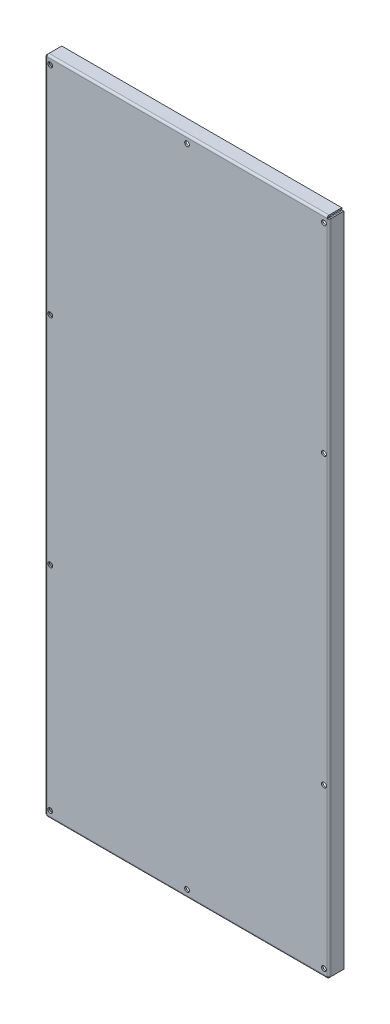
ISO-10303-21;
HEADER;
FILE_DESCRIPTION(('STEP AP214'),'2;1');
FILE_NAME('part.step','',(''),(''),'','','');
FILE_SCHEMA(('AUTOMOTIVE_DESIGN { 1 0 10303 214 1 1 1 1 }'));
ENDSEC;
DATA;
#1=APPLICATION_CONTEXT('core data for automotive mechanical design processes');
#2=APPLICATION_PROTOCOL_DEFINITION('international standard','automotive_design',2000,#1);
#3=PRODUCT_CONTEXT('',#1,'mechanical');
#4=PRODUCT('Part','Part','',(#3));
#5=PRODUCT_RELATED_PRODUCT_CATEGORY('part','',(#4));
#6=PRODUCT_DEFINITION_FORMATION('','',#4);
#7=PRODUCT_DEFINITION_CONTEXT('part definition',#1,'design');
#8=PRODUCT_DEFINITION('design','',#6,#7);
#9=PRODUCT_DEFINITION_SHAPE('','',#8);
#10=(LENGTH_UNIT() NAMED_UNIT(*) SI_UNIT(.MILLI.,.METRE.));
#11=(NAMED_UNIT(*) PLANE_ANGLE_UNIT() SI_UNIT($,.RADIAN.));
#12=(NAMED_UNIT(*) SI_UNIT($,.STERADIAN.) SOLID_ANGLE_UNIT());
#13=UNCERTAINTY_MEASURE_WITH_UNIT(LENGTH_MEASURE(1.E-05),#10,'distance_accuracy_value','');
#14=(GEOMETRIC_REPRESENTATION_CONTEXT(3) GLOBAL_UNCERTAINTY_ASSIGNED_CONTEXT((#13)) GLOBAL_UNIT_ASSIGNED_CONTEXT((#10,
#11,#12)) REPRESENTATION_CONTEXT('',''));
#15=CARTESIAN_POINT('',(0.,0.,0.));
#16=DIRECTION('',(0.,0.,1.));
#17=DIRECTION('',(1.,0.,0.));
#18=AXIS2_PLACEMENT_3D('',#15,#16,#17);
#19=CARTESIAN_POINT('',(0.,0.,-2.));
#20=DIRECTION('',(0.,0.,1.));
#21=DIRECTION('',(1.,0.,0.));
#22=AXIS2_PLACEMENT_3D('',#19,#20,#21);
#23=PLANE('',#22);
#24=CARTESIAN_POINT('',(-461.,743.080974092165,-2.));
#25=DIRECTION('',(0.,0.,1.));
#26=DIRECTION('',(1.,0.,0.));
#27=AXIS2_PLACEMENT_3D('',#24,#25,#26);
#28=CIRCLE('',#27,3.25);
#29=CARTESIAN_POINT('',(-457.75,743.080974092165,-2.));
#30=VERTEX_POINT('',#29);
#31=EDGE_CURVE('E1110',#30,#30,#28,.T.);
#32=ORIENTED_EDGE('',*,*,#31,.T.);
#33=EDGE_LOOP('',(#32));
#34=FACE_BOUND('',#33,.T.);
#35=CARTESIAN_POINT('',(-461.,448.080974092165,-2.));
#36=DIRECTION('',(0.,0.,1.));
#37=DIRECTION('',(1.,0.,0.));
#38=AXIS2_PLACEMENT_3D('',#35,#36,#37);
#39=CIRCLE('',#38,3.25);
#40=CARTESIAN_POINT('',(-457.75,448.080974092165,-2.));
#41=VERTEX_POINT('',#40);
#42=EDGE_CURVE('E1104',#41,#41,#39,.T.);
#43=ORIENTED_EDGE('',*,*,#42,.T.);
#44=EDGE_LOOP('',(#43));
#45=FACE_BOUND('',#44,.T.);
#46=CARTESIAN_POINT('',(-461.,153.080974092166,-2.));
#47=DIRECTION('',(0.,0.,1.));
#48=DIRECTION('',(1.,0.,0.));
#49=AXIS2_PLACEMENT_3D('',#46,#47,#48);
#50=CIRCLE('',#49,3.25);
#51=CARTESIAN_POINT('',(-457.75,153.080974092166,-2.));
#52=VERTEX_POINT('',#51);
#53=EDGE_CURVE('E1098',#52,#52,#50,.T.);
#54=ORIENTED_EDGE('',*,*,#53,.T.);
#55=EDGE_LOOP('',(#54));
#56=FACE_BOUND('',#55,.T.);
#57=CARTESIAN_POINT('',(-461.,-136.919025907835,-2.));
#58=DIRECTION('',(0.,0.,1.));
#59=DIRECTION('',(1.,0.,0.));
#60=AXIS2_PLACEMENT_3D('',#57,#58,#59);
#61=CIRCLE('',#60,3.25);
#62=CARTESIAN_POINT('',(-457.75,-136.919025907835,-2.));
#63=VERTEX_POINT('',#62);
#64=EDGE_CURVE('E1092',#63,#63,#61,.T.);
#65=ORIENTED_EDGE('',*,*,#64,.T.);
#66=EDGE_LOOP('',(#65));
#67=FACE_BOUND('',#66,.T.);
#68=CARTESIAN_POINT('',(-274.5,-136.919025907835,-2.));
#69=DIRECTION('',(0.,0.,1.));
#70=DIRECTION('',(1.,0.,0.));
#71=AXIS2_PLACEMENT_3D('',#68,#69,#70);
#72=CIRCLE('',#71,3.25);
#73=CARTESIAN_POINT('',(-271.25,-136.919025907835,-2.));
#74=VERTEX_POINT('',#73);
#75=EDGE_CURVE('E1086',#74,#74,#72,.T.);
#76=ORIENTED_EDGE('',*,*,#75,.T.);
#77=EDGE_LOOP('',(#76));
#78=FACE_BOUND('',#77,.T.);
#79=CARTESIAN_POINT('',(-88.,-136.919025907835,-2.));
#80=DIRECTION('',(0.,0.,1.));
#81=DIRECTION('',(1.,0.,0.));
#82=AXIS2_PLACEMENT_3D('',#79,#80,#81);
#83=CIRCLE('',#82,3.25);
#84=CARTESIAN_POINT('',(-84.75,-136.919025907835,-2.));
#85=VERTEX_POINT('',#84);
#86=EDGE_CURVE('E1080',#85,#85,#83,.T.);
#87=ORIENTED_EDGE('',*,*,#86,.T.);
#88=EDGE_LOOP('',(#87));
#89=FACE_BOUND('',#88,.T.);
#90=CARTESIAN_POINT('',(-88.,79.7154373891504,-2.));
#91=DIRECTION('',(0.,0.,1.));
#92=DIRECTION('',(1.,0.,0.));
#93=AXIS2_PLACEMENT_3D('',#90,#91,#92);
#94=CIRCLE('',#93,3.25);
#95=CARTESIAN_POINT('',(-84.75,79.7154373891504,-2.));
#96=VERTEX_POINT('',#95);
#97=EDGE_CURVE('E1074',#96,#96,#94,.T.);
#98=ORIENTED_EDGE('',*,*,#97,.T.);
#99=EDGE_LOOP('',(#98));
#100=FACE_BOUND('',#99,.T.);
#101=CARTESIAN_POINT('',(-88.,470.915196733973,-2.));
#102=DIRECTION('',(0.,0.,1.));
#103=DIRECTION('',(1.,0.,0.));
#104=AXIS2_PLACEMENT_3D('',#101,#102,#103);
#105=CIRCLE('',#104,3.25);
#106=CARTESIAN_POINT('',(-84.75,470.915196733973,-2.));
#107=VERTEX_POINT('',#106);
#108=EDGE_CURVE('E1068',#107,#107,#105,.T.);
#109=ORIENTED_EDGE('',*,*,#108,.T.);
#110=EDGE_LOOP('',(#109));
#111=FACE_BOUND('',#110,.T.);
#112=CARTESIAN_POINT('',(-88.,743.080974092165,-2.));
#113=DIRECTION('',(0.,0.,1.));
#114=DIRECTION('',(1.,0.,0.));
#115=AXIS2_PLACEMENT_3D('',#112,#113,#114);
#116=CIRCLE('',#115,3.25);
#117=CARTESIAN_POINT('',(-84.75,743.080974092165,-2.));
#118=VERTEX_POINT('',#117);
#119=EDGE_CURVE('E1062',#118,#118,#116,.T.);
#120=ORIENTED_EDGE('',*,*,#119,.T.);
#121=EDGE_LOOP('',(#120));
#122=FACE_BOUND('',#121,.T.);
#123=CARTESIAN_POINT('',(-274.5,743.080974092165,-2.));
#124=DIRECTION('',(0.,0.,1.));
#125=DIRECTION('',(1.,0.,0.));
#126=AXIS2_PLACEMENT_3D('',#123,#124,#125);
#127=CIRCLE('',#126,3.25);
#128=CARTESIAN_POINT('',(-271.25,743.080974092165,-2.));
#129=VERTEX_POINT('',#128);
#130=EDGE_CURVE('E1026',#129,#129,#127,.T.);
#131=ORIENTED_EDGE('',*,*,#130,.T.);
#132=EDGE_LOOP('',(#131));
#133=FACE_BOUND('',#132,.T.);
#134=DIRECTION('',(-1.,0.,0.));
#135=VECTOR('',#134,1.);
#136=CARTESIAN_POINT('',(-465.292893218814,-144.182425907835,-2.));
#137=LINE('',#136,#135);
#138=CARTESIAN_POINT('',(-465.2634,-144.182425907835,-2.));
#139=VERTEX_POINT('',#138);
#140=CARTESIAN_POINT('',(-83.7366,-144.182425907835,-2.));
#141=VERTEX_POINT('',#140);
#142=EDGE_CURVE('E213',#139,#141,#137,.F.);
#143=ORIENTED_EDGE('',*,*,#142,.F.);
#144=DIRECTION('',(0.,1.,0.));
#145=VECTOR('',#144,1.);
#146=CARTESIAN_POINT('',(-465.2634,750.373867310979,-2.00000000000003));
#147=LINE('',#146,#145);
#148=CARTESIAN_POINT('',(-465.2634,750.344374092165,-2.));
#149=VERTEX_POINT('',#148);
#150=EDGE_CURVE('E220',#149,#139,#147,.F.);
#151=ORIENTED_EDGE('',*,*,#150,.F.);
#152=DIRECTION('',(1.,0.,0.));
#153=VECTOR('',#152,1.);
#154=CARTESIAN_POINT('',(-83.707106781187,750.344374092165,-2.));
#155=LINE('',#154,#153);
#156=CARTESIAN_POINT('',(-83.7366,750.344374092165,-2.00000000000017));
#157=VERTEX_POINT('',#156);
#158=EDGE_CURVE('E374',#157,#149,#155,.F.);
#159=ORIENTED_EDGE('',*,*,#158,.F.);
#160=DIRECTION('',(0.,-1.,0.));
#161=VECTOR('',#160,1.);
#162=CARTESIAN_POINT('',(-83.7366,-144.211919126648,-1.99999999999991));
#163=LINE('',#162,#161);
#164=EDGE_CURVE('E232',#141,#157,#163,.F.);
#165=ORIENTED_EDGE('',*,*,#164,.F.);
#166=EDGE_LOOP('',(#143,#151,#159,#165));
#167=FACE_BOUND('',#166,.T.);
#168=ADVANCED_FACE('F16',(#34,#45,#56,#67,#78,#89,#100,#111,#122,#133,#167),#23,.F.);
#169=CARTESIAN_POINT('',(0.,0.,0.));
#170=DIRECTION('',(0.,0.,1.));
#171=DIRECTION('',(1.,0.,0.));
#172=AXIS2_PLACEMENT_3D('',#169,#170,#171);
#173=PLANE('',#172);
#174=CARTESIAN_POINT('',(-461.,743.080974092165,0.));
#175=DIRECTION('',(0.,0.,1.));
#176=DIRECTION('',(1.,0.,0.));
#177=AXIS2_PLACEMENT_3D('',#174,#175,#176);
#178=CIRCLE('',#177,3.25);
#179=CARTESIAN_POINT('',(-457.75,743.080974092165,0.));
#180=VERTEX_POINT('',#179);
#181=EDGE_CURVE('E1112',#180,#180,#178,.T.);
#182=ORIENTED_EDGE('',*,*,#181,.F.);
#183=EDGE_LOOP('',(#182));
#184=FACE_BOUND('',#183,.T.);
#185=CARTESIAN_POINT('',(-461.,448.080974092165,0.));
#186=DIRECTION('',(0.,0.,1.));
#187=DIRECTION('',(1.,0.,0.));
#188=AXIS2_PLACEMENT_3D('',#185,#186,#187);
#189=CIRCLE('',#188,3.25);
#190=CARTESIAN_POINT('',(-457.75,448.080974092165,0.));
#191=VERTEX_POINT('',#190);
#192=EDGE_CURVE('E1107',#191,#191,#189,.T.);
#193=ORIENTED_EDGE('',*,*,#192,.F.);
#194=EDGE_LOOP('',(#193));
#195=FACE_BOUND('',#194,.T.);
#196=CARTESIAN_POINT('',(-461.,153.080974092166,0.));
#197=DIRECTION('',(0.,0.,1.));
#198=DIRECTION('',(1.,0.,0.));
#199=AXIS2_PLACEMENT_3D('',#196,#197,#198);
#200=CIRCLE('',#199,3.25);
#201=CARTESIAN_POINT('',(-457.75,153.080974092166,0.));
#202=VERTEX_POINT('',#201);
#203=EDGE_CURVE('E1101',#202,#202,#200,.T.);
#204=ORIENTED_EDGE('',*,*,#203,.F.);
#205=EDGE_LOOP('',(#204));
#206=FACE_BOUND('',#205,.T.);
#207=CARTESIAN_POINT('',(-461.,-136.919025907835,0.));
#208=DIRECTION('',(0.,0.,1.));
#209=DIRECTION('',(1.,0.,0.));
#210=AXIS2_PLACEMENT_3D('',#207,#208,#209);
#211=CIRCLE('',#210,3.25);
#212=CARTESIAN_POINT('',(-457.75,-136.919025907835,0.));
#213=VERTEX_POINT('',#212);
#214=EDGE_CURVE('E1095',#213,#213,#211,.T.);
#215=ORIENTED_EDGE('',*,*,#214,.F.);
#216=EDGE_LOOP('',(#215));
#217=FACE_BOUND('',#216,.T.);
#218=CARTESIAN_POINT('',(-274.5,-136.919025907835,0.));
#219=DIRECTION('',(0.,0.,1.));
#220=DIRECTION('',(1.,0.,0.));
#221=AXIS2_PLACEMENT_3D('',#218,#219,#220);
#222=CIRCLE('',#221,3.25);
#223=CARTESIAN_POINT('',(-271.25,-136.919025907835,0.));
#224=VERTEX_POINT('',#223);
#225=EDGE_CURVE('E1089',#224,#224,#222,.T.);
#226=ORIENTED_EDGE('',*,*,#225,.F.);
#227=EDGE_LOOP('',(#226));
#228=FACE_BOUND('',#227,.T.);
#229=CARTESIAN_POINT('',(-88.,-136.919025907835,0.));
#230=DIRECTION('',(0.,0.,1.));
#231=DIRECTION('',(1.,0.,0.));
#232=AXIS2_PLACEMENT_3D('',#229,#230,#231);
#233=CIRCLE('',#232,3.25);
#234=CARTESIAN_POINT('',(-84.75,-136.919025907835,0.));
#235=VERTEX_POINT('',#234);
#236=EDGE_CURVE('E1083',#235,#235,#233,.T.);
#237=ORIENTED_EDGE('',*,*,#236,.F.);
#238=EDGE_LOOP('',(#237));
#239=FACE_BOUND('',#238,.T.);
#240=CARTESIAN_POINT('',(-88.,79.7154373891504,0.));
#241=DIRECTION('',(0.,0.,1.));
#242=DIRECTION('',(1.,0.,0.));
#243=AXIS2_PLACEMENT_3D('',#240,#241,#242);
#244=CIRCLE('',#243,3.25);
#245=CARTESIAN_POINT('',(-84.75,79.7154373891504,0.));
#246=VERTEX_POINT('',#245);
#247=EDGE_CURVE('E1077',#246,#246,#244,.T.);
#248=ORIENTED_EDGE('',*,*,#247,.F.);
#249=EDGE_LOOP('',(#248));
#250=FACE_BOUND('',#249,.T.);
#251=CARTESIAN_POINT('',(-88.,470.915196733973,0.));
#252=DIRECTION('',(0.,0.,1.));
#253=DIRECTION('',(1.,0.,0.));
#254=AXIS2_PLACEMENT_3D('',#251,#252,#253);
#255=CIRCLE('',#254,3.25);
#256=CARTESIAN_POINT('',(-84.75,470.915196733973,0.));
#257=VERTEX_POINT('',#256);
#258=EDGE_CURVE('E1071',#257,#257,#255,.T.);
#259=ORIENTED_EDGE('',*,*,#258,.F.);
#260=EDGE_LOOP('',(#259));
#261=FACE_BOUND('',#260,.T.);
#262=CARTESIAN_POINT('',(-88.,743.080974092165,0.));
#263=DIRECTION('',(0.,0.,1.));
#264=DIRECTION('',(1.,0.,0.));
#265=AXIS2_PLACEMENT_3D('',#262,#263,#264);
#266=CIRCLE('',#265,3.25);
#267=CARTESIAN_POINT('',(-84.75,743.080974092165,0.));
#268=VERTEX_POINT('',#267);
#269=EDGE_CURVE('E1065',#268,#268,#266,.T.);
#270=ORIENTED_EDGE('',*,*,#269,.F.);
#271=EDGE_LOOP('',(#270));
#272=FACE_BOUND('',#271,.T.);
#273=CARTESIAN_POINT('',(-274.5,743.080974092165,0.));
#274=DIRECTION('',(0.,0.,1.));
#275=DIRECTION('',(1.,0.,0.));
#276=AXIS2_PLACEMENT_3D('',#273,#274,#275);
#277=CIRCLE('',#276,3.25);
#278=CARTESIAN_POINT('',(-271.25,743.080974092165,0.));
#279=VERTEX_POINT('',#278);
#280=EDGE_CURVE('E1059',#279,#279,#277,.T.);
#281=ORIENTED_EDGE('',*,*,#280,.F.);
#282=EDGE_LOOP('',(#281));
#283=FACE_BOUND('',#282,.T.);
#284=DIRECTION('',(0.,1.,0.));
#285=VECTOR('',#284,1.);
#286=CARTESIAN_POINT('',(-465.2634,750.373867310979,0.));
#287=LINE('',#286,#285);
#288=CARTESIAN_POINT('',(-465.2634,750.344374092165,0.));
#289=VERTEX_POINT('',#288);
#290=CARTESIAN_POINT('',(-465.2634,-144.182425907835,0.));
#291=VERTEX_POINT('',#290);
#292=EDGE_CURVE('E449',#289,#291,#287,.F.);
#293=ORIENTED_EDGE('',*,*,#292,.T.);
#294=DIRECTION('',(-1.,0.,0.));
#295=VECTOR('',#294,1.);
#296=CARTESIAN_POINT('',(-465.292893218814,-144.182425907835,0.));
#297=LINE('',#296,#295);
#298=CARTESIAN_POINT('',(-83.7366,-144.182425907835,0.));
#299=VERTEX_POINT('',#298);
#300=EDGE_CURVE('E182',#291,#299,#297,.F.);
#301=ORIENTED_EDGE('',*,*,#300,.T.);
#302=DIRECTION('',(0.,-1.,0.));
#303=VECTOR('',#302,1.);
#304=CARTESIAN_POINT('',(-83.7366,-144.211919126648,0.));
#305=LINE('',#304,#303);
#306=CARTESIAN_POINT('',(-83.7366,750.344374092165,0.));
#307=VERTEX_POINT('',#306);
#308=EDGE_CURVE('E307',#299,#307,#305,.F.);
#309=ORIENTED_EDGE('',*,*,#308,.T.);
#310=DIRECTION('',(1.,0.,0.));
#311=VECTOR('',#310,1.);
#312=CARTESIAN_POINT('',(-83.707106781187,750.344374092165,0.));
#313=LINE('',#312,#311);
#314=EDGE_CURVE('E381',#307,#289,#313,.F.);
#315=ORIENTED_EDGE('',*,*,#314,.T.);
#316=EDGE_LOOP('',(#293,#301,#309,#315));
#317=FACE_BOUND('',#316,.T.);
#318=ADVANCED_FACE('F18',(#184,#195,#206,#217,#228,#239,#250,#261,#272,#283,#317),#173,.T.);
#319=CARTESIAN_POINT('',(-465.2634,-144.182425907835,0.0199999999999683));
#320=CARTESIAN_POINT('',(-465.624303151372,-144.18488411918,0.0199999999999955));
#321=CARTESIAN_POINT('',(-465.984934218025,-144.187341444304,-0.0517469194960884));
#322=CARTESIAN_POINT('',(-466.651676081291,-144.192256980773,-0.327920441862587));
#323=CARTESIAN_POINT('',(-466.957459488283,-144.194714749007,-0.532238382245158));
#324=CARTESIAN_POINT('',(-467.467761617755,-144.199630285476,-1.04254051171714));
#325=CARTESIAN_POINT('',(-467.672079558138,-144.20208805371,-1.34832391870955));
#326=CARTESIAN_POINT('',(-467.948253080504,-144.207003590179,-2.01506578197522));
#327=CARTESIAN_POINT('',(-468.02,-144.209460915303,-2.37569684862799));
#328=CARTESIAN_POINT('',(-468.02,-144.211919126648,-2.73660000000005));
#329=CARTESIAN_POINT('',(-465.2634,-144.182425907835,0.));
#330=CARTESIAN_POINT('',(-465.621684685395,-144.184884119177,0.));
#331=CARTESIAN_POINT('',(-465.979699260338,-144.187341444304,-0.0712263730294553));
#332=CARTESIAN_POINT('',(-466.641603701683,-144.192256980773,-0.345396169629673));
#333=CARTESIAN_POINT('',(-466.945168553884,-144.194714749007,-0.548231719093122));
#334=CARTESIAN_POINT('',(-467.451768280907,-144.199630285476,-1.05483144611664));
#335=CARTESIAN_POINT('',(-467.654603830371,-144.20208805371,-1.35839629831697));
#336=CARTESIAN_POINT('',(-467.928773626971,-144.207003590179,-2.02030073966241));
#337=CARTESIAN_POINT('',(-468.,-144.209460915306,-2.37831531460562));
#338=CARTESIAN_POINT('',(-468.,-144.211919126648,-2.73660000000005));
#339=CARTESIAN_POINT('',(-465.2634,-144.182425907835,-2.00000000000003));
#340=CARTESIAN_POINT('',(-465.359838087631,-144.18488411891,-2.00000000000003));
#341=CARTESIAN_POINT('',(-465.45620349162,-144.187341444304,-2.01917172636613));
#342=CARTESIAN_POINT('',(-465.634365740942,-144.192256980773,-2.09296894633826));
#343=CARTESIAN_POINT('',(-465.716075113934,-144.194714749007,-2.1475654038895));
#344=CARTESIAN_POINT('',(-465.852434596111,-144.199630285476,-2.28392488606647));
#345=CARTESIAN_POINT('',(-465.907031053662,-144.20208805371,-2.36563425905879));
#346=CARTESIAN_POINT('',(-465.980828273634,-144.207003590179,-2.54379650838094));
#347=CARTESIAN_POINT('',(-466.,-144.209460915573,-2.64016191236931));
#348=CARTESIAN_POINT('',(-466.,-144.211919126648,-2.7366));
#349=CARTESIAN_POINT('',(-465.2634,-144.182425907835,-2.02020000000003));
#350=CARTESIAN_POINT('',(-465.357193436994,-144.184884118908,-2.02020000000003));
#351=CARTESIAN_POINT('',(-465.450916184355,-144.187341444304,-2.03884597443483));
#352=CARTESIAN_POINT('',(-465.624192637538,-144.192256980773,-2.11061943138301));
#353=CARTESIAN_POINT('',(-465.703661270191,-144.194714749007,-2.16371867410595));
#354=CARTESIAN_POINT('',(-465.836281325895,-144.199630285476,-2.29633872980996));
#355=CARTESIAN_POINT('',(-465.889380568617,-144.20208805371,-2.37580736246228));
#356=CARTESIAN_POINT('',(-465.961154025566,-144.207003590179,-2.54908381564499));
#357=CARTESIAN_POINT('',(-465.9798,-144.209460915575,-2.64280656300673));
#358=CARTESIAN_POINT('',(-465.9798,-144.211919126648,-2.7366));
#359=B_SPLINE_SURFACE_WITH_KNOTS('',1,3,((#319,#320,#321,#322,#323,#324,#325,#326,#327,#328),
(#329,#330,#331,#332,#333,#334,#335,#336,#337,#338),(#339,#340,#341,#342,#343,#344,#345,#346,
#347,#348),(#349,#350,#351,#352,#353,#354,#355,#356,#357,#358)),.UNSPECIFIED.,.F.,.F.,.F.,(2,1,
1,2),(4,2,2,2,4),(-0.01,0.,1.,1.0101),(0.,0.25,0.5,0.75,1.),.UNSPECIFIED.);
#360=DIRECTION('',(1.,0.,0.));
#361=VECTOR('',#360,1.);
#362=CARTESIAN_POINT('',(-466.,-144.211919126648,-2.7366));
#363=LINE('',#362,#361);
#364=CARTESIAN_POINT('',(-468.,-144.211919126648,-2.73659999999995));
#365=VERTEX_POINT('',#364);
#366=CARTESIAN_POINT('',(-466.,-144.211919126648,-2.73659999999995));
#367=VERTEX_POINT('',#366);
#368=EDGE_CURVE('E45',#365,#367,#363,.T.);
#369=CARTESIAN_POINT('',(-465.2634,-144.182425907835,-2.00000000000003));
#370=CARTESIAN_POINT('',(-465.275452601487,-144.182733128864,-1.99999974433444));
#371=CARTESIAN_POINT('',(-465.287505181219,-144.183040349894,-2.00029580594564));
#372=CARTESIAN_POINT('',(-465.3115813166,-144.183654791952,-2.00147872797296));
#373=CARTESIAN_POINT('',(-465.323604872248,-144.183962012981,-2.00236558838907));
#374=CARTESIAN_POINT('',(-465.347593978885,-144.18457645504,-2.00472827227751));
#375=CARTESIAN_POINT('',(-465.359559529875,-144.184883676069,-2.00620409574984));
#376=CARTESIAN_POINT('',(-465.383403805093,-144.185498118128,-2.0097410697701));
#377=CARTESIAN_POINT('',(-465.395282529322,-144.185805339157,-2.01180222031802));
#378=CARTESIAN_POINT('',(-465.418924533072,-144.186419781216,-2.01650490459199));
#379=CARTESIAN_POINT('',(-465.430687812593,-144.186727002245,-2.01914643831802));
#380=CARTESIAN_POINT('',(-465.45407058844,-144.187341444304,-2.02500351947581));
#381=CARTESIAN_POINT('',(-465.465690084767,-144.187648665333,-2.02821906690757));
#382=CARTESIAN_POINT('',(-465.488757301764,-144.188263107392,-2.03521643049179));
#383=CARTESIAN_POINT('',(-465.500205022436,-144.188570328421,-2.03899824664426));
#384=CARTESIAN_POINT('',(-465.522901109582,-144.18918477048,-2.04711903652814));
#385=CARTESIAN_POINT('',(-465.534149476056,-144.189491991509,-2.05145801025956));
#386=CARTESIAN_POINT('',(-465.556419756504,-144.190106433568,-2.06068266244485));
#387=CARTESIAN_POINT('',(-465.567441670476,-144.190413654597,-2.06556834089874));
#388=CARTESIAN_POINT('',(-465.589232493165,-144.191028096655,-2.07587463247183));
#389=CARTESIAN_POINT('',(-465.600001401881,-144.191335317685,-2.08129524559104));
#390=CARTESIAN_POINT('',(-465.621260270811,-144.191949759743,-2.09265834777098));
#391=CARTESIAN_POINT('',(-465.631750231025,-144.192256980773,-2.09860083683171));
#392=CARTESIAN_POINT('',(-465.65242593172,-144.192871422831,-2.1109933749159));
#393=CARTESIAN_POINT('',(-465.6626116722,-144.193178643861,-2.11744342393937));
#394=CARTESIAN_POINT('',(-465.682654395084,-144.193793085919,-2.13083554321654));
#395=CARTESIAN_POINT('',(-465.692511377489,-144.194100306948,-2.13777761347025));
#396=CARTESIAN_POINT('',(-465.711872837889,-144.194714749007,-2.15213705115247));
#397=CARTESIAN_POINT('',(-465.721377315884,-144.195021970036,-2.15955441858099));
#398=CARTESIAN_POINT('',(-465.740010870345,-144.195636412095,-2.17484658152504));
#399=CARTESIAN_POINT('',(-465.749139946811,-144.195943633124,-2.18272137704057));
#400=CARTESIAN_POINT('',(-465.767000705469,-144.196558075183,-2.1989094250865));
#401=CARTESIAN_POINT('',(-465.775732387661,-144.196865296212,-2.2072226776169));
#402=CARTESIAN_POINT('',(-465.792777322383,-144.197479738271,-2.22426761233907));
#403=CARTESIAN_POINT('',(-465.801090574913,-144.1977869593,-2.23299929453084));
#404=CARTESIAN_POINT('',(-465.817278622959,-144.198401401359,-2.25086005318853));
#405=CARTESIAN_POINT('',(-465.825153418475,-144.198708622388,-2.25998912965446));
#406=CARTESIAN_POINT('',(-465.840445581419,-144.199323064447,-2.27862268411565));
#407=CARTESIAN_POINT('',(-465.847862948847,-144.199630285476,-2.28812716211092));
#408=CARTESIAN_POINT('',(-465.86222238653,-144.200244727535,-2.30748862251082));
#409=CARTESIAN_POINT('',(-465.869164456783,-144.200551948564,-2.31734560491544));
#410=CARTESIAN_POINT('',(-465.882556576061,-144.201166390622,-2.33738832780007));
#411=CARTESIAN_POINT('',(-465.889006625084,-144.201473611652,-2.34757406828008));
#412=CARTESIAN_POINT('',(-465.901399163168,-144.20208805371,-2.36824976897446));
#413=CARTESIAN_POINT('',(-465.907341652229,-144.20239527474,-2.37873972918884));
#414=CARTESIAN_POINT('',(-465.918704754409,-144.203009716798,-2.39999859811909));
#415=CARTESIAN_POINT('',(-465.924125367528,-144.203316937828,-2.41076750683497));
#416=CARTESIAN_POINT('',(-465.934431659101,-144.203931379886,-2.43255832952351));
#417=CARTESIAN_POINT('',(-465.939317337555,-144.204238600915,-2.44358024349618));
#418=CARTESIAN_POINT('',(-465.94854198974,-144.204853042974,-2.46585052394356));
#419=CARTESIAN_POINT('',(-465.952880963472,-144.205160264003,-2.47709889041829));
#420=CARTESIAN_POINT('',(-465.961001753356,-144.205774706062,-2.49979497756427));
#421=CARTESIAN_POINT('',(-465.964783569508,-144.206081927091,-2.51124269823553));
#422=CARTESIAN_POINT('',(-465.971780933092,-144.20669636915,-2.53430991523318));
#423=CARTESIAN_POINT('',(-465.974996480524,-144.207003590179,-2.54592941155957));
#424=CARTESIAN_POINT('',(-465.980853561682,-144.207618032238,-2.56931218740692));
#425=CARTESIAN_POINT('',(-465.983495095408,-144.207925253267,-2.58107546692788));
#426=CARTESIAN_POINT('',(-465.988197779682,-144.208539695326,-2.60471747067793));
#427=CARTESIAN_POINT('',(-465.99025893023,-144.208846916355,-2.61659619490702));
#428=CARTESIAN_POINT('',(-465.99379590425,-144.209461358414,-2.64044047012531));
#429=CARTESIAN_POINT('',(-465.995271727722,-144.209768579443,-2.65240602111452));
#430=CARTESIAN_POINT('',(-465.997634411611,-144.210383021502,-2.67639512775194));
#431=CARTESIAN_POINT('',(-465.998521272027,-144.210690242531,-2.68841868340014));
#432=CARTESIAN_POINT('',(-465.999704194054,-144.211304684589,-2.71249481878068));
#433=CARTESIAN_POINT('',(-466.000000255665,-144.211611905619,-2.72454739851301));
#434=CARTESIAN_POINT('',(-466.,-144.211919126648,-2.73659999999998));
#435=B_SPLINE_CURVE_WITH_KNOTS('',3,(#369,#370,#371,#372,#373,#374,#375,#376,#377,#378,#379,
#380,#381,#382,#383,#384,#385,#386,#387,#388,#389,#390,#391,#392,#393,#394,#395,#396,#397,#398,
#399,#400,#401,#402,#403,#404,#405,#406,#407,#408,#409,#410,#411,#412,#413,#414,#415,#416,#417,
#418,#419,#420,#421,#422,#423,#424,#425,#426,#427,#428,#429,#430,#431,#432,#433,#434),
.UNSPECIFIED.,.F.,.F.,(4,2,2,2,2,2,2,2,2,2,2,2,2,2,2,2,2,2,2,2,2,2,2,2,2,2,2,2,2,2,2,2,4),(0.,
0.0361658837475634,0.0723317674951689,0.108497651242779,0.14466353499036,0.180829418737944,
0.216995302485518,0.253161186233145,0.289327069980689,0.325492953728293,0.361658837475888,
0.397824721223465,0.433990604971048,0.47015648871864,0.506322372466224,0.542488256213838,
0.578654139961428,0.614820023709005,0.650985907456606,0.687151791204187,0.723317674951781,
0.759483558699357,0.79564944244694,0.83181532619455,0.867981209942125,0.904147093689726,
0.940312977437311,0.976478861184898,1.01264474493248,1.04881062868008,1.08497651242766,
1.12114239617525,1.15730827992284),.UNSPECIFIED.);
#436=EDGE_CURVE('E222',#139,#367,#435,.T.);
#437=DIRECTION('',(0.,0.,1.));
#438=VECTOR('',#437,1.);
#439=CARTESIAN_POINT('',(-465.2634,-144.182425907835,-2.00000000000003));
#440=LINE('',#439,#438);
#441=EDGE_CURVE('E11',#139,#291,#440,.T.);
#442=CARTESIAN_POINT('',(-465.2634,-144.182425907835,0.));
#443=CARTESIAN_POINT('',(-465.308177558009,-144.182733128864,9.49843109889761E-07));
#444=CARTESIAN_POINT('',(-465.352955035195,-144.183040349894,-0.00109897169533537));
#445=CARTESIAN_POINT('',(-465.442402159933,-144.183654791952,-0.00549373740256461));
#446=CARTESIAN_POINT('',(-465.487071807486,-144.183962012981,-0.00878858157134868));
#447=CARTESIAN_POINT('',(-465.576195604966,-144.18457645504,-0.0175663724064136));
#448=CARTESIAN_POINT('',(-465.620649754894,-144.184883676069,-0.023049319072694));
#449=CARTESIAN_POINT('',(-465.709235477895,-144.185498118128,-0.0361898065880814));
#450=CARTESIAN_POINT('',(-465.753367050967,-144.185805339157,-0.0438473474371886));
#451=CARTESIAN_POINT('',(-465.841201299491,-144.186419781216,-0.0613186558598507));
#452=CARTESIAN_POINT('',(-465.884903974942,-144.186727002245,-0.0711324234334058));
#453=CARTESIAN_POINT('',(-465.971775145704,-144.187341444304,-0.0928925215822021));
#454=CARTESIAN_POINT('',(-466.014943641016,-144.187648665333,-0.104838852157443));
#455=CARTESIAN_POINT('',(-466.100642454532,-144.188263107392,-0.130835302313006));
#456=CARTESIAN_POINT('',(-466.143172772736,-144.188570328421,-0.144885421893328));
#457=CARTESIAN_POINT('',(-466.22749277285,-144.18918477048,-0.175055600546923));
#458=CARTESIAN_POINT('',(-466.26928245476,-144.189491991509,-0.191175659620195));
#459=CARTESIAN_POINT('',(-466.352020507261,-144.190106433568,-0.225446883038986));
#460=CARTESIAN_POINT('',(-466.392968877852,-144.190413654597,-0.243598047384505));
#461=CARTESIAN_POINT('',(-466.47392565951,-144.191028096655,-0.281887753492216));
#462=CARTESIAN_POINT('',(-466.513934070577,-144.191335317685,-0.302026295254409));
#463=CARTESIAN_POINT('',(-466.592914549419,-144.191949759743,-0.344242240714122));
#464=CARTESIAN_POINT('',(-466.631886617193,-144.192256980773,-0.366319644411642));
#465=CARTESIAN_POINT('',(-466.708700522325,-144.192871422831,-0.412360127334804));
#466=CARTESIAN_POINT('',(-466.746542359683,-144.193178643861,-0.436323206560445));
#467=CARTESIAN_POINT('',(-466.82100463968,-144.193793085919,-0.4860773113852));
#468=CARTESIAN_POINT('',(-466.85762508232,-144.194100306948,-0.511868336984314));
#469=CARTESIAN_POINT('',(-466.929556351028,-144.194714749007,-0.565216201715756));
#470=CARTESIAN_POINT('',(-466.964867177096,-144.195021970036,-0.592773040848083));
#471=CARTESIAN_POINT('',(-467.034094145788,-144.195636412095,-0.649586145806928));
#472=CARTESIAN_POINT('',(-467.068010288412,-144.195943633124,-0.678842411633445));
#473=CARTESIAN_POINT('',(-467.134366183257,-144.196558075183,-0.738983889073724));
#474=CARTESIAN_POINT('',(-467.166805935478,-144.196865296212,-0.769869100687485));
#475=CARTESIAN_POINT('',(-467.230130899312,-144.197479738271,-0.833194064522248));
#476=CARTESIAN_POINT('',(-467.261016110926,-144.1977869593,-0.865633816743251));
#477=CARTESIAN_POINT('',(-467.321157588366,-144.198401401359,-0.931989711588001));
#478=CARTESIAN_POINT('',(-467.350413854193,-144.198708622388,-0.96590585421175));
#479=CARTESIAN_POINT('',(-467.407226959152,-144.199323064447,-1.03513282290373));
#480=CARTESIAN_POINT('',(-467.434783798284,-144.199630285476,-1.07044364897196));
#481=CARTESIAN_POINT('',(-467.488131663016,-144.200244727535,-1.14237491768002));
#482=CARTESIAN_POINT('',(-467.513922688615,-144.200551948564,-1.17899536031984));
#483=CARTESIAN_POINT('',(-467.563676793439,-144.201166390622,-1.25345764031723));
#484=CARTESIAN_POINT('',(-467.587639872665,-144.201473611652,-1.2912994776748));
#485=CARTESIAN_POINT('',(-467.633680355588,-144.20208805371,-1.36811338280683));
#486=CARTESIAN_POINT('',(-467.655757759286,-144.20239527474,-1.40708545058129));
#487=CARTESIAN_POINT('',(-467.697973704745,-144.203009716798,-1.48606592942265));
#488=CARTESIAN_POINT('',(-467.718112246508,-144.203316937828,-1.52607434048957));
#489=CARTESIAN_POINT('',(-467.756401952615,-144.203931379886,-1.60703112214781));
#490=CARTESIAN_POINT('',(-467.774553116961,-144.204238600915,-1.64797949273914));
#491=CARTESIAN_POINT('',(-467.80882434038,-144.204853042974,-1.73071754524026));
#492=CARTESIAN_POINT('',(-467.824944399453,-144.205160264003,-1.77250722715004));
#493=CARTESIAN_POINT('',(-467.855114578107,-144.205774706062,-1.85682722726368));
#494=CARTESIAN_POINT('',(-467.869164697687,-144.206081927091,-1.89935754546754));
#495=CARTESIAN_POINT('',(-467.895161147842,-144.20669636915,-1.98505635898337));
#496=CARTESIAN_POINT('',(-467.907107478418,-144.207003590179,-2.02822485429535));
#497=CARTESIAN_POINT('',(-467.928867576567,-144.207618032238,-2.11509602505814));
#498=CARTESIAN_POINT('',(-467.93868134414,-144.207925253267,-2.15879870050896));
#499=CARTESIAN_POINT('',(-467.956152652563,-144.208539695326,-2.24663294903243));
#500=CARTESIAN_POINT('',(-467.963810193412,-144.208846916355,-2.29076452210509));
#501=CARTESIAN_POINT('',(-467.976950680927,-144.209461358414,-2.37935024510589));
#502=CARTESIAN_POINT('',(-467.982433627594,-144.209768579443,-2.42380439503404));
#503=CARTESIAN_POINT('',(-467.991211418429,-144.210383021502,-2.51292819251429));
#504=CARTESIAN_POINT('',(-467.994506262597,-144.210690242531,-2.55759784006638));
#505=CARTESIAN_POINT('',(-467.998901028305,-144.211304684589,-2.64704496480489));
#506=CARTESIAN_POINT('',(-468.000000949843,-144.211611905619,-2.6918224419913));
#507=CARTESIAN_POINT('',(-468.,-144.211919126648,-2.73660000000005));
#508=B_SPLINE_CURVE_WITH_KNOTS('',3,(#442,#443,#444,#445,#446,#447,#448,#449,#450,#451,#452,
#453,#454,#455,#456,#457,#458,#459,#460,#461,#462,#463,#464,#465,#466,#467,#468,#469,#470,#471,
#472,#473,#474,#475,#476,#477,#478,#479,#480,#481,#482,#483,#484,#485,#486,#487,#488,#489,#490,
#491,#492,#493,#494,#495,#496,#497,#498,#499,#500,#501,#502,#503,#504,#505,#506,#507),
.UNSPECIFIED.,.F.,.F.,(4,2,2,2,2,2,2,2,2,2,2,2,2,2,2,2,2,2,2,2,2,2,2,2,2,2,2,2,2,2,2,2,4),(0.,
0.134322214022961,0.268644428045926,0.402966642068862,0.537288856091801,0.671611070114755,
0.805933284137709,0.940255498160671,1.0745777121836,1.20889992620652,1.34322214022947,
1.47754435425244,1.61186656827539,1.74618878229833,1.88051099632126,2.01483321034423,
2.14915542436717,2.28347763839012,2.41779985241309,2.55212206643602,2.68644428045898,
2.82076649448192,2.95508870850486,3.08941092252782,3.22373313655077,3.35805535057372,
3.49237756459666,3.62669977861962,3.76102199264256,3.89534420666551,4.02966642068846,
4.1639886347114,4.29831084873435),.UNSPECIFIED.);
#509=EDGE_CURVE('E471',#291,#365,#508,.T.);
#510=ORIENTED_EDGE('',*,*,#368,.T.);
#511=ORIENTED_EDGE('',*,*,#436,.F.);
#512=ORIENTED_EDGE('',*,*,#441,.T.);
#513=ORIENTED_EDGE('',*,*,#509,.T.);
#514=EDGE_LOOP('',(#510,#511,#512,#513));
#515=FACE_BOUND('',#514,.T.);
#516=ADVANCED_FACE('F228',(#515),#359,.F.);
#517=CARTESIAN_POINT('',(-468.02,750.373867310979,-2.73659999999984));
#518=CARTESIAN_POINT('',(-468.02,750.371409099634,-2.37569684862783));
#519=CARTESIAN_POINT('',(-467.948253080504,750.36895177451,-2.01506578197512));
#520=CARTESIAN_POINT('',(-467.672079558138,750.364036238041,-1.34832391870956));
#521=CARTESIAN_POINT('',(-467.467761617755,750.361578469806,-1.04254051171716));
#522=CARTESIAN_POINT('',(-466.957459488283,750.356662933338,-0.532238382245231));
#523=CARTESIAN_POINT('',(-466.651676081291,750.354205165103,-0.327920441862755));
#524=CARTESIAN_POINT('',(-465.984934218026,750.349289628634,-0.0517469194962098));
#525=CARTESIAN_POINT('',(-465.624303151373,750.34683230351,0.0199999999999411));
#526=CARTESIAN_POINT('',(-465.2634,750.344374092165,0.0199999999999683));
#527=CARTESIAN_POINT('',(-468.,750.373867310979,-2.73659999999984));
#528=CARTESIAN_POINT('',(-468.,750.371409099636,-2.37831531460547));
#529=CARTESIAN_POINT('',(-467.928773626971,750.36895177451,-2.02030073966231));
#530=CARTESIAN_POINT('',(-467.654603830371,750.364036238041,-1.35839629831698));
#531=CARTESIAN_POINT('',(-467.451768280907,750.361578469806,-1.05483144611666));
#532=CARTESIAN_POINT('',(-466.945168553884,750.356662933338,-0.548231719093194));
#533=CARTESIAN_POINT('',(-466.641603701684,750.354205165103,-0.345396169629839));
#534=CARTESIAN_POINT('',(-465.979699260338,750.349289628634,-0.0712263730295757));
#535=CARTESIAN_POINT('',(-465.621684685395,750.346832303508,0.));
#536=CARTESIAN_POINT('',(-465.2634,750.344374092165,0.));
#537=CARTESIAN_POINT('',(-466.,750.373867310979,-2.73659999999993));
#538=CARTESIAN_POINT('',(-466.,750.371409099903,-2.64016191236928));
#539=CARTESIAN_POINT('',(-465.980828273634,750.36895177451,-2.54379650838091));
#540=CARTESIAN_POINT('',(-465.907031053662,750.364036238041,-2.36563425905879));
#541=CARTESIAN_POINT('',(-465.852434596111,750.361578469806,-2.28392488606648));
#542=CARTESIAN_POINT('',(-465.716075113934,750.356662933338,-2.14756540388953));
#543=CARTESIAN_POINT('',(-465.634365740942,750.354205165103,-2.09296894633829));
#544=CARTESIAN_POINT('',(-465.45620349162,750.349289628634,-2.01917172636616));
#545=CARTESIAN_POINT('',(-465.359838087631,750.346832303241,-2.00000000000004));
#546=CARTESIAN_POINT('',(-465.2634,750.344374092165,-2.00000000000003));
#547=CARTESIAN_POINT('',(-465.9798,750.373867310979,-2.73659999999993));
#548=CARTESIAN_POINT('',(-465.9798,750.371409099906,-2.6428065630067));
#549=CARTESIAN_POINT('',(-465.961154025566,750.36895177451,-2.54908381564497));
#550=CARTESIAN_POINT('',(-465.889380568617,750.364036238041,-2.37580736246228));
#551=CARTESIAN_POINT('',(-465.836281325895,750.361578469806,-2.29633872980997));
#552=CARTESIAN_POINT('',(-465.703661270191,750.356662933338,-2.16371867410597));
#553=CARTESIAN_POINT('',(-465.624192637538,750.354205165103,-2.11061943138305));
#554=CARTESIAN_POINT('',(-465.450916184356,750.349289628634,-2.03884597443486));
#555=CARTESIAN_POINT('',(-465.357193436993,750.346832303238,-2.02020000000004));
#556=CARTESIAN_POINT('',(-465.2634,750.344374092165,-2.02020000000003));
#557=B_SPLINE_SURFACE_WITH_KNOTS('',1,3,((#517,#518,#519,#520,#521,#522,#523,#524,#525,#526),
(#527,#528,#529,#530,#531,#532,#533,#534,#535,#536),(#537,#538,#539,#540,#541,#542,#543,#544,
#545,#546),(#547,#548,#549,#550,#551,#552,#553,#554,#555,#556)),.UNSPECIFIED.,.F.,.F.,.F.,(2,1,
1,2),(4,2,2,2,4),(-0.01,0.,1.,1.0101),(0.,0.25,0.5,0.75,1.),.UNSPECIFIED.);
#558=CARTESIAN_POINT('',(-466.,750.373867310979,-2.73659999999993));
#559=CARTESIAN_POINT('',(-466.000000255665,750.37356008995,-2.72454739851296));
#560=CARTESIAN_POINT('',(-465.999704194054,750.37325286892,-2.71249481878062));
#561=CARTESIAN_POINT('',(-465.998521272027,750.372638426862,-2.68841868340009));
#562=CARTESIAN_POINT('',(-465.997634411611,750.372331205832,-2.67639512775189));
#563=CARTESIAN_POINT('',(-465.995271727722,750.371716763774,-2.65240602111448));
#564=CARTESIAN_POINT('',(-465.99379590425,750.371409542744,-2.64044047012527));
#565=CARTESIAN_POINT('',(-465.99025893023,750.370795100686,-2.61659619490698));
#566=CARTESIAN_POINT('',(-465.988197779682,750.370487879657,-2.6047174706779));
#567=CARTESIAN_POINT('',(-465.983495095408,750.369873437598,-2.58107546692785));
#568=CARTESIAN_POINT('',(-465.980853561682,750.369566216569,-2.56931218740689));
#569=CARTESIAN_POINT('',(-465.974996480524,750.36895177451,-2.54592941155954));
#570=CARTESIAN_POINT('',(-465.971780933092,750.368644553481,-2.53430991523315));
#571=CARTESIAN_POINT('',(-465.964783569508,750.368030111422,-2.5112426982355));
#572=CARTESIAN_POINT('',(-465.961001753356,750.367722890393,-2.49979497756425));
#573=CARTESIAN_POINT('',(-465.952880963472,750.367108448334,-2.47709889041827));
#574=CARTESIAN_POINT('',(-465.94854198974,750.366801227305,-2.46585052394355));
#575=CARTESIAN_POINT('',(-465.939317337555,750.366186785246,-2.44358024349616));
#576=CARTESIAN_POINT('',(-465.934431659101,750.365879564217,-2.4325583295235));
#577=CARTESIAN_POINT('',(-465.924125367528,750.365265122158,-2.41076750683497));
#578=CARTESIAN_POINT('',(-465.918704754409,750.364957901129,-2.39999859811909));
#579=CARTESIAN_POINT('',(-465.907341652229,750.364343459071,-2.37873972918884));
#580=CARTESIAN_POINT('',(-465.901399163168,750.364036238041,-2.36824976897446));
#581=CARTESIAN_POINT('',(-465.889006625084,750.363421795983,-2.34757406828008));
#582=CARTESIAN_POINT('',(-465.882556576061,750.363114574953,-2.33738832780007));
#583=CARTESIAN_POINT('',(-465.869164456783,750.362500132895,-2.31734560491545));
#584=CARTESIAN_POINT('',(-465.86222238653,750.362192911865,-2.30748862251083));
#585=CARTESIAN_POINT('',(-465.847862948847,750.361578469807,-2.28812716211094));
#586=CARTESIAN_POINT('',(-465.840445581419,750.361271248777,-2.27862268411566));
#587=CARTESIAN_POINT('',(-465.825153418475,750.360656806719,-2.25998912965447));
#588=CARTESIAN_POINT('',(-465.817278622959,750.36034958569,-2.25086005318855));
#589=CARTESIAN_POINT('',(-465.801090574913,750.359735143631,-2.23299929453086));
#590=CARTESIAN_POINT('',(-465.792777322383,750.359427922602,-2.22426761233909));
#591=CARTESIAN_POINT('',(-465.775732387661,750.358813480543,-2.20722267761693));
#592=CARTESIAN_POINT('',(-465.767000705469,750.358506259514,-2.19890942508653));
#593=CARTESIAN_POINT('',(-465.749139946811,750.357891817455,-2.1827213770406));
#594=CARTESIAN_POINT('',(-465.740010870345,750.357584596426,-2.17484658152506));
#595=CARTESIAN_POINT('',(-465.721377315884,750.356970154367,-2.15955441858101));
#596=CARTESIAN_POINT('',(-465.711872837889,750.356662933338,-2.1521370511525));
#597=CARTESIAN_POINT('',(-465.692511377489,750.356048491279,-2.13777761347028));
#598=CARTESIAN_POINT('',(-465.682654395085,750.35574127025,-2.13083554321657));
#599=CARTESIAN_POINT('',(-465.6626116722,750.355126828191,-2.11744342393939));
#600=CARTESIAN_POINT('',(-465.65242593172,750.354819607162,-2.11099337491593));
#601=CARTESIAN_POINT('',(-465.631750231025,750.354205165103,-2.09860083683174));
#602=CARTESIAN_POINT('',(-465.621260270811,750.353897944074,-2.09265834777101));
#603=CARTESIAN_POINT('',(-465.600001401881,750.353283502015,-2.08129524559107));
#604=CARTESIAN_POINT('',(-465.589232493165,750.352976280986,-2.07587463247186));
#605=CARTESIAN_POINT('',(-465.567441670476,750.352361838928,-2.06556834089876));
#606=CARTESIAN_POINT('',(-465.556419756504,750.352054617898,-2.06068266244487));
#607=CARTESIAN_POINT('',(-465.534149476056,750.35144017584,-2.05145801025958));
#608=CARTESIAN_POINT('',(-465.522901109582,750.35113295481,-2.04711903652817));
#609=CARTESIAN_POINT('',(-465.500205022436,750.350518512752,-2.03899824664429));
#610=CARTESIAN_POINT('',(-465.488757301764,750.350211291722,-2.03521643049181));
#611=CARTESIAN_POINT('',(-465.465690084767,750.349596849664,-2.02821906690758));
#612=CARTESIAN_POINT('',(-465.45407058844,750.349289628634,-2.02500351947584));
#613=CARTESIAN_POINT('',(-465.430687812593,750.348675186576,-2.01914643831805));
#614=CARTESIAN_POINT('',(-465.418924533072,750.348367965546,-2.01650490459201));
#615=CARTESIAN_POINT('',(-465.395282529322,750.347753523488,-2.01180222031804));
#616=CARTESIAN_POINT('',(-465.383403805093,750.347446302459,-2.00974106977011));
#617=CARTESIAN_POINT('',(-465.359559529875,750.3468318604,-2.00620409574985));
#618=CARTESIAN_POINT('',(-465.347593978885,750.346524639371,-2.00472827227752));
#619=CARTESIAN_POINT('',(-465.323604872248,750.345910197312,-2.00236558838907));
#620=CARTESIAN_POINT('',(-465.3115813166,750.345602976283,-2.00147872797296));
#621=CARTESIAN_POINT('',(-465.287505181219,750.344988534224,-2.00029580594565));
#622=CARTESIAN_POINT('',(-465.275452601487,750.344681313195,-1.99999974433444));
#623=CARTESIAN_POINT('',(-465.2634,750.344374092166,-2.00000000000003));
#624=B_SPLINE_CURVE_WITH_KNOTS('',3,(#558,#559,#560,#561,#562,#563,#564,#565,#566,#567,#568,
#569,#570,#571,#572,#573,#574,#575,#576,#577,#578,#579,#580,#581,#582,#583,#584,#585,#586,#587,
#588,#589,#590,#591,#592,#593,#594,#595,#596,#597,#598,#599,#600,#601,#602,#603,#604,#605,#606,
#607,#608,#609,#610,#611,#612,#613,#614,#615,#616,#617,#618,#619,#620,#621,#622,#623),
.UNSPECIFIED.,.F.,.F.,(4,2,2,2,2,2,2,2,2,2,2,2,2,2,2,2,2,2,2,2,2,2,2,2,2,2,2,2,2,2,2,2,4),(0.,
0.0361658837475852,0.0723317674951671,0.108497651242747,0.144663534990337,0.180829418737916,
0.216995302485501,0.253161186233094,0.289327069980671,0.325492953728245,0.361658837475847,
0.397824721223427,0.433990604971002,0.470156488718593,0.506322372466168,0.542488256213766,
0.578654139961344,0.614820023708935,0.6509859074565,0.687151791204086,0.72331767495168,
0.759483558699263,0.795649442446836,0.831815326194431,0.867981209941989,0.904147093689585,
0.94031297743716,0.976478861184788,1.01264474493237,1.04881062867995,1.08497651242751,
1.12114239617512,1.15730827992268),.UNSPECIFIED.);
#625=CARTESIAN_POINT('',(-466.,750.373867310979,-2.73659999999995));
#626=VERTEX_POINT('',#625);
#627=EDGE_CURVE('E224',#626,#149,#624,.T.);
#628=DIRECTION('',(-1.,0.,0.));
#629=VECTOR('',#628,1.);
#630=CARTESIAN_POINT('',(-466.,750.373867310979,-2.73659999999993));
#631=LINE('',#630,#629);
#632=CARTESIAN_POINT('',(-468.,750.373867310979,-2.73659999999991));
#633=VERTEX_POINT('',#632);
#634=EDGE_CURVE('E425',#633,#626,#631,.F.);
#635=CARTESIAN_POINT('',(-468.,750.373867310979,-2.73659999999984));
#636=CARTESIAN_POINT('',(-468.000000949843,750.37356008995,-2.6918224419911));
#637=CARTESIAN_POINT('',(-467.998901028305,750.37325286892,-2.64704496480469));
#638=CARTESIAN_POINT('',(-467.994506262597,750.372638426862,-2.5575978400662));
#639=CARTESIAN_POINT('',(-467.991211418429,750.372331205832,-2.51292819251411));
#640=CARTESIAN_POINT('',(-467.982433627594,750.371716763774,-2.42380439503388));
#641=CARTESIAN_POINT('',(-467.976950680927,750.371409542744,-2.37935024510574));
#642=CARTESIAN_POINT('',(-467.963810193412,750.370795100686,-2.29076452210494));
#643=CARTESIAN_POINT('',(-467.956152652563,750.370487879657,-2.24663294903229));
#644=CARTESIAN_POINT('',(-467.93868134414,750.369873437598,-2.15879870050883));
#645=CARTESIAN_POINT('',(-467.928867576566,750.369566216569,-2.11509602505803));
#646=CARTESIAN_POINT('',(-467.907107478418,750.36895177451,-2.02822485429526));
#647=CARTESIAN_POINT('',(-467.895161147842,750.368644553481,-1.98505635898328));
#648=CARTESIAN_POINT('',(-467.869164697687,750.368030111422,-1.89935754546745));
#649=CARTESIAN_POINT('',(-467.855114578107,750.367722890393,-1.8568272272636));
#650=CARTESIAN_POINT('',(-467.824944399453,750.367108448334,-1.77250722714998));
#651=CARTESIAN_POINT('',(-467.80882434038,750.366801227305,-1.73071754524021));
#652=CARTESIAN_POINT('',(-467.774553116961,750.366186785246,-1.6479794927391));
#653=CARTESIAN_POINT('',(-467.756401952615,750.365879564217,-1.60703112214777));
#654=CARTESIAN_POINT('',(-467.718112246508,750.365265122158,-1.52607434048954));
#655=CARTESIAN_POINT('',(-467.697973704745,750.364957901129,-1.48606592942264));
#656=CARTESIAN_POINT('',(-467.655757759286,750.364343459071,-1.40708545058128));
#657=CARTESIAN_POINT('',(-467.633680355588,750.364036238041,-1.36811338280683));
#658=CARTESIAN_POINT('',(-467.587639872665,750.363421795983,-1.29129947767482));
#659=CARTESIAN_POINT('',(-467.563676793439,750.363114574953,-1.25345764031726));
#660=CARTESIAN_POINT('',(-467.513922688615,750.362500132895,-1.17899536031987));
#661=CARTESIAN_POINT('',(-467.488131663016,750.362192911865,-1.14237491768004));
#662=CARTESIAN_POINT('',(-467.434783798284,750.361578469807,-1.07044364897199));
#663=CARTESIAN_POINT('',(-467.407226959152,750.361271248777,-1.03513282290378));
#664=CARTESIAN_POINT('',(-467.350413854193,750.360656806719,-0.965905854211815));
#665=CARTESIAN_POINT('',(-467.321157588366,750.36034958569,-0.931989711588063));
#666=CARTESIAN_POINT('',(-467.261016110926,750.359735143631,-0.865633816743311));
#667=CARTESIAN_POINT('',(-467.230130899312,750.359427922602,-0.833194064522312));
#668=CARTESIAN_POINT('',(-467.166805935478,750.358813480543,-0.769869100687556));
#669=CARTESIAN_POINT('',(-467.134366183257,750.358506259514,-0.7389838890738));
#670=CARTESIAN_POINT('',(-467.068010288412,750.357891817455,-0.678842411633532));
#671=CARTESIAN_POINT('',(-467.034094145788,750.357584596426,-0.64958614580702));
#672=CARTESIAN_POINT('',(-466.964867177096,750.356970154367,-0.592773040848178));
#673=CARTESIAN_POINT('',(-466.929556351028,750.356662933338,-0.565216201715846));
#674=CARTESIAN_POINT('',(-466.85762508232,750.356048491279,-0.511868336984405));
#675=CARTESIAN_POINT('',(-466.82100463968,750.35574127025,-0.486077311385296));
#676=CARTESIAN_POINT('',(-466.746542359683,750.355126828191,-0.436323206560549));
#677=CARTESIAN_POINT('',(-466.708700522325,750.354819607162,-0.412360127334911));
#678=CARTESIAN_POINT('',(-466.631886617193,750.354205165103,-0.366319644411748));
#679=CARTESIAN_POINT('',(-466.592914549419,750.353897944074,-0.344242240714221));
#680=CARTESIAN_POINT('',(-466.513934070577,750.353283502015,-0.302026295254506));
#681=CARTESIAN_POINT('',(-466.47392565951,750.352976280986,-0.281887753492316));
#682=CARTESIAN_POINT('',(-466.392968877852,750.352361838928,-0.243598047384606));
#683=CARTESIAN_POINT('',(-466.352020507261,750.352054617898,-0.225446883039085));
#684=CARTESIAN_POINT('',(-466.26928245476,750.35144017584,-0.191175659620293));
#685=CARTESIAN_POINT('',(-466.22749277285,750.35113295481,-0.175055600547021));
#686=CARTESIAN_POINT('',(-466.143172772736,750.350518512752,-0.144885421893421));
#687=CARTESIAN_POINT('',(-466.100642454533,750.350211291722,-0.130835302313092));
#688=CARTESIAN_POINT('',(-466.014943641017,750.349596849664,-0.104838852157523));
#689=CARTESIAN_POINT('',(-465.971775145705,750.349289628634,-0.0928925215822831));
#690=CARTESIAN_POINT('',(-465.884903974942,750.348675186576,-0.0711324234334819));
#691=CARTESIAN_POINT('',(-465.841201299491,750.348367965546,-0.0613186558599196));
#692=CARTESIAN_POINT('',(-465.753367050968,750.347753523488,-0.043847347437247));
#693=CARTESIAN_POINT('',(-465.709235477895,750.347446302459,-0.0361898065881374));
#694=CARTESIAN_POINT('',(-465.620649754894,750.3468318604,-0.0230493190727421));
#695=CARTESIAN_POINT('',(-465.576195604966,750.346524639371,-0.0175663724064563));
#696=CARTESIAN_POINT('',(-465.487071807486,750.345910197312,-0.00878858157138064));
#697=CARTESIAN_POINT('',(-465.442402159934,750.345602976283,-0.00549373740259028));
#698=CARTESIAN_POINT('',(-465.352955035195,750.344988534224,-0.00109897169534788));
#699=CARTESIAN_POINT('',(-465.308177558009,750.344681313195,9.49843104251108E-07));
#700=CARTESIAN_POINT('',(-465.2634,750.344374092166,0.));
#701=B_SPLINE_CURVE_WITH_KNOTS('',3,(#635,#636,#637,#638,#639,#640,#641,#642,#643,#644,#645,
#646,#647,#648,#649,#650,#651,#652,#653,#654,#655,#656,#657,#658,#659,#660,#661,#662,#663,#664,
#665,#666,#667,#668,#669,#670,#671,#672,#673,#674,#675,#676,#677,#678,#679,#680,#681,#682,#683,
#684,#685,#686,#687,#688,#689,#690,#691,#692,#693,#694,#695,#696,#697,#698,#699,#700),
.UNSPECIFIED.,.F.,.F.,(4,2,2,2,2,2,2,2,2,2,2,2,2,2,2,2,2,2,2,2,2,2,2,2,2,2,2,2,2,2,2,2,4),(0.,
0.134322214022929,0.268644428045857,0.402966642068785,0.537288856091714,0.671611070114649,
0.80593328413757,0.940255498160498,1.07457771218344,1.20889992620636,1.3432221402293,
1.47754435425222,1.61186656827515,1.74618878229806,1.88051099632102,2.01483321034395,
2.14915542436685,2.28347763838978,2.41779985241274,2.55212206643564,2.68644428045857,
2.82076649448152,2.95508870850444,3.08941092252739,3.22373313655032,3.35805535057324,
3.49237756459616,3.62669977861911,3.76102199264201,3.89534420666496,4.02966642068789,
4.1639886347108,4.29831084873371),.UNSPECIFIED.);
#702=EDGE_CURVE('E229',#633,#289,#701,.T.);
#703=DIRECTION('',(0.,0.,1.));
#704=VECTOR('',#703,1.);
#705=CARTESIAN_POINT('',(-465.2634,750.344374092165,-2.00000000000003));
#706=LINE('',#705,#704);
#707=EDGE_CURVE('E20',#149,#289,#706,.T.);
#708=ORIENTED_EDGE('',*,*,#627,.F.);
#709=ORIENTED_EDGE('',*,*,#634,.F.);
#710=ORIENTED_EDGE('',*,*,#702,.T.);
#711=ORIENTED_EDGE('',*,*,#707,.F.);
#712=EDGE_LOOP('',(#708,#709,#710,#711));
#713=FACE_BOUND('',#712,.T.);
#714=ADVANCED_FACE('F523',(#713),#557,.F.);
#715=CARTESIAN_POINT('',(-465.2634,750.373867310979,-2.73659999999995));
#716=DIRECTION('',(0.,1.,0.));
#717=DIRECTION('',(-1.,0.,0.));
#718=AXIS2_PLACEMENT_3D('',#715,#716,#717);
#719=CYLINDRICAL_SURFACE('',#718,2.73659999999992);
#720=ORIENTED_EDGE('',*,*,#292,.F.);
#721=ORIENTED_EDGE('',*,*,#702,.F.);
#722=DIRECTION('',(0.,1.,0.));
#723=VECTOR('',#722,1.);
#724=CARTESIAN_POINT('',(-468.,-146.919025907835,-2.7366));
#725=LINE('',#724,#723);
#726=EDGE_CURVE('E433',#633,#365,#725,.F.);
#727=ORIENTED_EDGE('',*,*,#726,.T.);
#728=ORIENTED_EDGE('',*,*,#509,.F.);
#729=EDGE_LOOP('',(#720,#721,#727,#728));
#730=FACE_BOUND('',#729,.T.);
#731=ADVANCED_FACE('F461',(#730),#719,.T.);
#732=CARTESIAN_POINT('',(-465.2634,750.373867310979,-2.73659999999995));
#733=DIRECTION('',(0.,1.,0.));
#734=DIRECTION('',(-1.,0.,0.));
#735=AXIS2_PLACEMENT_3D('',#732,#733,#734);
#736=CYLINDRICAL_SURFACE('',#735,0.736599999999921);
#737=ORIENTED_EDGE('',*,*,#150,.T.);
#738=ORIENTED_EDGE('',*,*,#436,.T.);
#739=DIRECTION('',(0.,1.,0.));
#740=VECTOR('',#739,1.);
#741=CARTESIAN_POINT('',(-466.,-146.919025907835,-2.7366));
#742=LINE('',#741,#740);
#743=EDGE_CURVE('E435',#367,#626,#742,.T.);
#744=ORIENTED_EDGE('',*,*,#743,.T.);
#745=ORIENTED_EDGE('',*,*,#627,.T.);
#746=EDGE_LOOP('',(#737,#738,#744,#745));
#747=FACE_BOUND('',#746,.T.);
#748=ADVANCED_FACE('F221',(#747),#736,.F.);
#749=CARTESIAN_POINT('',(-466.,-144.211919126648,-2.));
#750=DIRECTION('',(0.,-1.,0.));
#751=DIRECTION('',(0.,0.,-1.));
#752=AXIS2_PLACEMENT_3D('',#749,#750,#751);
#753=PLANE('',#752);
#754=DIRECTION('',(0.,0.,1.));
#755=VECTOR('',#754,1.);
#756=CARTESIAN_POINT('',(-468.,-144.211919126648,-2.));
#757=LINE('',#756,#755);
#758=CARTESIAN_POINT('',(-468.,-144.211919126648,-20.));
#759=VERTEX_POINT('',#758);
#760=EDGE_CURVE('E444',#365,#759,#757,.F.);
#761=ORIENTED_EDGE('',*,*,#760,.T.);
#762=DIRECTION('',(-1.,0.,0.));
#763=VECTOR('',#762,1.);
#764=CARTESIAN_POINT('',(-466.,-144.211919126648,-20.));
#765=LINE('',#764,#763);
#766=CARTESIAN_POINT('',(-466.,-144.211919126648,-20.));
#767=VERTEX_POINT('',#766);
#768=EDGE_CURVE('E74',#759,#767,#765,.F.);
#769=ORIENTED_EDGE('',*,*,#768,.T.);
#770=DIRECTION('',(0.,0.,-1.));
#771=VECTOR('',#770,1.);
#772=CARTESIAN_POINT('',(-466.,-144.211919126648,4.36263483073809E-13));
#773=LINE('',#772,#771);
#774=EDGE_CURVE('E423',#367,#767,#773,.T.);
#775=ORIENTED_EDGE('',*,*,#774,.F.);
#776=ORIENTED_EDGE('',*,*,#368,.F.);
#777=EDGE_LOOP('',(#761,#769,#775,#776));
#778=FACE_BOUND('',#777,.T.);
#779=ADVANCED_FACE('F460',(#778),#753,.T.);
#780=CARTESIAN_POINT('',(-468.,0.,1.45027289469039E-12));
#781=DIRECTION('',(1.,0.,0.));
#782=DIRECTION('',(0.,0.,-1.));
#783=AXIS2_PLACEMENT_3D('',#780,#781,#782);
#784=PLANE('',#783);
#785=ORIENTED_EDGE('',*,*,#760,.F.);
#786=ORIENTED_EDGE('',*,*,#726,.F.);
#787=DIRECTION('',(0.,0.,-1.));
#788=VECTOR('',#787,1.);
#789=CARTESIAN_POINT('',(-468.,750.373867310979,6.69010560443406E-12));
#790=LINE('',#789,#788);
#791=CARTESIAN_POINT('',(-468.,750.373867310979,-20.));
#792=VERTEX_POINT('',#791);
#793=EDGE_CURVE('E55',#633,#792,#790,.T.);
#794=ORIENTED_EDGE('',*,*,#793,.T.);
#795=DIRECTION('',(0.,-1.,0.));
#796=VECTOR('',#795,1.);
#797=CARTESIAN_POINT('',(-468.,0.,-20.));
#798=LINE('',#797,#796);
#799=EDGE_CURVE('E428',#792,#759,#798,.T.);
#800=ORIENTED_EDGE('',*,*,#799,.T.);
#801=EDGE_LOOP('',(#785,#786,#794,#800));
#802=FACE_BOUND('',#801,.T.);
#803=ADVANCED_FACE('F493',(#802),#784,.F.);
#804=CARTESIAN_POINT('',(-466.,0.,1.4432899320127E-12));
#805=DIRECTION('',(1.,0.,0.));
#806=DIRECTION('',(0.,0.,-1.));
#807=AXIS2_PLACEMENT_3D('',#804,#805,#806);
#808=PLANE('',#807);
#809=ORIENTED_EDGE('',*,*,#743,.F.);
#810=ORIENTED_EDGE('',*,*,#774,.T.);
#811=DIRECTION('',(0.,1.,0.));
#812=VECTOR('',#811,1.);
#813=CARTESIAN_POINT('',(-466.,-146.919025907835,-20.));
#814=LINE('',#813,#812);
#815=CARTESIAN_POINT('',(-466.,750.373867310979,-20.));
#816=VERTEX_POINT('',#815);
#817=EDGE_CURVE('E430',#816,#767,#814,.F.);
#818=ORIENTED_EDGE('',*,*,#817,.F.);
#819=DIRECTION('',(0.,0.,1.));
#820=VECTOR('',#819,1.);
#821=CARTESIAN_POINT('',(-466.,750.373867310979,-2.));
#822=LINE('',#821,#820);
#823=EDGE_CURVE('E440',#626,#816,#822,.F.);
#824=ORIENTED_EDGE('',*,*,#823,.F.);
#825=EDGE_LOOP('',(#809,#810,#818,#824));
#826=FACE_BOUND('',#825,.T.);
#827=ADVANCED_FACE('F503',(#826),#808,.T.);
#828=CARTESIAN_POINT('',(-468.,-146.919025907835,-20.));
#829=DIRECTION('',(0.,0.,1.));
#830=DIRECTION('',(1.,0.,0.));
#831=AXIS2_PLACEMENT_3D('',#828,#829,#830);
#832=PLANE('',#831);
#833=ORIENTED_EDGE('',*,*,#768,.F.);
#834=ORIENTED_EDGE('',*,*,#799,.F.);
#835=DIRECTION('',(1.,0.,0.));
#836=VECTOR('',#835,1.);
#837=CARTESIAN_POINT('',(-468.,750.373867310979,-20.));
#838=LINE('',#837,#836);
#839=EDGE_CURVE('E437',#792,#816,#838,.T.);
#840=ORIENTED_EDGE('',*,*,#839,.T.);
#841=ORIENTED_EDGE('',*,*,#817,.T.);
#842=EDGE_LOOP('',(#833,#834,#840,#841));
#843=FACE_BOUND('',#842,.T.);
#844=ADVANCED_FACE('F500',(#843),#832,.F.);
#845=CARTESIAN_POINT('',(-466.,750.373867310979,-2.));
#846=DIRECTION('',(0.,-1.,0.));
#847=DIRECTION('',(0.,0.,-1.));
#848=AXIS2_PLACEMENT_3D('',#845,#846,#847);
#849=PLANE('',#848);
#850=ORIENTED_EDGE('',*,*,#839,.F.);
#851=ORIENTED_EDGE('',*,*,#793,.F.);
#852=ORIENTED_EDGE('',*,*,#634,.T.);
#853=ORIENTED_EDGE('',*,*,#823,.T.);
#854=EDGE_LOOP('',(#850,#851,#852,#853));
#855=FACE_BOUND('',#854,.T.);
#856=ADVANCED_FACE('F496',(#855),#849,.F.);
#857=CARTESIAN_POINT('',(-465.2634,750.344374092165,0.0199999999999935));
#858=CARTESIAN_POINT('',(-465.265858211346,750.705277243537,0.0199999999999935));
#859=CARTESIAN_POINT('',(-465.26831553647,751.06590831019,-0.0517469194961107));
#860=CARTESIAN_POINT('',(-465.273231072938,751.732650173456,-0.327920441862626));
#861=CARTESIAN_POINT('',(-465.275688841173,752.038433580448,-0.532238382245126));
#862=CARTESIAN_POINT('',(-465.280604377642,752.54873570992,-1.04254051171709));
#863=CARTESIAN_POINT('',(-465.283062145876,752.753053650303,-1.34832391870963));
#864=CARTESIAN_POINT('',(-465.287977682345,753.029227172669,-2.01506578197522));
#865=CARTESIAN_POINT('',(-465.290435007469,753.100974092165,-2.37569684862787));
#866=CARTESIAN_POINT('',(-465.292893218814,753.100974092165,-2.73659999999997));
#867=CARTESIAN_POINT('',(-465.2634,750.344374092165,0.));
#868=CARTESIAN_POINT('',(-465.265858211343,750.70265877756,0.));
#869=CARTESIAN_POINT('',(-465.26831553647,751.060673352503,-0.0712263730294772));
#870=CARTESIAN_POINT('',(-465.273231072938,751.722577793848,-0.345396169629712));
#871=CARTESIAN_POINT('',(-465.275688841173,752.026142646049,-0.54823171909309));
#872=CARTESIAN_POINT('',(-465.280604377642,752.532742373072,-1.05483144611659));
#873=CARTESIAN_POINT('',(-465.283062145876,752.735577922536,-1.35839629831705));
#874=CARTESIAN_POINT('',(-465.287977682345,753.009747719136,-2.02030073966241));
#875=CARTESIAN_POINT('',(-465.290435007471,753.080974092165,-2.3783153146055));
#876=CARTESIAN_POINT('',(-465.292893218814,753.080974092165,-2.73659999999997));
#877=CARTESIAN_POINT('',(-465.2634,750.344374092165,-2.));
#878=CARTESIAN_POINT('',(-465.265858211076,750.440812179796,-2.));
#879=CARTESIAN_POINT('',(-465.26831553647,750.537177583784,-2.01917172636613));
#880=CARTESIAN_POINT('',(-465.273231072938,750.715339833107,-2.09296894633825));
#881=CARTESIAN_POINT('',(-465.275688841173,750.797049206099,-2.1475654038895));
#882=CARTESIAN_POINT('',(-465.280604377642,750.933408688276,-2.28392488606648));
#883=CARTESIAN_POINT('',(-465.283062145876,750.988005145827,-2.36563425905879));
#884=CARTESIAN_POINT('',(-465.287977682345,751.061802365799,-2.54379650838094));
#885=CARTESIAN_POINT('',(-465.290435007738,751.080974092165,-2.64016191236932));
#886=CARTESIAN_POINT('',(-465.292893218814,751.080974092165,-2.7366));
#887=CARTESIAN_POINT('',(-465.2634,750.344374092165,-2.0202));
#888=CARTESIAN_POINT('',(-465.265858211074,750.438167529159,-2.0202));
#889=CARTESIAN_POINT('',(-465.26831553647,750.53189027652,-2.03884597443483));
#890=CARTESIAN_POINT('',(-465.273231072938,750.705166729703,-2.11061943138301));
#891=CARTESIAN_POINT('',(-465.275688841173,750.784635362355,-2.16371867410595));
#892=CARTESIAN_POINT('',(-465.280604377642,750.917255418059,-2.29633872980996));
#893=CARTESIAN_POINT('',(-465.283062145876,750.970354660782,-2.37580736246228));
#894=CARTESIAN_POINT('',(-465.287977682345,751.04212811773,-2.54908381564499));
#895=CARTESIAN_POINT('',(-465.290435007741,751.060774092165,-2.64280656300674));
#896=CARTESIAN_POINT('',(-465.292893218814,751.060774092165,-2.7366));
#897=B_SPLINE_SURFACE_WITH_KNOTS('',1,3,((#857,#858,#859,#860,#861,#862,#863,#864,#865,#866),
(#867,#868,#869,#870,#871,#872,#873,#874,#875,#876),(#877,#878,#879,#880,#881,#882,#883,#884,
#885,#886),(#887,#888,#889,#890,#891,#892,#893,#894,#895,#896)),.UNSPECIFIED.,.F.,.F.,.F.,(2,1,
1,2),(4,2,2,2,4),(-0.01,0.,1.,1.0101),(0.,0.25,0.5,0.75,1.),.UNSPECIFIED.);
#898=DIRECTION('',(0.,-1.,0.));
#899=VECTOR('',#898,1.);
#900=CARTESIAN_POINT('',(-465.292893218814,751.080974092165,-2.7366));
#901=LINE('',#900,#899);
#902=CARTESIAN_POINT('',(-465.292893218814,753.080974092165,-2.73659999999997));
#903=VERTEX_POINT('',#902);
#904=CARTESIAN_POINT('',(-465.292893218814,751.080974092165,-2.7366));
#905=VERTEX_POINT('',#904);
#906=EDGE_CURVE('E96',#903,#905,#901,.T.);
#907=CARTESIAN_POINT('',(-465.263400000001,750.344374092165,-2.00000000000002));
#908=CARTESIAN_POINT('',(-465.26370722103,750.356426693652,-1.99999974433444));
#909=CARTESIAN_POINT('',(-465.264014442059,750.368479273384,-2.00029580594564));
#910=CARTESIAN_POINT('',(-465.264628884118,750.392555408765,-2.00147872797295));
#911=CARTESIAN_POINT('',(-465.264936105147,750.404578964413,-2.00236558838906));
#912=CARTESIAN_POINT('',(-465.265550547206,750.428568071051,-2.0047282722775));
#913=CARTESIAN_POINT('',(-465.265857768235,750.44053362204,-2.00620409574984));
#914=CARTESIAN_POINT('',(-465.266472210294,750.464377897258,-2.0097410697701));
#915=CARTESIAN_POINT('',(-465.266779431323,750.476256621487,-2.01180222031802));
#916=CARTESIAN_POINT('',(-465.267393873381,750.499898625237,-2.01650490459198));
#917=CARTESIAN_POINT('',(-465.267701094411,750.511661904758,-2.01914643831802));
#918=CARTESIAN_POINT('',(-465.268315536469,750.535044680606,-2.02500351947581));
#919=CARTESIAN_POINT('',(-465.268622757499,750.546664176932,-2.02821906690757));
#920=CARTESIAN_POINT('',(-465.269237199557,750.569731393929,-2.03521643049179));
#921=CARTESIAN_POINT('',(-465.269544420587,750.581179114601,-2.03899824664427));
#922=CARTESIAN_POINT('',(-465.270158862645,750.603875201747,-2.04711903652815));
#923=CARTESIAN_POINT('',(-465.270466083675,750.615123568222,-2.05145801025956));
#924=CARTESIAN_POINT('',(-465.271080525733,750.637393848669,-2.06068266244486));
#925=CARTESIAN_POINT('',(-465.271387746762,750.648415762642,-2.06556834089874));
#926=CARTESIAN_POINT('',(-465.272002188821,750.67020658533,-2.07587463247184));
#927=CARTESIAN_POINT('',(-465.27230940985,750.680975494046,-2.08129524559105));
#928=CARTESIAN_POINT('',(-465.272923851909,750.702234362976,-2.09265834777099));
#929=CARTESIAN_POINT('',(-465.273231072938,750.712724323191,-2.09860083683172));
#930=CARTESIAN_POINT('',(-465.273845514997,750.733400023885,-2.11099337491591));
#931=CARTESIAN_POINT('',(-465.274152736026,750.743585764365,-2.11744342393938));
#932=CARTESIAN_POINT('',(-465.274767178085,750.76362848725,-2.13083554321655));
#933=CARTESIAN_POINT('',(-465.275074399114,750.773485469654,-2.13777761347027));
#934=CARTESIAN_POINT('',(-465.275688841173,750.792846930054,-2.15213705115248));
#935=CARTESIAN_POINT('',(-465.275996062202,750.802351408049,-2.15955441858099));
#936=CARTESIAN_POINT('',(-465.276610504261,750.820984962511,-2.17484658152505));
#937=CARTESIAN_POINT('',(-465.27691772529,750.830114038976,-2.18272137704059));
#938=CARTESIAN_POINT('',(-465.277532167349,750.847974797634,-2.19890942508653));
#939=CARTESIAN_POINT('',(-465.277839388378,750.856706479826,-2.20722267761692));
#940=CARTESIAN_POINT('',(-465.278453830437,750.873751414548,-2.22426761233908));
#941=CARTESIAN_POINT('',(-465.278761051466,750.882064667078,-2.23299929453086));
#942=CARTESIAN_POINT('',(-465.279375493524,750.898252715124,-2.25086005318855));
#943=CARTESIAN_POINT('',(-465.279682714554,750.90612751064,-2.25998912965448));
#944=CARTESIAN_POINT('',(-465.280297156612,750.921419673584,-2.27862268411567));
#945=CARTESIAN_POINT('',(-465.280604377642,750.928837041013,-2.28812716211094));
#946=CARTESIAN_POINT('',(-465.2812188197,750.943196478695,-2.30748862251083));
#947=CARTESIAN_POINT('',(-465.28152604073,750.950138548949,-2.31734560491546));
#948=CARTESIAN_POINT('',(-465.282140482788,750.963530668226,-2.33738832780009));
#949=CARTESIAN_POINT('',(-465.282447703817,750.969980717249,-2.34757406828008));
#950=CARTESIAN_POINT('',(-465.283062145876,750.982373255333,-2.36824976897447));
#951=CARTESIAN_POINT('',(-465.283369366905,750.988315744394,-2.37873972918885));
#952=CARTESIAN_POINT('',(-465.283983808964,750.999678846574,-2.39999859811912));
#953=CARTESIAN_POINT('',(-465.284291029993,751.005099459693,-2.410767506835));
#954=CARTESIAN_POINT('',(-465.284905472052,751.015405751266,-2.43255832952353));
#955=CARTESIAN_POINT('',(-465.285212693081,751.02029142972,-2.44358024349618));
#956=CARTESIAN_POINT('',(-465.28582713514,751.029516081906,-2.46585052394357));
#957=CARTESIAN_POINT('',(-465.286134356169,751.033855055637,-2.4770988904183));
#958=CARTESIAN_POINT('',(-465.286748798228,751.041975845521,-2.49979497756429));
#959=CARTESIAN_POINT('',(-465.287056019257,751.045757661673,-2.51124269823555));
#960=CARTESIAN_POINT('',(-465.287670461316,751.052755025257,-2.5343099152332));
#961=CARTESIAN_POINT('',(-465.287977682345,751.055970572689,-2.54592941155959));
#962=CARTESIAN_POINT('',(-465.288592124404,751.061827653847,-2.56931218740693));
#963=CARTESIAN_POINT('',(-465.288899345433,751.064469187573,-2.58107546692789));
#964=CARTESIAN_POINT('',(-465.289513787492,751.069171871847,-2.60471747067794));
#965=CARTESIAN_POINT('',(-465.289821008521,751.071233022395,-2.61659619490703));
#966=CARTESIAN_POINT('',(-465.29043545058,751.074769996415,-2.64044047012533));
#967=CARTESIAN_POINT('',(-465.290742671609,751.076245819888,-2.65240602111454));
#968=CARTESIAN_POINT('',(-465.291357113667,751.078608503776,-2.67639512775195));
#969=CARTESIAN_POINT('',(-465.291664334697,751.079495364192,-2.68841868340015));
#970=CARTESIAN_POINT('',(-465.292278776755,751.080678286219,-2.71249481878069));
#971=CARTESIAN_POINT('',(-465.292585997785,751.080974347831,-2.72454739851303));
#972=CARTESIAN_POINT('',(-465.292893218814,751.080974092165,-2.7366));
#973=B_SPLINE_CURVE_WITH_KNOTS('',3,(#907,#908,#909,#910,#911,#912,#913,#914,#915,#916,#917,
#918,#919,#920,#921,#922,#923,#924,#925,#926,#927,#928,#929,#930,#931,#932,#933,#934,#935,#936,
#937,#938,#939,#940,#941,#942,#943,#944,#945,#946,#947,#948,#949,#950,#951,#952,#953,#954,#955,
#956,#957,#958,#959,#960,#961,#962,#963,#964,#965,#966,#967,#968,#969,#970,#971,#972),
.UNSPECIFIED.,.F.,.F.,(4,2,2,2,2,2,2,2,2,2,2,2,2,2,2,2,2,2,2,2,2,2,2,2,2,2,2,2,2,2,2,2,4),(0.,
0.0361658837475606,0.0723317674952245,0.108497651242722,0.144663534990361,0.180829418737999,
0.21699530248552,0.253161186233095,0.289327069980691,0.325492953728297,0.361658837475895,
0.397824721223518,0.433990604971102,0.470156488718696,0.506322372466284,0.542488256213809,
0.578654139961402,0.614820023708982,0.650985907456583,0.687151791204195,0.72331767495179,
0.759483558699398,0.795649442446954,0.831815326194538,0.867981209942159,0.90414709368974,
0.940312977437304,0.976478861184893,1.0126447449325,1.04881062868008,1.08497651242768,
1.12114239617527,1.15730827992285),.UNSPECIFIED.);
#974=EDGE_CURVE('E376',#149,#905,#973,.T.);
#975=CARTESIAN_POINT('',(-465.263400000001,750.344374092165,0.));
#976=CARTESIAN_POINT('',(-465.26370722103,750.389151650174,9.49843145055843E-07));
#977=CARTESIAN_POINT('',(-465.264014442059,750.43392912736,-0.00109897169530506));
#978=CARTESIAN_POINT('',(-465.264628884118,750.523376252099,-0.00549373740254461));
#979=CARTESIAN_POINT('',(-465.264936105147,750.568045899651,-0.00878858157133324));
#980=CARTESIAN_POINT('',(-465.265550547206,750.657169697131,-0.0175663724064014));
#981=CARTESIAN_POINT('',(-465.265857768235,750.701623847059,-0.0230493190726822));
#982=CARTESIAN_POINT('',(-465.266472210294,750.79020957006,-0.0361898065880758));
#983=CARTESIAN_POINT('',(-465.266779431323,750.834341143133,-0.0438473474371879));
#984=CARTESIAN_POINT('',(-465.267393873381,750.922175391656,-0.0613186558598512));
#985=CARTESIAN_POINT('',(-465.267701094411,750.965878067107,-0.0711324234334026));
#986=CARTESIAN_POINT('',(-465.268315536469,751.05274923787,-0.0928925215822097));
#987=CARTESIAN_POINT('',(-465.268622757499,751.095917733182,-0.104838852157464));
#988=CARTESIAN_POINT('',(-465.269237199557,751.181616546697,-0.130835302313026));
#989=CARTESIAN_POINT('',(-465.269544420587,751.224146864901,-0.144885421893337));
#990=CARTESIAN_POINT('',(-465.270158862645,751.308466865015,-0.175055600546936));
#991=CARTESIAN_POINT('',(-465.270466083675,751.350256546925,-0.191175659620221));
#992=CARTESIAN_POINT('',(-465.271080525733,751.432994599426,-0.225446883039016));
#993=CARTESIAN_POINT('',(-465.271387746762,751.473942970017,-0.243598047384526));
#994=CARTESIAN_POINT('',(-465.272002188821,751.554899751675,-0.281887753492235));
#995=CARTESIAN_POINT('',(-465.27230940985,751.594908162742,-0.302026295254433));
#996=CARTESIAN_POINT('',(-465.272923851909,751.673888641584,-0.34424224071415));
#997=CARTESIAN_POINT('',(-465.273231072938,751.712860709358,-0.36631964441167));
#998=CARTESIAN_POINT('',(-465.273845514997,751.78967461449,-0.412360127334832));
#999=CARTESIAN_POINT('',(-465.274152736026,751.827516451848,-0.436323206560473));
#1000=CARTESIAN_POINT('',(-465.274767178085,751.901978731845,-0.486077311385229));
#1001=CARTESIAN_POINT('',(-465.275074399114,751.938599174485,-0.511868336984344));
#1002=CARTESIAN_POINT('',(-465.275688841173,752.010530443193,-0.565216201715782));
#1003=CARTESIAN_POINT('',(-465.275996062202,752.045841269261,-0.592773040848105));
#1004=CARTESIAN_POINT('',(-465.276610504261,752.115068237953,-0.649586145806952));
#1005=CARTESIAN_POINT('',(-465.27691772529,752.148984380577,-0.678842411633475));
#1006=CARTESIAN_POINT('',(-465.277532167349,752.215340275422,-0.738983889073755));
#1007=CARTESIAN_POINT('',(-465.277839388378,752.247780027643,-0.769869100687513));
#1008=CARTESIAN_POINT('',(-465.278453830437,752.311104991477,-0.833194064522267));
#1009=CARTESIAN_POINT('',(-465.278761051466,752.341990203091,-0.865633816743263));
#1010=CARTESIAN_POINT('',(-465.279375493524,752.402131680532,-0.93198971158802));
#1011=CARTESIAN_POINT('',(-465.279682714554,752.431387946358,-0.96590585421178));
#1012=CARTESIAN_POINT('',(-465.280297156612,752.488201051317,-1.03513282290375));
#1013=CARTESIAN_POINT('',(-465.280604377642,752.515757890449,-1.07044364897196));
#1014=CARTESIAN_POINT('',(-465.2812188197,752.569105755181,-1.14237491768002));
#1015=CARTESIAN_POINT('',(-465.28152604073,752.59489678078,-1.17899536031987));
#1016=CARTESIAN_POINT('',(-465.282140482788,752.644650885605,-1.25345764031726));
#1017=CARTESIAN_POINT('',(-465.282447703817,752.66861396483,-1.29129947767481));
#1018=CARTESIAN_POINT('',(-465.283062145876,752.714654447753,-1.36811338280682));
#1019=CARTESIAN_POINT('',(-465.283369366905,752.736731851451,-1.40708545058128));
#1020=CARTESIAN_POINT('',(-465.283983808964,752.778947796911,-1.48606592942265));
#1021=CARTESIAN_POINT('',(-465.284291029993,752.799086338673,-1.52607434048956));
#1022=CARTESIAN_POINT('',(-465.284905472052,752.837376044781,-1.6070311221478));
#1023=CARTESIAN_POINT('',(-465.285212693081,752.855527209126,-1.64797949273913));
#1024=CARTESIAN_POINT('',(-465.28582713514,752.889798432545,-1.73071754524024));
#1025=CARTESIAN_POINT('',(-465.286134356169,752.905918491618,-1.77250722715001));
#1026=CARTESIAN_POINT('',(-465.286748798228,752.936088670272,-1.85682722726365));
#1027=CARTESIAN_POINT('',(-465.287056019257,752.950138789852,-1.89935754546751));
#1028=CARTESIAN_POINT('',(-465.287670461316,752.976135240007,-1.98505635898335));
#1029=CARTESIAN_POINT('',(-465.287977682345,752.988081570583,-2.02822485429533));
#1030=CARTESIAN_POINT('',(-465.288592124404,753.009841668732,-2.11509602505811));
#1031=CARTESIAN_POINT('',(-465.288899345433,753.019655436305,-2.15879870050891));
#1032=CARTESIAN_POINT('',(-465.289513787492,753.037126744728,-2.24663294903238));
#1033=CARTESIAN_POINT('',(-465.289821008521,753.044784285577,-2.29076452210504));
#1034=CARTESIAN_POINT('',(-465.29043545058,753.057924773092,-2.37935024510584));
#1035=CARTESIAN_POINT('',(-465.290742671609,753.063407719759,-2.42380439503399));
#1036=CARTESIAN_POINT('',(-465.291357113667,753.072185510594,-2.51292819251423));
#1037=CARTESIAN_POINT('',(-465.291664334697,753.075480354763,-2.55759784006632));
#1038=CARTESIAN_POINT('',(-465.292278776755,753.07987512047,-2.64704496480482));
#1039=CARTESIAN_POINT('',(-465.292585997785,753.080975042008,-2.69182244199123));
#1040=CARTESIAN_POINT('',(-465.292893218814,753.080974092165,-2.73659999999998));
#1041=B_SPLINE_CURVE_WITH_KNOTS('',3,(#975,#976,#977,#978,#979,#980,#981,#982,#983,#984,#985,
#986,#987,#988,#989,#990,#991,#992,#993,#994,#995,#996,#997,#998,#999,#1000,#1001,#1002,#1003,
#1004,#1005,#1006,#1007,#1008,#1009,#1010,#1011,#1012,#1013,#1014,#1015,#1016,#1017,#1018,#1019,
#1020,#1021,#1022,#1023,#1024,#1025,#1026,#1027,#1028,#1029,#1030,#1031,#1032,#1033,#1034,#1035,
#1036,#1037,#1038,#1039,#1040),.UNSPECIFIED.,.F.,.F.,(4,2,2,2,2,2,2,2,2,2,2,2,2,2,2,2,2,2,2,2,2,
2,2,2,2,2,2,2,2,2,2,2,4),(0.,0.13432221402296,0.268644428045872,0.402966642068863,
0.537288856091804,0.671611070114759,0.805933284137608,0.940255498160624,1.0745777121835,
1.20889992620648,1.34322214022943,1.4775443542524,1.61186656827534,1.74618878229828,
1.88051099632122,2.01483321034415,2.14915542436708,2.28347763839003,2.41779985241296,
2.55212206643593,2.68644428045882,2.82076649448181,2.95508870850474,3.08941092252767,
3.22373313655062,3.35805535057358,3.4923775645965,3.62669977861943,3.7610219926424,
3.89534420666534,4.02966642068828,4.16398863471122,4.29831084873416),.UNSPECIFIED.);
#1042=EDGE_CURVE('E33',#289,#903,#1041,.T.);
#1043=ORIENTED_EDGE('',*,*,#906,.T.);
#1044=ORIENTED_EDGE('',*,*,#974,.F.);
#1045=ORIENTED_EDGE('',*,*,#707,.T.);
#1046=ORIENTED_EDGE('',*,*,#1042,.T.);
#1047=EDGE_LOOP('',(#1043,#1044,#1045,#1046));
#1048=FACE_BOUND('',#1047,.T.);
#1049=ADVANCED_FACE('F398',(#1048),#897,.F.);
#1050=CARTESIAN_POINT('',(-83.707106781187,753.100974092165,-2.73659999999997));
#1051=CARTESIAN_POINT('',(-83.7095649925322,753.100974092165,-2.37569684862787));
#1052=CARTESIAN_POINT('',(-83.7120223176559,753.029227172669,-2.01506578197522));
#1053=CARTESIAN_POINT('',(-83.7169378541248,752.753053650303,-1.34832391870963));
#1054=CARTESIAN_POINT('',(-83.7193956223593,752.54873570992,-1.04254051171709));
#1055=CARTESIAN_POINT('',(-83.7243111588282,752.038433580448,-0.532238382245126));
#1056=CARTESIAN_POINT('',(-83.7267689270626,751.732650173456,-0.327920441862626));
#1057=CARTESIAN_POINT('',(-83.7316844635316,751.06590831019,-0.0517469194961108));
#1058=CARTESIAN_POINT('',(-83.7341417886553,750.705277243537,0.0199999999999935));
#1059=CARTESIAN_POINT('',(-83.7366,750.344374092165,0.0199999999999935));
#1060=CARTESIAN_POINT('',(-83.707106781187,753.080974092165,-2.73659999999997));
#1061=CARTESIAN_POINT('',(-83.7095649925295,753.080974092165,-2.3783153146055));
#1062=CARTESIAN_POINT('',(-83.7120223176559,753.009747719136,-2.02030073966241));
#1063=CARTESIAN_POINT('',(-83.7169378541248,752.735577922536,-1.35839629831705));
#1064=CARTESIAN_POINT('',(-83.7193956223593,752.532742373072,-1.05483144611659));
#1065=CARTESIAN_POINT('',(-83.7243111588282,752.026142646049,-0.54823171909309));
#1066=CARTESIAN_POINT('',(-83.7267689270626,751.722577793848,-0.345396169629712));
#1067=CARTESIAN_POINT('',(-83.7316844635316,751.060673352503,-0.0712263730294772));
#1068=CARTESIAN_POINT('',(-83.734141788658,750.70265877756,0.));
#1069=CARTESIAN_POINT('',(-83.7366,750.344374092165,0.));
#1070=CARTESIAN_POINT('',(-83.707106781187,751.080974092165,-2.7366));
#1071=CARTESIAN_POINT('',(-83.7095649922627,751.080974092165,-2.64016191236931));
#1072=CARTESIAN_POINT('',(-83.7120223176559,751.061802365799,-2.54379650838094));
#1073=CARTESIAN_POINT('',(-83.7169378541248,750.988005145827,-2.36563425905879));
#1074=CARTESIAN_POINT('',(-83.7193956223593,750.933408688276,-2.28392488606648));
#1075=CARTESIAN_POINT('',(-83.7243111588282,750.797049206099,-2.1475654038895));
#1076=CARTESIAN_POINT('',(-83.7267689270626,750.715339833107,-2.09296894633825));
#1077=CARTESIAN_POINT('',(-83.7316844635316,750.537177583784,-2.01917172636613));
#1078=CARTESIAN_POINT('',(-83.7341417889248,750.440812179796,-2.));
#1079=CARTESIAN_POINT('',(-83.7366,750.344374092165,-2.));
#1080=CARTESIAN_POINT('',(-83.707106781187,751.060774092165,-2.7366));
#1081=CARTESIAN_POINT('',(-83.70956499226,751.060774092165,-2.64280656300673));
#1082=CARTESIAN_POINT('',(-83.7120223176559,751.04212811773,-2.54908381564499));
#1083=CARTESIAN_POINT('',(-83.7169378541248,750.970354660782,-2.37580736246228));
#1084=CARTESIAN_POINT('',(-83.7193956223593,750.917255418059,-2.29633872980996));
#1085=CARTESIAN_POINT('',(-83.7243111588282,750.784635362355,-2.16371867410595));
#1086=CARTESIAN_POINT('',(-83.7267689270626,750.705166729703,-2.11061943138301));
#1087=CARTESIAN_POINT('',(-83.7316844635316,750.53189027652,-2.03884597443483));
#1088=CARTESIAN_POINT('',(-83.7341417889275,750.438167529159,-2.0202));
#1089=CARTESIAN_POINT('',(-83.7366,750.344374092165,-2.0202));
#1090=B_SPLINE_SURFACE_WITH_KNOTS('',1,3,((#1050,#1051,#1052,#1053,#1054,#1055,#1056,#1057,
#1058,#1059),(#1060,#1061,#1062,#1063,#1064,#1065,#1066,#1067,#1068,#1069),(#1070,#1071,#1072,
#1073,#1074,#1075,#1076,#1077,#1078,#1079),(#1080,#1081,#1082,#1083,#1084,#1085,#1086,#1087,
#1088,#1089)),.UNSPECIFIED.,.F.,.F.,.F.,(2,1,1,2),(4,2,2,2,4),(-0.01,0.,1.,1.0101),(0.,0.25,0.5,
0.75,1.),.UNSPECIFIED.);
#1091=CARTESIAN_POINT('',(-83.707106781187,751.080974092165,-2.7366));
#1092=CARTESIAN_POINT('',(-83.7074140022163,751.080974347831,-2.72454739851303));
#1093=CARTESIAN_POINT('',(-83.7077212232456,751.080678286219,-2.71249481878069));
#1094=CARTESIAN_POINT('',(-83.7083356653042,751.079495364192,-2.68841868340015));
#1095=CARTESIAN_POINT('',(-83.7086428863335,751.078608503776,-2.67639512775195));
#1096=CARTESIAN_POINT('',(-83.7092573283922,751.076245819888,-2.65240602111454));
#1097=CARTESIAN_POINT('',(-83.7095645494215,751.074769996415,-2.64044047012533));
#1098=CARTESIAN_POINT('',(-83.7101789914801,751.071233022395,-2.61659619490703));
#1099=CARTESIAN_POINT('',(-83.7104862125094,751.069171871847,-2.60471747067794));
#1100=CARTESIAN_POINT('',(-83.711100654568,751.064469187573,-2.58107546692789));
#1101=CARTESIAN_POINT('',(-83.7114078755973,751.061827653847,-2.56931218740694));
#1102=CARTESIAN_POINT('',(-83.7120223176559,751.055970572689,-2.54592941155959));
#1103=CARTESIAN_POINT('',(-83.7123295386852,751.052755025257,-2.53430991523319));
#1104=CARTESIAN_POINT('',(-83.7129439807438,751.045757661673,-2.51124269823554));
#1105=CARTESIAN_POINT('',(-83.7132512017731,751.041975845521,-2.49979497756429));
#1106=CARTESIAN_POINT('',(-83.7138656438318,751.033855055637,-2.4770988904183));
#1107=CARTESIAN_POINT('',(-83.7141728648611,751.029516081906,-2.46585052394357));
#1108=CARTESIAN_POINT('',(-83.7147873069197,751.02029142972,-2.44358024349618));
#1109=CARTESIAN_POINT('',(-83.715094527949,751.015405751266,-2.43255832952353));
#1110=CARTESIAN_POINT('',(-83.7157089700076,751.005099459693,-2.410767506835));
#1111=CARTESIAN_POINT('',(-83.7160161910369,750.999678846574,-2.39999859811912));
#1112=CARTESIAN_POINT('',(-83.7166306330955,750.988315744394,-2.37873972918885));
#1113=CARTESIAN_POINT('',(-83.7169378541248,750.982373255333,-2.36824976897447));
#1114=CARTESIAN_POINT('',(-83.7175522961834,750.969980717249,-2.34757406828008));
#1115=CARTESIAN_POINT('',(-83.7178595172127,750.963530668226,-2.33738832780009));
#1116=CARTESIAN_POINT('',(-83.7184739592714,750.950138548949,-2.31734560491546));
#1117=CARTESIAN_POINT('',(-83.7187811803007,750.943196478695,-2.30748862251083));
#1118=CARTESIAN_POINT('',(-83.7193956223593,750.928837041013,-2.28812716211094));
#1119=CARTESIAN_POINT('',(-83.7197028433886,750.921419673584,-2.27862268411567));
#1120=CARTESIAN_POINT('',(-83.7203172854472,750.90612751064,-2.25998912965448));
#1121=CARTESIAN_POINT('',(-83.7206245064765,750.898252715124,-2.25086005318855));
#1122=CARTESIAN_POINT('',(-83.7212389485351,750.882064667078,-2.23299929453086));
#1123=CARTESIAN_POINT('',(-83.7215461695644,750.873751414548,-2.22426761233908));
#1124=CARTESIAN_POINT('',(-83.7221606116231,750.856706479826,-2.20722267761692));
#1125=CARTESIAN_POINT('',(-83.7224678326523,750.847974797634,-2.19890942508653));
#1126=CARTESIAN_POINT('',(-83.723082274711,750.830114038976,-2.18272137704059));
#1127=CARTESIAN_POINT('',(-83.7233894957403,750.820984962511,-2.17484658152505));
#1128=CARTESIAN_POINT('',(-83.7240039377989,750.802351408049,-2.15955441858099));
#1129=CARTESIAN_POINT('',(-83.7243111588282,750.792846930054,-2.15213705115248));
#1130=CARTESIAN_POINT('',(-83.7249256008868,750.773485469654,-2.13777761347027));
#1131=CARTESIAN_POINT('',(-83.7252328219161,750.76362848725,-2.13083554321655));
#1132=CARTESIAN_POINT('',(-83.7258472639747,750.743585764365,-2.11744342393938));
#1133=CARTESIAN_POINT('',(-83.726154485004,750.733400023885,-2.11099337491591));
#1134=CARTESIAN_POINT('',(-83.7267689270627,750.712724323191,-2.09860083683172));
#1135=CARTESIAN_POINT('',(-83.727076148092,750.702234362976,-2.09265834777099));
#1136=CARTESIAN_POINT('',(-83.7276905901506,750.680975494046,-2.08129524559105));
#1137=CARTESIAN_POINT('',(-83.7279978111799,750.67020658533,-2.07587463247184));
#1138=CARTESIAN_POINT('',(-83.7286122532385,750.648415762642,-2.06556834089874));
#1139=CARTESIAN_POINT('',(-83.7289194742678,750.637393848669,-2.06068266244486));
#1140=CARTESIAN_POINT('',(-83.7295339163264,750.615123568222,-2.05145801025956));
#1141=CARTESIAN_POINT('',(-83.7298411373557,750.603875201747,-2.04711903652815));
#1142=CARTESIAN_POINT('',(-83.7304555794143,750.581179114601,-2.03899824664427));
#1143=CARTESIAN_POINT('',(-83.7307628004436,750.569731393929,-2.03521643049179));
#1144=CARTESIAN_POINT('',(-83.7313772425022,750.546664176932,-2.02821906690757));
#1145=CARTESIAN_POINT('',(-83.7316844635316,750.535044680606,-2.02500351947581));
#1146=CARTESIAN_POINT('',(-83.7322989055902,750.511661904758,-2.01914643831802));
#1147=CARTESIAN_POINT('',(-83.7326061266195,750.499898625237,-2.01650490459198));
#1148=CARTESIAN_POINT('',(-83.7332205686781,750.476256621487,-2.01180222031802));
#1149=CARTESIAN_POINT('',(-83.7335277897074,750.464377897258,-2.0097410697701));
#1150=CARTESIAN_POINT('',(-83.734142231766,750.44053362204,-2.00620409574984));
#1151=CARTESIAN_POINT('',(-83.7344494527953,750.428568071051,-2.0047282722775));
#1152=CARTESIAN_POINT('',(-83.7350638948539,750.404578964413,-2.00236558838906));
#1153=CARTESIAN_POINT('',(-83.7353711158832,750.392555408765,-2.00147872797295));
#1154=CARTESIAN_POINT('',(-83.7359855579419,750.368479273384,-2.00029580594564));
#1155=CARTESIAN_POINT('',(-83.7362927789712,750.356426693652,-1.99999974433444));
#1156=CARTESIAN_POINT('',(-83.7366000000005,750.344374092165,-2.00000000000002));
#1157=B_SPLINE_CURVE_WITH_KNOTS('',3,(#1091,#1092,#1093,#1094,#1095,#1096,#1097,#1098,#1099,
#1100,#1101,#1102,#1103,#1104,#1105,#1106,#1107,#1108,#1109,#1110,#1111,#1112,#1113,#1114,#1115,
#1116,#1117,#1118,#1119,#1120,#1121,#1122,#1123,#1124,#1125,#1126,#1127,#1128,#1129,#1130,#1131,
#1132,#1133,#1134,#1135,#1136,#1137,#1138,#1139,#1140,#1141,#1142,#1143,#1144,#1145,#1146,#1147,
#1148,#1149,#1150,#1151,#1152,#1153,#1154,#1155,#1156),.UNSPECIFIED.,.F.,.F.,(4,2,2,2,2,2,2,2,2,
2,2,2,2,2,2,2,2,2,2,2,2,2,2,2,2,2,2,2,2,2,2,2,4),(0.,0.036165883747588,0.0723317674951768,
0.108497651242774,0.14466353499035,0.18082941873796,0.216995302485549,0.253161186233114,
0.289327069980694,0.325492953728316,0.3616588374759,0.397824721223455,0.433990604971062,
0.470156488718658,0.50632237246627,0.542488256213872,0.578654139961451,0.614820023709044,
0.650985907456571,0.687151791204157,0.723317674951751,0.759483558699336,0.795649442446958,
0.831815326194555,0.867981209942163,0.904147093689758,0.940312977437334,0.976478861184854,
1.01264474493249,1.04881062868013,1.08497651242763,1.12114239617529,1.15730827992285),.UNSPECIFIED.);
#1158=CARTESIAN_POINT('',(-83.707106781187,751.080974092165,-2.7366));
#1159=VERTEX_POINT('',#1158);
#1160=EDGE_CURVE('E351',#1159,#157,#1157,.T.);
#1161=DIRECTION('',(0.,1.,0.));
#1162=VECTOR('',#1161,1.);
#1163=CARTESIAN_POINT('',(-83.707106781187,751.080974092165,-2.7366));
#1164=LINE('',#1163,#1162);
#1165=CARTESIAN_POINT('',(-83.707106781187,753.080974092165,-2.73659999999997));
#1166=VERTEX_POINT('',#1165);
#1167=EDGE_CURVE('E352',#1166,#1159,#1164,.F.);
#1168=CARTESIAN_POINT('',(-83.707106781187,753.080974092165,-2.73659999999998));
#1169=CARTESIAN_POINT('',(-83.7074140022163,753.080975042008,-2.69182244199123));
#1170=CARTESIAN_POINT('',(-83.7077212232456,753.07987512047,-2.64704496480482));
#1171=CARTESIAN_POINT('',(-83.7083356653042,753.075480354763,-2.55759784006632));
#1172=CARTESIAN_POINT('',(-83.7086428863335,753.072185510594,-2.51292819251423));
#1173=CARTESIAN_POINT('',(-83.7092573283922,753.063407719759,-2.42380439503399));
#1174=CARTESIAN_POINT('',(-83.7095645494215,753.057924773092,-2.37935024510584));
#1175=CARTESIAN_POINT('',(-83.7101789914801,753.044784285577,-2.29076452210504));
#1176=CARTESIAN_POINT('',(-83.7104862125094,753.037126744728,-2.24663294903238));
#1177=CARTESIAN_POINT('',(-83.711100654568,753.019655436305,-2.15879870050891));
#1178=CARTESIAN_POINT('',(-83.7114078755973,753.009841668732,-2.11509602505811));
#1179=CARTESIAN_POINT('',(-83.7120223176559,752.988081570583,-2.02822485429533));
#1180=CARTESIAN_POINT('',(-83.7123295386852,752.976135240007,-1.98505635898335));
#1181=CARTESIAN_POINT('',(-83.7129439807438,752.950138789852,-1.89935754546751));
#1182=CARTESIAN_POINT('',(-83.7132512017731,752.936088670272,-1.85682722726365));
#1183=CARTESIAN_POINT('',(-83.7138656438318,752.905918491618,-1.77250722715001));
#1184=CARTESIAN_POINT('',(-83.7141728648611,752.889798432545,-1.73071754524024));
#1185=CARTESIAN_POINT('',(-83.7147873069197,752.855527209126,-1.64797949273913));
#1186=CARTESIAN_POINT('',(-83.715094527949,752.837376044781,-1.6070311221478));
#1187=CARTESIAN_POINT('',(-83.7157089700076,752.799086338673,-1.52607434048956));
#1188=CARTESIAN_POINT('',(-83.7160161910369,752.778947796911,-1.48606592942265));
#1189=CARTESIAN_POINT('',(-83.7166306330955,752.736731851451,-1.40708545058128));
#1190=CARTESIAN_POINT('',(-83.7169378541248,752.714654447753,-1.36811338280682));
#1191=CARTESIAN_POINT('',(-83.7175522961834,752.66861396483,-1.29129947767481));
#1192=CARTESIAN_POINT('',(-83.7178595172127,752.644650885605,-1.25345764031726));
#1193=CARTESIAN_POINT('',(-83.7184739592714,752.59489678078,-1.17899536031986));
#1194=CARTESIAN_POINT('',(-83.7187811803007,752.569105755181,-1.14237491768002));
#1195=CARTESIAN_POINT('',(-83.7193956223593,752.515757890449,-1.07044364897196));
#1196=CARTESIAN_POINT('',(-83.7197028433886,752.488201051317,-1.03513282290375));
#1197=CARTESIAN_POINT('',(-83.7203172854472,752.431387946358,-0.96590585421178));
#1198=CARTESIAN_POINT('',(-83.7206245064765,752.402131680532,-0.93198971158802));
#1199=CARTESIAN_POINT('',(-83.7212389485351,752.341990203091,-0.865633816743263));
#1200=CARTESIAN_POINT('',(-83.7215461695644,752.311104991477,-0.833194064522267));
#1201=CARTESIAN_POINT('',(-83.7221606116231,752.247780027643,-0.769869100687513));
#1202=CARTESIAN_POINT('',(-83.7224678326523,752.215340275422,-0.738983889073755));
#1203=CARTESIAN_POINT('',(-83.723082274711,752.148984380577,-0.678842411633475));
#1204=CARTESIAN_POINT('',(-83.7233894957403,752.115068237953,-0.649586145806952));
#1205=CARTESIAN_POINT('',(-83.7240039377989,752.045841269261,-0.592773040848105));
#1206=CARTESIAN_POINT('',(-83.7243111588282,752.010530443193,-0.565216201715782));
#1207=CARTESIAN_POINT('',(-83.7249256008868,751.938599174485,-0.511868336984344));
#1208=CARTESIAN_POINT('',(-83.7252328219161,751.901978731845,-0.486077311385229));
#1209=CARTESIAN_POINT('',(-83.7258472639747,751.827516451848,-0.436323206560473));
#1210=CARTESIAN_POINT('',(-83.726154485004,751.78967461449,-0.412360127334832));
#1211=CARTESIAN_POINT('',(-83.7267689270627,751.712860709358,-0.36631964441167));
#1212=CARTESIAN_POINT('',(-83.727076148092,751.673888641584,-0.34424224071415));
#1213=CARTESIAN_POINT('',(-83.7276905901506,751.594908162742,-0.302026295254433));
#1214=CARTESIAN_POINT('',(-83.7279978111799,751.554899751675,-0.281887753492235));
#1215=CARTESIAN_POINT('',(-83.7286122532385,751.473942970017,-0.243598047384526));
#1216=CARTESIAN_POINT('',(-83.7289194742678,751.432994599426,-0.225446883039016));
#1217=CARTESIAN_POINT('',(-83.7295339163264,751.350256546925,-0.191175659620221));
#1218=CARTESIAN_POINT('',(-83.7298411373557,751.308466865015,-0.175055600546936));
#1219=CARTESIAN_POINT('',(-83.7304555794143,751.224146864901,-0.144885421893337));
#1220=CARTESIAN_POINT('',(-83.7307628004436,751.181616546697,-0.130835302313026));
#1221=CARTESIAN_POINT('',(-83.7313772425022,751.095917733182,-0.104838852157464));
#1222=CARTESIAN_POINT('',(-83.7316844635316,751.05274923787,-0.0928925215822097));
#1223=CARTESIAN_POINT('',(-83.7322989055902,750.965878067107,-0.0711324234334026));
#1224=CARTESIAN_POINT('',(-83.7326061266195,750.922175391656,-0.0613186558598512));
#1225=CARTESIAN_POINT('',(-83.7332205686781,750.834341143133,-0.043847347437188));
#1226=CARTESIAN_POINT('',(-83.7335277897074,750.79020957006,-0.0361898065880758));
#1227=CARTESIAN_POINT('',(-83.734142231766,750.701623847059,-0.0230493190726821));
#1228=CARTESIAN_POINT('',(-83.7344494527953,750.657169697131,-0.0175663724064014));
#1229=CARTESIAN_POINT('',(-83.7350638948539,750.568045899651,-0.00878858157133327));
#1230=CARTESIAN_POINT('',(-83.7353711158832,750.523376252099,-0.00549373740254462));
#1231=CARTESIAN_POINT('',(-83.7359855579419,750.43392912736,-0.00109897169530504));
#1232=CARTESIAN_POINT('',(-83.7362927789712,750.389151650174,9.49843145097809E-07));
#1233=CARTESIAN_POINT('',(-83.7366000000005,750.344374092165,0.));
#1234=B_SPLINE_CURVE_WITH_KNOTS('',3,(#1168,#1169,#1170,#1171,#1172,#1173,#1174,#1175,#1176,
#1177,#1178,#1179,#1180,#1181,#1182,#1183,#1184,#1185,#1186,#1187,#1188,#1189,#1190,#1191,#1192,
#1193,#1194,#1195,#1196,#1197,#1198,#1199,#1200,#1201,#1202,#1203,#1204,#1205,#1206,#1207,#1208,
#1209,#1210,#1211,#1212,#1213,#1214,#1215,#1216,#1217,#1218,#1219,#1220,#1221,#1222,#1223,#1224,
#1225,#1226,#1227,#1228,#1229,#1230,#1231,#1232,#1233),.UNSPECIFIED.,.F.,.F.,(4,2,2,2,2,2,2,2,2,
2,2,2,2,2,2,2,2,2,2,2,2,2,2,2,2,2,2,2,2,2,2,2,4),(0.,0.134322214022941,0.268644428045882,
0.402966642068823,0.537288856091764,0.671611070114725,0.805933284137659,0.940255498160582,
1.07457771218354,1.20889992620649,1.34322214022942,1.47754435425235,1.61186656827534,
1.74618878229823,1.8805109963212,2.01483321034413,2.14915542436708,2.28347763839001,
2.41779985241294,2.55212206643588,2.68644428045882,2.82076649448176,2.95508870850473,
3.08941092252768,3.22373313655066,3.35805535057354,3.49237756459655,3.6266997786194,
3.76102199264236,3.8953442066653,4.02966642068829,4.1639886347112,4.29831084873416),.UNSPECIFIED.);
#1235=EDGE_CURVE('E380',#1166,#307,#1234,.T.);
#1236=DIRECTION('',(0.,0.,1.));
#1237=VECTOR('',#1236,1.);
#1238=CARTESIAN_POINT('',(-83.7366,750.344374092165,-2.));
#1239=LINE('',#1238,#1237);
#1240=EDGE_CURVE('E416',#157,#307,#1239,.T.);
#1241=ORIENTED_EDGE('',*,*,#1160,.F.);
#1242=ORIENTED_EDGE('',*,*,#1167,.F.);
#1243=ORIENTED_EDGE('',*,*,#1235,.T.);
#1244=ORIENTED_EDGE('',*,*,#1240,.F.);
#1245=EDGE_LOOP('',(#1241,#1242,#1243,#1244));
#1246=FACE_BOUND('',#1245,.T.);
#1247=ADVANCED_FACE('F609',(#1246),#1090,.F.);
#1248=CARTESIAN_POINT('',(-83.707106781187,750.344374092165,-2.7366));
#1249=DIRECTION('',(1.,0.,0.));
#1250=DIRECTION('',(0.,1.,0.));
#1251=AXIS2_PLACEMENT_3D('',#1248,#1249,#1250);
#1252=CYLINDRICAL_SURFACE('',#1251,2.7366);
#1253=ORIENTED_EDGE('',*,*,#314,.F.);
#1254=ORIENTED_EDGE('',*,*,#1235,.F.);
#1255=DIRECTION('',(1.,0.,0.));
#1256=VECTOR('',#1255,1.);
#1257=CARTESIAN_POINT('',(-468.,753.080974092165,-2.73659999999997));
#1258=LINE('',#1257,#1256);
#1259=EDGE_CURVE('E360',#1166,#903,#1258,.F.);
#1260=ORIENTED_EDGE('',*,*,#1259,.T.);
#1261=ORIENTED_EDGE('',*,*,#1042,.F.);
#1262=EDGE_LOOP('',(#1253,#1254,#1260,#1261));
#1263=FACE_BOUND('',#1262,.T.);
#1264=ADVANCED_FACE('F394',(#1263),#1252,.T.);
#1265=CARTESIAN_POINT('',(-83.707106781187,750.344374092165,-2.7366));
#1266=DIRECTION('',(1.,0.,0.));
#1267=DIRECTION('',(0.,1.,0.));
#1268=AXIS2_PLACEMENT_3D('',#1265,#1266,#1267);
#1269=CYLINDRICAL_SURFACE('',#1268,0.736599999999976);
#1270=ORIENTED_EDGE('',*,*,#158,.T.);
#1271=ORIENTED_EDGE('',*,*,#974,.T.);
#1272=DIRECTION('',(1.,0.,0.));
#1273=VECTOR('',#1272,1.);
#1274=CARTESIAN_POINT('',(-468.,751.080974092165,-2.7366));
#1275=LINE('',#1274,#1273);
#1276=EDGE_CURVE('E362',#905,#1159,#1275,.T.);
#1277=ORIENTED_EDGE('',*,*,#1276,.T.);
#1278=ORIENTED_EDGE('',*,*,#1160,.T.);
#1279=EDGE_LOOP('',(#1270,#1271,#1277,#1278));
#1280=FACE_BOUND('',#1279,.T.);
#1281=ADVANCED_FACE('F383',(#1280),#1269,.F.);
#1282=CARTESIAN_POINT('',(-465.292893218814,751.080974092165,-2.));
#1283=DIRECTION('',(-1.,0.,0.));
#1284=DIRECTION('',(0.,0.,1.));
#1285=AXIS2_PLACEMENT_3D('',#1282,#1283,#1284);
#1286=PLANE('',#1285);
#1287=DIRECTION('',(0.,0.,1.));
#1288=VECTOR('',#1287,1.);
#1289=CARTESIAN_POINT('',(-465.292893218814,753.080974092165,-2.));
#1290=LINE('',#1289,#1288);
#1291=CARTESIAN_POINT('',(-465.292893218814,753.080974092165,-20.));
#1292=VERTEX_POINT('',#1291);
#1293=EDGE_CURVE('E371',#903,#1292,#1290,.F.);
#1294=ORIENTED_EDGE('',*,*,#1293,.T.);
#1295=DIRECTION('',(0.,1.,0.));
#1296=VECTOR('',#1295,1.);
#1297=CARTESIAN_POINT('',(-465.292893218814,751.080974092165,-20.));
#1298=LINE('',#1297,#1296);
#1299=CARTESIAN_POINT('',(-465.292893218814,751.080974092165,-20.));
#1300=VERTEX_POINT('',#1299);
#1301=EDGE_CURVE('E125',#1292,#1300,#1298,.F.);
#1302=ORIENTED_EDGE('',*,*,#1301,.T.);
#1303=DIRECTION('',(0.,0.,-1.));
#1304=VECTOR('',#1303,1.);
#1305=CARTESIAN_POINT('',(-465.292893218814,751.080974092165,4.64493242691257E-12));
#1306=LINE('',#1305,#1304);
#1307=EDGE_CURVE('E349',#905,#1300,#1306,.T.);
#1308=ORIENTED_EDGE('',*,*,#1307,.F.);
#1309=ORIENTED_EDGE('',*,*,#906,.F.);
#1310=EDGE_LOOP('',(#1294,#1302,#1308,#1309));
#1311=FACE_BOUND('',#1310,.T.);
#1312=ADVANCED_FACE('F393',(#1311),#1286,.T.);
#1313=CARTESIAN_POINT('',(0.,753.080974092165,4.65191538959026E-12));
#1314=DIRECTION('',(0.,-1.,0.));
#1315=DIRECTION('',(0.,0.,-1.));
#1316=AXIS2_PLACEMENT_3D('',#1313,#1314,#1315);
#1317=PLANE('',#1316);
#1318=ORIENTED_EDGE('',*,*,#1293,.F.);
#1319=ORIENTED_EDGE('',*,*,#1259,.F.);
#1320=DIRECTION('',(0.,0.,-1.));
#1321=VECTOR('',#1320,1.);
#1322=CARTESIAN_POINT('',(-83.707106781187,753.080974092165,4.65191538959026E-12));
#1323=LINE('',#1322,#1321);
#1324=CARTESIAN_POINT('',(-83.707106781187,753.080974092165,-20.));
#1325=VERTEX_POINT('',#1324);
#1326=EDGE_CURVE('E106',#1166,#1325,#1323,.T.);
#1327=ORIENTED_EDGE('',*,*,#1326,.T.);
#1328=DIRECTION('',(-1.,0.,0.));
#1329=VECTOR('',#1328,1.);
#1330=CARTESIAN_POINT('',(0.,753.080974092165,-20.));
#1331=LINE('',#1330,#1329);
#1332=EDGE_CURVE('E355',#1325,#1292,#1331,.T.);
#1333=ORIENTED_EDGE('',*,*,#1332,.T.);
#1334=EDGE_LOOP('',(#1318,#1319,#1327,#1333));
#1335=FACE_BOUND('',#1334,.T.);
#1336=ADVANCED_FACE('F878',(#1335),#1317,.F.);
#1337=CARTESIAN_POINT('',(0.,751.080974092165,4.64493242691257E-12));
#1338=DIRECTION('',(0.,-1.,0.));
#1339=DIRECTION('',(0.,0.,-1.));
#1340=AXIS2_PLACEMENT_3D('',#1337,#1338,#1339);
#1341=PLANE('',#1340);
#1342=ORIENTED_EDGE('',*,*,#1276,.F.);
#1343=ORIENTED_EDGE('',*,*,#1307,.T.);
#1344=DIRECTION('',(1.,0.,0.));
#1345=VECTOR('',#1344,1.);
#1346=CARTESIAN_POINT('',(-468.,751.080974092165,-20.));
#1347=LINE('',#1346,#1345);
#1348=CARTESIAN_POINT('',(-83.707106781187,751.080974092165,-20.));
#1349=VERTEX_POINT('',#1348);
#1350=EDGE_CURVE('E357',#1349,#1300,#1347,.F.);
#1351=ORIENTED_EDGE('',*,*,#1350,.F.);
#1352=DIRECTION('',(0.,0.,1.));
#1353=VECTOR('',#1352,1.);
#1354=CARTESIAN_POINT('',(-83.707106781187,751.080974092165,-2.));
#1355=LINE('',#1354,#1353);
#1356=EDGE_CURVE('E367',#1159,#1349,#1355,.F.);
#1357=ORIENTED_EDGE('',*,*,#1356,.F.);
#1358=EDGE_LOOP('',(#1342,#1343,#1351,#1357));
#1359=FACE_BOUND('',#1358,.T.);
#1360=ADVANCED_FACE('F885',(#1359),#1341,.T.);
#1361=CARTESIAN_POINT('',(-468.,753.080974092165,-20.));
#1362=DIRECTION('',(0.,0.,1.));
#1363=DIRECTION('',(0.,-1.,0.));
#1364=AXIS2_PLACEMENT_3D('',#1361,#1362,#1363);
#1365=PLANE('',#1364);
#1366=ORIENTED_EDGE('',*,*,#1301,.F.);
#1367=ORIENTED_EDGE('',*,*,#1332,.F.);
#1368=DIRECTION('',(0.,-1.,0.));
#1369=VECTOR('',#1368,1.);
#1370=CARTESIAN_POINT('',(-83.707106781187,753.080974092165,-20.));
#1371=LINE('',#1370,#1369);
#1372=EDGE_CURVE('E364',#1325,#1349,#1371,.T.);
#1373=ORIENTED_EDGE('',*,*,#1372,.T.);
#1374=ORIENTED_EDGE('',*,*,#1350,.T.);
#1375=EDGE_LOOP('',(#1366,#1367,#1373,#1374));
#1376=FACE_BOUND('',#1375,.T.);
#1377=ADVANCED_FACE('F892',(#1376),#1365,.F.);
#1378=CARTESIAN_POINT('',(-83.707106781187,751.080974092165,-2.));
#1379=DIRECTION('',(-1.,0.,0.));
#1380=DIRECTION('',(0.,0.,1.));
#1381=AXIS2_PLACEMENT_3D('',#1378,#1379,#1380);
#1382=PLANE('',#1381);
#1383=ORIENTED_EDGE('',*,*,#1372,.F.);
#1384=ORIENTED_EDGE('',*,*,#1326,.F.);
#1385=ORIENTED_EDGE('',*,*,#1167,.T.);
#1386=ORIENTED_EDGE('',*,*,#1356,.T.);
#1387=EDGE_LOOP('',(#1383,#1384,#1385,#1386));
#1388=FACE_BOUND('',#1387,.T.);
#1389=ADVANCED_FACE('F637',(#1388),#1382,.F.);
#1390=CARTESIAN_POINT('',(-83.7366,750.344374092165,0.0199999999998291));
#1391=CARTESIAN_POINT('',(-83.3756968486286,750.346832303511,0.0199999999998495));
#1392=CARTESIAN_POINT('',(-83.0150657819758,750.349289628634,-0.0517469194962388));
#1393=CARTESIAN_POINT('',(-82.3483239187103,750.354205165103,-0.327920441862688));
#1394=CARTESIAN_POINT('',(-82.0425405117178,750.356662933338,-0.532238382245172));
#1395=CARTESIAN_POINT('',(-81.5322383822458,750.361578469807,-1.04254051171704));
#1396=CARTESIAN_POINT('',(-81.3279204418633,750.364036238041,-1.3483239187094));
#1397=CARTESIAN_POINT('',(-81.0517469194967,750.36895177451,-2.01506578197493));
#1398=CARTESIAN_POINT('',(-80.98,750.371409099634,-2.37569684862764));
#1399=CARTESIAN_POINT('',(-80.98,750.373867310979,-2.73659999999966));
#1400=CARTESIAN_POINT('',(-83.7366,750.344374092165,-1.70870262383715E-13));
#1401=CARTESIAN_POINT('',(-83.3783153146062,750.346832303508,-1.50630285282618E-13));
#1402=CARTESIAN_POINT('',(-83.020300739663,750.349289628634,-0.0712263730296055));
#1403=CARTESIAN_POINT('',(-82.3583962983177,750.354205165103,-0.345396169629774));
#1404=CARTESIAN_POINT('',(-82.0548314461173,750.356662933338,-0.548231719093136));
#1405=CARTESIAN_POINT('',(-81.5482317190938,750.361578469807,-1.05483144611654));
#1406=CARTESIAN_POINT('',(-81.3453961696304,750.364036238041,-1.35839629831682));
#1407=CARTESIAN_POINT('',(-81.0712263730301,750.36895177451,-2.02030073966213));
#1408=CARTESIAN_POINT('',(-81.,750.371409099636,-2.37831531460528));
#1409=CARTESIAN_POINT('',(-81.,750.373867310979,-2.73659999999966));
#1410=CARTESIAN_POINT('',(-83.7366,750.344374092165,-2.00000000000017));
#1411=CARTESIAN_POINT('',(-83.6401619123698,750.346832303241,-2.00000000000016));
#1412=CARTESIAN_POINT('',(-83.5437965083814,750.349289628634,-2.01917172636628));
#1413=CARTESIAN_POINT('',(-83.3656342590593,750.354205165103,-2.09296894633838));
#1414=CARTESIAN_POINT('',(-83.283924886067,750.356662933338,-2.14756540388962));
#1415=CARTESIAN_POINT('',(-83.14756540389,750.361578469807,-2.28392488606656));
#1416=CARTESIAN_POINT('',(-83.0929689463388,750.364036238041,-2.36563425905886));
#1417=CARTESIAN_POINT('',(-83.0191717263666,750.36895177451,-2.54379650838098));
#1418=CARTESIAN_POINT('',(-83.,750.371409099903,-2.64016191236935));
#1419=CARTESIAN_POINT('',(-83.,750.373867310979,-2.7366));
#1420=CARTESIAN_POINT('',(-83.7366,750.344374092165,-2.02020000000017));
#1421=CARTESIAN_POINT('',(-83.6428065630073,750.346832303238,-2.02020000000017));
#1422=CARTESIAN_POINT('',(-83.5490838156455,750.349289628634,-2.03884597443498));
#1423=CARTESIAN_POINT('',(-83.3758073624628,750.354205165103,-2.11061943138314));
#1424=CARTESIAN_POINT('',(-83.2963387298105,750.356662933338,-2.16371867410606));
#1425=CARTESIAN_POINT('',(-83.1637186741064,750.361578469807,-2.29633872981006));
#1426=CARTESIAN_POINT('',(-83.1106194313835,750.364036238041,-2.37580736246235));
#1427=CARTESIAN_POINT('',(-83.0388459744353,750.36895177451,-2.54908381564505));
#1428=CARTESIAN_POINT('',(-83.0202,750.371409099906,-2.64280656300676));
#1429=CARTESIAN_POINT('',(-83.0202,750.373867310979,-2.7366));
#1430=B_SPLINE_SURFACE_WITH_KNOTS('',1,3,((#1390,#1391,#1392,#1393,#1394,#1395,#1396,#1397,
#1398,#1399),(#1400,#1401,#1402,#1403,#1404,#1405,#1406,#1407,#1408,#1409),(#1410,#1411,#1412,
#1413,#1414,#1415,#1416,#1417,#1418,#1419),(#1420,#1421,#1422,#1423,#1424,#1425,#1426,#1427,
#1428,#1429)),.UNSPECIFIED.,.F.,.F.,.F.,(2,1,1,2),(4,2,2,2,4),(-0.01,0.,1.,1.0101),(0.,0.25,0.5,
0.75,1.),.UNSPECIFIED.);
#1431=DIRECTION('',(-1.,0.,0.));
#1432=VECTOR('',#1431,1.);
#1433=CARTESIAN_POINT('',(-83.,750.373867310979,-2.7366));
#1434=LINE('',#1433,#1432);
#1435=CARTESIAN_POINT('',(-81.,750.373867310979,-2.73660000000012));
#1436=VERTEX_POINT('',#1435);
#1437=CARTESIAN_POINT('',(-83.,750.373867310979,-2.73660000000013));
#1438=VERTEX_POINT('',#1437);
#1439=EDGE_CURVE('E147',#1436,#1438,#1434,.T.);
#1440=CARTESIAN_POINT('',(-83.7366,750.344374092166,-2.00000000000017));
#1441=CARTESIAN_POINT('',(-83.7245473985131,750.344681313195,-1.99999974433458));
#1442=CARTESIAN_POINT('',(-83.7124948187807,750.344988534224,-2.00029580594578));
#1443=CARTESIAN_POINT('',(-83.6884186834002,750.345602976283,-2.0014787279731));
#1444=CARTESIAN_POINT('',(-83.676395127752,750.345910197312,-2.00236558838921));
#1445=CARTESIAN_POINT('',(-83.6524060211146,750.346524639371,-2.00472827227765));
#1446=CARTESIAN_POINT('',(-83.6404404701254,750.3468318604,-2.00620409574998));
#1447=CARTESIAN_POINT('',(-83.6165961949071,750.347446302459,-2.00974106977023));
#1448=CARTESIAN_POINT('',(-83.604717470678,750.347753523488,-2.01180222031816));
#1449=CARTESIAN_POINT('',(-83.5810754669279,750.348367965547,-2.01650490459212));
#1450=CARTESIAN_POINT('',(-83.569312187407,750.348675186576,-2.01914643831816));
#1451=CARTESIAN_POINT('',(-83.5459294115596,750.349289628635,-2.02500351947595));
#1452=CARTESIAN_POINT('',(-83.5343099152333,750.349596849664,-2.0282190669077));
#1453=CARTESIAN_POINT('',(-83.5112426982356,750.350211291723,-2.03521643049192));
#1454=CARTESIAN_POINT('',(-83.4997949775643,750.350518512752,-2.03899824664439));
#1455=CARTESIAN_POINT('',(-83.4770988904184,750.35113295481,-2.04711903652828));
#1456=CARTESIAN_POINT('',(-83.4658505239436,750.35144017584,-2.05145801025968));
#1457=CARTESIAN_POINT('',(-83.4435802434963,750.352054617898,-2.06068266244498));
#1458=CARTESIAN_POINT('',(-83.4325583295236,750.352361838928,-2.06556834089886));
#1459=CARTESIAN_POINT('',(-83.410767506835,750.352976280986,-2.07587463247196));
#1460=CARTESIAN_POINT('',(-83.3999985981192,750.353283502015,-2.08129524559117));
#1461=CARTESIAN_POINT('',(-83.3787397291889,750.353897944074,-2.09265834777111));
#1462=CARTESIAN_POINT('',(-83.3682497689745,750.354205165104,-2.09860083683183));
#1463=CARTESIAN_POINT('',(-83.3475740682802,750.354819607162,-2.11099337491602));
#1464=CARTESIAN_POINT('',(-83.3373883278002,750.355126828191,-2.11744342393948));
#1465=CARTESIAN_POINT('',(-83.3173456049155,750.35574127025,-2.13083554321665));
#1466=CARTESIAN_POINT('',(-83.3074886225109,750.356048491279,-2.13777761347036));
#1467=CARTESIAN_POINT('',(-83.288127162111,750.356662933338,-2.15213705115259));
#1468=CARTESIAN_POINT('',(-83.2786226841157,750.356970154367,-2.1595544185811));
#1469=CARTESIAN_POINT('',(-83.2599891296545,750.357584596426,-2.17484658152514));
#1470=CARTESIAN_POINT('',(-83.2508600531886,750.357891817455,-2.18272137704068));
#1471=CARTESIAN_POINT('',(-83.2329992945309,750.358506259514,-2.19890942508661));
#1472=CARTESIAN_POINT('',(-83.2242676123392,750.358813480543,-2.20722267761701));
#1473=CARTESIAN_POINT('',(-83.207222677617,750.359427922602,-2.22426761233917));
#1474=CARTESIAN_POINT('',(-83.1989094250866,750.359735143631,-2.23299929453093));
#1475=CARTESIAN_POINT('',(-83.1827213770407,750.360349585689,-2.25086005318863));
#1476=CARTESIAN_POINT('',(-83.1748465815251,750.360656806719,-2.25998912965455));
#1477=CARTESIAN_POINT('',(-83.1595544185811,750.361271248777,-2.27862268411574));
#1478=CARTESIAN_POINT('',(-83.1521370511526,750.361578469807,-2.28812716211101));
#1479=CARTESIAN_POINT('',(-83.1377776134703,750.362192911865,-2.3074886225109));
#1480=CARTESIAN_POINT('',(-83.1308355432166,750.362500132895,-2.31734560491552));
#1481=CARTESIAN_POINT('',(-83.1174434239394,750.363114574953,-2.33738832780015));
#1482=CARTESIAN_POINT('',(-83.110993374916,750.363421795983,-2.34757406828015));
#1483=CARTESIAN_POINT('',(-83.0986008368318,750.364036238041,-2.36824976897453));
#1484=CARTESIAN_POINT('',(-83.092658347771,750.36434345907,-2.3787397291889));
#1485=CARTESIAN_POINT('',(-83.0812952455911,750.364957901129,-2.39999859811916));
#1486=CARTESIAN_POINT('',(-83.0758746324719,750.365265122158,-2.41076750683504));
#1487=CARTESIAN_POINT('',(-83.0655683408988,750.365879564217,-2.43255832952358));
#1488=CARTESIAN_POINT('',(-83.0606826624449,750.366186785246,-2.44358024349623));
#1489=CARTESIAN_POINT('',(-83.0514580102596,750.366801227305,-2.46585052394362));
#1490=CARTESIAN_POINT('',(-83.0471190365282,750.367108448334,-2.47709889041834));
#1491=CARTESIAN_POINT('',(-83.0389982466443,750.367722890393,-2.49979497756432));
#1492=CARTESIAN_POINT('',(-83.0352164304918,750.368030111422,-2.51124269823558));
#1493=CARTESIAN_POINT('',(-83.0282190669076,750.368644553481,-2.53430991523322));
#1494=CARTESIAN_POINT('',(-83.0250035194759,750.36895177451,-2.54592941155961));
#1495=CARTESIAN_POINT('',(-83.0191464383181,750.369566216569,-2.56931218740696));
#1496=CARTESIAN_POINT('',(-83.016504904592,750.369873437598,-2.58107546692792));
#1497=CARTESIAN_POINT('',(-83.011802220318,750.370487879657,-2.60471747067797));
#1498=CARTESIAN_POINT('',(-83.0097410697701,750.370795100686,-2.61659619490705));
#1499=CARTESIAN_POINT('',(-83.0062040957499,750.371409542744,-2.64044047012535));
#1500=CARTESIAN_POINT('',(-83.0047282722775,750.371716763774,-2.65240602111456));
#1501=CARTESIAN_POINT('',(-83.0023655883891,750.372331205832,-2.67639512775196));
#1502=CARTESIAN_POINT('',(-83.001478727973,750.372638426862,-2.68841868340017));
#1503=CARTESIAN_POINT('',(-83.0002958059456,750.37325286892,-2.7124948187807));
#1504=CARTESIAN_POINT('',(-82.9999997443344,750.373560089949,-2.72454739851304));
#1505=CARTESIAN_POINT('',(-83.,750.373867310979,-2.73660000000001));
#1506=B_SPLINE_CURVE_WITH_KNOTS('',3,(#1440,#1441,#1442,#1443,#1444,#1445,#1446,#1447,#1448,
#1449,#1450,#1451,#1452,#1453,#1454,#1455,#1456,#1457,#1458,#1459,#1460,#1461,#1462,#1463,#1464,
#1465,#1466,#1467,#1468,#1469,#1470,#1471,#1472,#1473,#1474,#1475,#1476,#1477,#1478,#1479,#1480,
#1481,#1482,#1483,#1484,#1485,#1486,#1487,#1488,#1489,#1490,#1491,#1492,#1493,#1494,#1495,#1496,
#1497,#1498,#1499,#1500,#1501,#1502,#1503,#1504,#1505),.UNSPECIFIED.,.F.,.F.,(4,2,2,2,2,2,2,2,2,
2,2,2,2,2,2,2,2,2,2,2,2,2,2,2,2,2,2,2,2,2,2,2,4),(0.,0.0361658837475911,0.072331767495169,
0.108497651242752,0.144663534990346,0.180829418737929,0.216995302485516,0.253161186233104,
0.289327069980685,0.325492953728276,0.361658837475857,0.397824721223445,0.433990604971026,
0.470156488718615,0.506322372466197,0.542488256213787,0.578654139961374,0.614820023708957,
0.650985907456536,0.68715179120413,0.723317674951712,0.759483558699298,0.795649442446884,
0.83181532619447,0.867981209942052,0.904147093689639,0.940312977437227,0.976478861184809,
1.0126447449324,1.04881062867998,1.08497651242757,1.12114239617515,1.15730827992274),.UNSPECIFIED.);
#1507=EDGE_CURVE('E302',#157,#1438,#1506,.T.);
#1508=CARTESIAN_POINT('',(-83.7366000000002,750.344374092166,-1.6826817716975E-13));
#1509=CARTESIAN_POINT('',(-83.6918224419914,750.344681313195,9.49842976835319E-07));
#1510=CARTESIAN_POINT('',(-83.647044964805,750.344988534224,-0.00109897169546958));
#1511=CARTESIAN_POINT('',(-83.5575978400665,750.345602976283,-0.00549373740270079));
#1512=CARTESIAN_POINT('',(-83.5129281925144,750.345910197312,-0.00878858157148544));
#1513=CARTESIAN_POINT('',(-83.4238043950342,750.346524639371,-0.0175663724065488));
#1514=CARTESIAN_POINT('',(-83.379350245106,750.3468318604,-0.0230493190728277));
#1515=CARTESIAN_POINT('',(-83.2907645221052,750.347446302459,-0.0361898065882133));
#1516=CARTESIAN_POINT('',(-83.2466329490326,750.347753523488,-0.0438473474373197));
#1517=CARTESIAN_POINT('',(-83.1587987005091,750.348367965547,-0.0613186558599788));
#1518=CARTESIAN_POINT('',(-83.1150960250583,750.348675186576,-0.0711324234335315));
#1519=CARTESIAN_POINT('',(-83.0282248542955,750.349289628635,-0.0928925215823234));
#1520=CARTESIAN_POINT('',(-82.9850563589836,750.349596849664,-0.104838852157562));
#1521=CARTESIAN_POINT('',(-82.8993575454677,750.350211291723,-0.130835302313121));
#1522=CARTESIAN_POINT('',(-82.8568272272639,750.350518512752,-0.144885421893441));
#1523=CARTESIAN_POINT('',(-82.7725072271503,750.35113295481,-0.175055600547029));
#1524=CARTESIAN_POINT('',(-82.7307175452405,750.35144017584,-0.191175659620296));
#1525=CARTESIAN_POINT('',(-82.6479794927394,750.352054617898,-0.225446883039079));
#1526=CARTESIAN_POINT('',(-82.607031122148,750.352361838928,-0.243598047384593));
#1527=CARTESIAN_POINT('',(-82.5260743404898,750.352976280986,-0.281887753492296));
#1528=CARTESIAN_POINT('',(-82.4860659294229,750.353283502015,-0.302026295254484));
#1529=CARTESIAN_POINT('',(-82.4070854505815,750.353897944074,-0.344242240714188));
#1530=CARTESIAN_POINT('',(-82.3681133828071,750.354205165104,-0.366319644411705));
#1531=CARTESIAN_POINT('',(-82.2912994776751,750.354819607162,-0.412360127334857));
#1532=CARTESIAN_POINT('',(-82.2534576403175,750.355126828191,-0.436323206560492));
#1533=CARTESIAN_POINT('',(-82.1789953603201,750.35574127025,-0.486077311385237));
#1534=CARTESIAN_POINT('',(-82.1423749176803,750.356048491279,-0.511868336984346));
#1535=CARTESIAN_POINT('',(-82.0704436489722,750.356662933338,-0.565216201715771));
#1536=CARTESIAN_POINT('',(-82.035132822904,750.356970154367,-0.592773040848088));
#1537=CARTESIAN_POINT('',(-81.965905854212,750.357584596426,-0.649586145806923));
#1538=CARTESIAN_POINT('',(-81.9319897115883,750.357891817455,-0.67884241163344));
#1539=CARTESIAN_POINT('',(-81.8656338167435,750.358506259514,-0.738983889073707));
#1540=CARTESIAN_POINT('',(-81.8331940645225,750.358813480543,-0.769869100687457));
#1541=CARTESIAN_POINT('',(-81.7698691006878,750.359427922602,-0.833194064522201));
#1542=CARTESIAN_POINT('',(-81.738983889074,750.359735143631,-0.865633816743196));
#1543=CARTESIAN_POINT('',(-81.6788424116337,750.360349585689,-0.931989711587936));
#1544=CARTESIAN_POINT('',(-81.6495861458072,750.360656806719,-0.965905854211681));
#1545=CARTESIAN_POINT('',(-81.5927730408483,750.361271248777,-1.03513282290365));
#1546=CARTESIAN_POINT('',(-81.565216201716,750.361578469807,-1.07044364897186));
#1547=CARTESIAN_POINT('',(-81.5118683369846,750.362192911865,-1.1423749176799));
#1548=CARTESIAN_POINT('',(-81.4860773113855,750.362500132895,-1.17899536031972));
#1549=CARTESIAN_POINT('',(-81.4363232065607,750.363114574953,-1.2534576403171));
#1550=CARTESIAN_POINT('',(-81.412360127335,750.363421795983,-1.29129947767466));
#1551=CARTESIAN_POINT('',(-81.3663196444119,750.364036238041,-1.36811338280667));
#1552=CARTESIAN_POINT('',(-81.3442422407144,750.36434345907,-1.40708545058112));
#1553=CARTESIAN_POINT('',(-81.3020262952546,750.364957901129,-1.48606592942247));
#1554=CARTESIAN_POINT('',(-81.2818877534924,750.365265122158,-1.52607434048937));
#1555=CARTESIAN_POINT('',(-81.2435980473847,750.365879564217,-1.6070311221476));
#1556=CARTESIAN_POINT('',(-81.2254468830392,750.366186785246,-1.64797949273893));
#1557=CARTESIAN_POINT('',(-81.1911756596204,750.366801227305,-1.73071754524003));
#1558=CARTESIAN_POINT('',(-81.1750556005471,750.367108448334,-1.7725072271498));
#1559=CARTESIAN_POINT('',(-81.1448854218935,750.367722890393,-1.85682722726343));
#1560=CARTESIAN_POINT('',(-81.1308353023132,750.368030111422,-1.89935754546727));
#1561=CARTESIAN_POINT('',(-81.1048388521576,750.368644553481,-1.9850563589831));
#1562=CARTESIAN_POINT('',(-81.0928925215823,750.36895177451,-2.02822485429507));
#1563=CARTESIAN_POINT('',(-81.0711324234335,750.369566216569,-2.11509602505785));
#1564=CARTESIAN_POINT('',(-81.06131865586,750.369873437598,-2.15879870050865));
#1565=CARTESIAN_POINT('',(-81.0438473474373,750.370487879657,-2.24663294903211));
#1566=CARTESIAN_POINT('',(-81.0361898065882,750.370795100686,-2.29076452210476));
#1567=CARTESIAN_POINT('',(-81.0230493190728,750.371409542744,-2.37935024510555));
#1568=CARTESIAN_POINT('',(-81.0175663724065,750.371716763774,-2.42380439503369));
#1569=CARTESIAN_POINT('',(-81.0087885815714,750.372331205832,-2.51292819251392));
#1570=CARTESIAN_POINT('',(-81.0054937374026,750.372638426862,-2.55759784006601));
#1571=CARTESIAN_POINT('',(-81.0010989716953,750.37325286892,-2.64704496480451));
#1572=CARTESIAN_POINT('',(-80.9999990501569,750.373560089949,-2.69182244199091));
#1573=CARTESIAN_POINT('',(-81.,750.373867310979,-2.73659999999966));
#1574=B_SPLINE_CURVE_WITH_KNOTS('',3,(#1508,#1509,#1510,#1511,#1512,#1513,#1514,#1515,#1516,
#1517,#1518,#1519,#1520,#1521,#1522,#1523,#1524,#1525,#1526,#1527,#1528,#1529,#1530,#1531,#1532,
#1533,#1534,#1535,#1536,#1537,#1538,#1539,#1540,#1541,#1542,#1543,#1544,#1545,#1546,#1547,#1548,
#1549,#1550,#1551,#1552,#1553,#1554,#1555,#1556,#1557,#1558,#1559,#1560,#1561,#1562,#1563,#1564,
#1565,#1566,#1567,#1568,#1569,#1570,#1571,#1572,#1573),.UNSPECIFIED.,.F.,.F.,(4,2,2,2,2,2,2,2,2,
2,2,2,2,2,2,2,2,2,2,2,2,2,2,2,2,2,2,2,2,2,2,2,4),(0.,0.134322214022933,0.268644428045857,
0.402966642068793,0.537288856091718,0.671611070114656,0.805933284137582,0.940255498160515,
1.07457771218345,1.20889992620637,1.3432221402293,1.47754435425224,1.61186656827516,
1.74618878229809,1.88051099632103,2.01483321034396,2.14915542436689,2.28347763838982,
2.41779985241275,2.55212206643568,2.68644428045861,2.82076649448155,2.95508870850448,
3.08941092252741,3.22373313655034,3.35805535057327,3.4923775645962,3.62669977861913,
3.76102199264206,3.89534420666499,4.02966642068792,4.16398863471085,4.29831084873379),.UNSPECIFIED.);
#1575=EDGE_CURVE('E83',#307,#1436,#1574,.T.);
#1576=ORIENTED_EDGE('',*,*,#1439,.T.);
#1577=ORIENTED_EDGE('',*,*,#1507,.F.);
#1578=ORIENTED_EDGE('',*,*,#1240,.T.);
#1579=ORIENTED_EDGE('',*,*,#1575,.T.);
#1580=EDGE_LOOP('',(#1576,#1577,#1578,#1579));
#1581=FACE_BOUND('',#1580,.T.);
#1582=ADVANCED_FACE('F324',(#1581),#1430,.F.);
#1583=CARTESIAN_POINT('',(-80.98,-144.211919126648,-2.73660000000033));
#1584=CARTESIAN_POINT('',(-80.98,-144.209460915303,-2.37569684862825));
#1585=CARTESIAN_POINT('',(-81.0517469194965,-144.207003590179,-2.01506578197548));
#1586=CARTESIAN_POINT('',(-81.3279204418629,-144.20208805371,-1.34832391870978));
#1587=CARTESIAN_POINT('',(-81.5322383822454,-144.199630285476,-1.0425405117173));
#1588=CARTESIAN_POINT('',(-82.0425405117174,-144.194714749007,-0.532238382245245));
#1589=CARTESIAN_POINT('',(-82.3483239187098,-144.192256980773,-0.327920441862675));
#1590=CARTESIAN_POINT('',(-83.0150657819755,-144.187341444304,-0.0517469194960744));
#1591=CARTESIAN_POINT('',(-83.3756968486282,-144.18488411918,0.020000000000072));
#1592=CARTESIAN_POINT('',(-83.7366,-144.182425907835,0.0200000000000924));
#1593=CARTESIAN_POINT('',(-81.,-144.211919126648,-2.73660000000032));
#1594=CARTESIAN_POINT('',(-81.,-144.209460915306,-2.37831531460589));
#1595=CARTESIAN_POINT('',(-81.0712263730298,-144.207003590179,-2.02030073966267));
#1596=CARTESIAN_POINT('',(-81.34539616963,-144.20208805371,-1.35839629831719));
#1597=CARTESIAN_POINT('',(-81.5482317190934,-144.199630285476,-1.0548314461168));
#1598=CARTESIAN_POINT('',(-82.0548314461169,-144.194714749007,-0.548231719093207));
#1599=CARTESIAN_POINT('',(-82.3583962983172,-144.192256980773,-0.345396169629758));
#1600=CARTESIAN_POINT('',(-83.0203007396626,-144.187341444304,-0.0712263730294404));
#1601=CARTESIAN_POINT('',(-83.3783153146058,-144.184884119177,0.));
#1602=CARTESIAN_POINT('',(-83.7366,-144.182425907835,0.));
#1603=CARTESIAN_POINT('',(-83.,-144.211919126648,-2.7366));
#1604=CARTESIAN_POINT('',(-83.,-144.209460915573,-2.64016191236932));
#1605=CARTESIAN_POINT('',(-83.0191717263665,-144.207003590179,-2.54379650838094));
#1606=CARTESIAN_POINT('',(-83.0929689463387,-144.20208805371,-2.36563425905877));
#1607=CARTESIAN_POINT('',(-83.1475654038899,-144.199630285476,-2.28392488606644));
#1608=CARTESIAN_POINT('',(-83.2839248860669,-144.194714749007,-2.14756540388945));
#1609=CARTESIAN_POINT('',(-83.3656342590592,-144.192256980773,-2.09296894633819));
#1610=CARTESIAN_POINT('',(-83.5437965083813,-144.187341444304,-2.01917172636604));
#1611=CARTESIAN_POINT('',(-83.6401619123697,-144.18488411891,-1.99999999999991));
#1612=CARTESIAN_POINT('',(-83.7366,-144.182425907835,-1.99999999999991));
#1613=CARTESIAN_POINT('',(-83.0202,-144.211919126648,-2.7366));
#1614=CARTESIAN_POINT('',(-83.0202,-144.209460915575,-2.64280656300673));
#1615=CARTESIAN_POINT('',(-83.0388459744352,-144.207003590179,-2.54908381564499));
#1616=CARTESIAN_POINT('',(-83.1106194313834,-144.20208805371,-2.37580736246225));
#1617=CARTESIAN_POINT('',(-83.1637186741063,-144.199630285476,-2.29633872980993));
#1618=CARTESIAN_POINT('',(-83.2963387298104,-144.194714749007,-2.16371867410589));
#1619=CARTESIAN_POINT('',(-83.3758073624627,-144.192256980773,-2.11061943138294));
#1620=CARTESIAN_POINT('',(-83.5490838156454,-144.187341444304,-2.03884597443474));
#1621=CARTESIAN_POINT('',(-83.6428065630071,-144.184884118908,-2.02019999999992));
#1622=CARTESIAN_POINT('',(-83.7366,-144.182425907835,-2.02019999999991));
#1623=B_SPLINE_SURFACE_WITH_KNOTS('',1,3,((#1583,#1584,#1585,#1586,#1587,#1588,#1589,#1590,
#1591,#1592),(#1593,#1594,#1595,#1596,#1597,#1598,#1599,#1600,#1601,#1602),(#1603,#1604,#1605,
#1606,#1607,#1608,#1609,#1610,#1611,#1612),(#1613,#1614,#1615,#1616,#1617,#1618,#1619,#1620,
#1621,#1622)),.UNSPECIFIED.,.F.,.F.,.F.,(2,1,1,2),(4,2,2,2,4),(-0.01,0.,1.,1.0101),(0.,0.25,0.5,
0.75,1.),.UNSPECIFIED.);
#1624=CARTESIAN_POINT('',(-83.,-144.211919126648,-2.73659999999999));
#1625=CARTESIAN_POINT('',(-82.9999997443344,-144.211611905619,-2.72454739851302));
#1626=CARTESIAN_POINT('',(-83.0002958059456,-144.21130468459,-2.71249481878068));
#1627=CARTESIAN_POINT('',(-83.001478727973,-144.210690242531,-2.68841868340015));
#1628=CARTESIAN_POINT('',(-83.0023655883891,-144.210383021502,-2.67639512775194));
#1629=CARTESIAN_POINT('',(-83.0047282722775,-144.209768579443,-2.65240602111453));
#1630=CARTESIAN_POINT('',(-83.0062040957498,-144.209461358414,-2.64044047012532));
#1631=CARTESIAN_POINT('',(-83.0097410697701,-144.208846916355,-2.61659619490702));
#1632=CARTESIAN_POINT('',(-83.011802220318,-144.208539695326,-2.60471747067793));
#1633=CARTESIAN_POINT('',(-83.016504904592,-144.207925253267,-2.58107546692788));
#1634=CARTESIAN_POINT('',(-83.019146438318,-144.207618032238,-2.56931218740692));
#1635=CARTESIAN_POINT('',(-83.0250035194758,-144.207003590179,-2.54592941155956));
#1636=CARTESIAN_POINT('',(-83.0282190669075,-144.20669636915,-2.53430991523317));
#1637=CARTESIAN_POINT('',(-83.0352164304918,-144.206081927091,-2.51124269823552));
#1638=CARTESIAN_POINT('',(-83.0389982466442,-144.205774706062,-2.49979497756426));
#1639=CARTESIAN_POINT('',(-83.0471190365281,-144.205160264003,-2.47709889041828));
#1640=CARTESIAN_POINT('',(-83.0514580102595,-144.204853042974,-2.46585052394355));
#1641=CARTESIAN_POINT('',(-83.0606826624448,-144.204238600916,-2.44358024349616));
#1642=CARTESIAN_POINT('',(-83.0655683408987,-144.203931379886,-2.4325583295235));
#1643=CARTESIAN_POINT('',(-83.0758746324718,-144.203316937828,-2.41076750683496));
#1644=CARTESIAN_POINT('',(-83.081295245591,-144.203009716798,-2.39999859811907));
#1645=CARTESIAN_POINT('',(-83.0926583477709,-144.20239527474,-2.37873972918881));
#1646=CARTESIAN_POINT('',(-83.0986008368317,-144.20208805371,-2.36824976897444));
#1647=CARTESIAN_POINT('',(-83.1109933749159,-144.201473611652,-2.34757406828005));
#1648=CARTESIAN_POINT('',(-83.1174434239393,-144.201166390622,-2.33738832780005));
#1649=CARTESIAN_POINT('',(-83.1308355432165,-144.200551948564,-2.31734560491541));
#1650=CARTESIAN_POINT('',(-83.1377776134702,-144.200244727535,-2.30748862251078));
#1651=CARTESIAN_POINT('',(-83.1521370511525,-144.199630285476,-2.28812716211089));
#1652=CARTESIAN_POINT('',(-83.159554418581,-144.199323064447,-2.27862268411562));
#1653=CARTESIAN_POINT('',(-83.174846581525,-144.198708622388,-2.25998912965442));
#1654=CARTESIAN_POINT('',(-83.1827213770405,-144.198401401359,-2.25086005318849));
#1655=CARTESIAN_POINT('',(-83.1989094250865,-144.1977869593,-2.2329992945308));
#1656=CARTESIAN_POINT('',(-83.2072226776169,-144.197479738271,-2.22426761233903));
#1657=CARTESIAN_POINT('',(-83.224267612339,-144.196865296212,-2.20722267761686));
#1658=CARTESIAN_POINT('',(-83.2329992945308,-144.196558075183,-2.19890942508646));
#1659=CARTESIAN_POINT('',(-83.2508600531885,-144.195943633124,-2.18272137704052));
#1660=CARTESIAN_POINT('',(-83.2599891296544,-144.195636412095,-2.17484658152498));
#1661=CARTESIAN_POINT('',(-83.2786226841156,-144.195021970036,-2.15955441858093));
#1662=CARTESIAN_POINT('',(-83.2881271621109,-144.194714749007,-2.15213705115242));
#1663=CARTESIAN_POINT('',(-83.3074886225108,-144.194100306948,-2.13777761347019));
#1664=CARTESIAN_POINT('',(-83.3173456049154,-144.193793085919,-2.13083554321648));
#1665=CARTESIAN_POINT('',(-83.3373883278,-144.193178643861,-2.1174434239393));
#1666=CARTESIAN_POINT('',(-83.34757406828,-144.192871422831,-2.11099337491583));
#1667=CARTESIAN_POINT('',(-83.3682497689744,-144.192256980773,-2.09860083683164));
#1668=CARTESIAN_POINT('',(-83.3787397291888,-144.191949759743,-2.09265834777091));
#1669=CARTESIAN_POINT('',(-83.3999985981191,-144.191335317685,-2.08129524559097));
#1670=CARTESIAN_POINT('',(-83.4107675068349,-144.191028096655,-2.07587463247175));
#1671=CARTESIAN_POINT('',(-83.4325583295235,-144.190413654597,-2.06556834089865));
#1672=CARTESIAN_POINT('',(-83.4435802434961,-144.190106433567,-2.06068266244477));
#1673=CARTESIAN_POINT('',(-83.4658505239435,-144.189491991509,-2.05145801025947));
#1674=CARTESIAN_POINT('',(-83.4770988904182,-144.189184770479,-2.04711903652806));
#1675=CARTESIAN_POINT('',(-83.4997949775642,-144.188570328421,-2.03899824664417));
#1676=CARTESIAN_POINT('',(-83.5112426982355,-144.188263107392,-2.03521643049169));
#1677=CARTESIAN_POINT('',(-83.5343099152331,-144.187648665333,-2.02821906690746));
#1678=CARTESIAN_POINT('',(-83.5459294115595,-144.187341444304,-2.02500351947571));
#1679=CARTESIAN_POINT('',(-83.5693121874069,-144.186727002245,-2.01914643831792));
#1680=CARTESIAN_POINT('',(-83.5810754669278,-144.186419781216,-2.01650490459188));
#1681=CARTESIAN_POINT('',(-83.6047174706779,-144.185805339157,-2.01180222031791));
#1682=CARTESIAN_POINT('',(-83.616596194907,-144.185498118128,-2.00974106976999));
#1683=CARTESIAN_POINT('',(-83.6404404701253,-144.184883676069,-2.00620409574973));
#1684=CARTESIAN_POINT('',(-83.6524060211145,-144.18457645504,-2.00472827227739));
#1685=CARTESIAN_POINT('',(-83.6763951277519,-144.183962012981,-2.00236558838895));
#1686=CARTESIAN_POINT('',(-83.6884186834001,-144.183654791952,-2.00147872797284));
#1687=CARTESIAN_POINT('',(-83.7124948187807,-144.183040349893,-2.00029580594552));
#1688=CARTESIAN_POINT('',(-83.724547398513,-144.182733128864,-1.99999974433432));
#1689=CARTESIAN_POINT('',(-83.7366,-144.182425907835,-1.99999999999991));
#1690=B_SPLINE_CURVE_WITH_KNOTS('',3,(#1624,#1625,#1626,#1627,#1628,#1629,#1630,#1631,#1632,
#1633,#1634,#1635,#1636,#1637,#1638,#1639,#1640,#1641,#1642,#1643,#1644,#1645,#1646,#1647,#1648,
#1649,#1650,#1651,#1652,#1653,#1654,#1655,#1656,#1657,#1658,#1659,#1660,#1661,#1662,#1663,#1664,
#1665,#1666,#1667,#1668,#1669,#1670,#1671,#1672,#1673,#1674,#1675,#1676,#1677,#1678,#1679,#1680,
#1681,#1682,#1683,#1684,#1685,#1686,#1687,#1688,#1689),.UNSPECIFIED.,.F.,.F.,(4,2,2,2,2,2,2,2,2,
2,2,2,2,2,2,2,2,2,2,2,2,2,2,2,2,2,2,2,2,2,2,2,4),(0.,0.0361658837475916,0.0723317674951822,
0.108497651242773,0.144663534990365,0.180829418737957,0.216995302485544,0.253161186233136,
0.28932706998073,0.325492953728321,0.361658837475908,0.397824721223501,0.43399060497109,
0.470156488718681,0.506322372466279,0.542488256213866,0.578654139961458,0.614820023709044,
0.650985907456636,0.687151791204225,0.723317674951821,0.759483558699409,0.795649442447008,
0.831815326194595,0.867981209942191,0.904147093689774,0.940312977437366,0.976478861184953,
1.01264474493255,1.04881062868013,1.08497651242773,1.12114239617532,1.15730827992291),.UNSPECIFIED.);
#1691=CARTESIAN_POINT('',(-83.,-144.211919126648,-2.73659999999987));
#1692=VERTEX_POINT('',#1691);
#1693=EDGE_CURVE('E277',#1692,#141,#1690,.T.);
#1694=DIRECTION('',(1.,0.,0.));
#1695=VECTOR('',#1694,1.);
#1696=CARTESIAN_POINT('',(-83.,-144.211919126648,-2.7366));
#1697=LINE('',#1696,#1695);
#1698=CARTESIAN_POINT('',(-81.,-144.211919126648,-2.7366));
#1699=VERTEX_POINT('',#1698);
#1700=EDGE_CURVE('E278',#1699,#1692,#1697,.F.);
#1701=CARTESIAN_POINT('',(-81.,-144.211919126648,-2.73660000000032));
#1702=CARTESIAN_POINT('',(-80.9999990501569,-144.211611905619,-2.69182244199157));
#1703=CARTESIAN_POINT('',(-81.0010989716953,-144.21130468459,-2.64704496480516));
#1704=CARTESIAN_POINT('',(-81.0054937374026,-144.210690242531,-2.55759784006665));
#1705=CARTESIAN_POINT('',(-81.0087885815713,-144.210383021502,-2.51292819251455));
#1706=CARTESIAN_POINT('',(-81.0175663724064,-144.209768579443,-2.42380439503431));
#1707=CARTESIAN_POINT('',(-81.0230493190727,-144.209461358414,-2.37935024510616));
#1708=CARTESIAN_POINT('',(-81.036189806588,-144.208846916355,-2.29076452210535));
#1709=CARTESIAN_POINT('',(-81.0438473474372,-144.208539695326,-2.24663294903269));
#1710=CARTESIAN_POINT('',(-81.0613186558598,-144.207925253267,-2.15879870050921));
#1711=CARTESIAN_POINT('',(-81.0711324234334,-144.207618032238,-2.1150960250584));
#1712=CARTESIAN_POINT('',(-81.0928925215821,-144.207003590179,-2.0282248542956));
#1713=CARTESIAN_POINT('',(-81.1048388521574,-144.20669636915,-1.98505635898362));
#1714=CARTESIAN_POINT('',(-81.1308353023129,-144.206081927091,-1.89935754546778));
#1715=CARTESIAN_POINT('',(-81.1448854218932,-144.205774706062,-1.85682722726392));
#1716=CARTESIAN_POINT('',(-81.1750556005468,-144.205160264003,-1.77250722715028));
#1717=CARTESIAN_POINT('',(-81.1911756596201,-144.204853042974,-1.73071754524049));
#1718=CARTESIAN_POINT('',(-81.2254468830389,-144.204238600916,-1.64797949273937));
#1719=CARTESIAN_POINT('',(-81.2435980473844,-144.203931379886,-1.60703112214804));
#1720=CARTESIAN_POINT('',(-81.2818877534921,-144.203316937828,-1.52607434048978));
#1721=CARTESIAN_POINT('',(-81.3020262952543,-144.203009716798,-1.48606592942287));
#1722=CARTESIAN_POINT('',(-81.344242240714,-144.20239527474,-1.40708545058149));
#1723=CARTESIAN_POINT('',(-81.3663196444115,-144.20208805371,-1.36811338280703));
#1724=CARTESIAN_POINT('',(-81.4123601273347,-144.201473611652,-1.29129947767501));
#1725=CARTESIAN_POINT('',(-81.4363232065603,-144.201166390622,-1.25345764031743));
#1726=CARTESIAN_POINT('',(-81.4860773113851,-144.200551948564,-1.17899536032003));
#1727=CARTESIAN_POINT('',(-81.5118683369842,-144.200244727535,-1.1423749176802));
#1728=CARTESIAN_POINT('',(-81.5652162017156,-144.199630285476,-1.07044364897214));
#1729=CARTESIAN_POINT('',(-81.5927730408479,-144.199323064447,-1.0351328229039));
#1730=CARTESIAN_POINT('',(-81.6495861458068,-144.198708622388,-0.965905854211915));
#1731=CARTESIAN_POINT('',(-81.6788424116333,-144.198401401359,-0.931989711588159));
#1732=CARTESIAN_POINT('',(-81.7389838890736,-144.1977869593,-0.865633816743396));
#1733=CARTESIAN_POINT('',(-81.7698691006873,-144.197479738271,-0.83319406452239));
#1734=CARTESIAN_POINT('',(-81.8331940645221,-144.196865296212,-0.769869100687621));
#1735=CARTESIAN_POINT('',(-81.8656338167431,-144.196558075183,-0.738983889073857));
#1736=CARTESIAN_POINT('',(-81.9319897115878,-144.195943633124,-0.678842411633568));
#1737=CARTESIAN_POINT('',(-81.9659058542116,-144.195636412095,-0.649586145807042));
#1738=CARTESIAN_POINT('',(-82.0351328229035,-144.195021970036,-0.592773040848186));
#1739=CARTESIAN_POINT('',(-82.0704436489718,-144.194714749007,-0.565216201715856));
#1740=CARTESIAN_POINT('',(-82.1423749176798,-144.194100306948,-0.511868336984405));
#1741=CARTESIAN_POINT('',(-82.1789953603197,-144.193793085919,-0.486077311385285));
#1742=CARTESIAN_POINT('',(-82.253457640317,-144.193178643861,-0.436323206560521));
#1743=CARTESIAN_POINT('',(-82.2912994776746,-144.192871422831,-0.412360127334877));
#1744=CARTESIAN_POINT('',(-82.3681133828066,-144.192256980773,-0.366319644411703));
#1745=CARTESIAN_POINT('',(-82.4070854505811,-144.191949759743,-0.344242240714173));
#1746=CARTESIAN_POINT('',(-82.4860659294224,-144.191335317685,-0.302026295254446));
#1747=CARTESIAN_POINT('',(-82.5260743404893,-144.191028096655,-0.28188775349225));
#1748=CARTESIAN_POINT('',(-82.6070311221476,-144.190413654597,-0.243598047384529));
#1749=CARTESIAN_POINT('',(-82.6479794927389,-144.190106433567,-0.225446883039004));
#1750=CARTESIAN_POINT('',(-82.73071754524,-144.189491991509,-0.191175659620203));
#1751=CARTESIAN_POINT('',(-82.7725072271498,-144.189184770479,-0.175055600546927));
#1752=CARTESIAN_POINT('',(-82.8568272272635,-144.188570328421,-0.144885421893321));
#1753=CARTESIAN_POINT('',(-82.8993575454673,-144.188263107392,-0.13083530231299));
#1754=CARTESIAN_POINT('',(-82.9850563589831,-144.187648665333,-0.104838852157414));
#1755=CARTESIAN_POINT('',(-83.0282248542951,-144.187341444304,-0.0928925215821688));
#1756=CARTESIAN_POINT('',(-83.1150960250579,-144.186727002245,-0.0711324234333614));
#1757=CARTESIAN_POINT('',(-83.1587987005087,-144.186419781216,-0.061318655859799));
#1758=CARTESIAN_POINT('',(-83.2466329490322,-144.185805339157,-0.043847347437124));
#1759=CARTESIAN_POINT('',(-83.2907645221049,-144.185498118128,-0.0361898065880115));
#1760=CARTESIAN_POINT('',(-83.3793502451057,-144.184883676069,-0.023049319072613));
#1761=CARTESIAN_POINT('',(-83.4238043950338,-144.18457645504,-0.0175663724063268));
#1762=CARTESIAN_POINT('',(-83.5129281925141,-144.183962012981,-0.0087885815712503));
#1763=CARTESIAN_POINT('',(-83.5575978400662,-144.183654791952,-0.00549373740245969));
#1764=CARTESIAN_POINT('',(-83.6470449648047,-144.183040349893,-0.00109897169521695));
#1765=CARTESIAN_POINT('',(-83.6918224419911,-144.182733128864,9.49843234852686E-07));
#1766=CARTESIAN_POINT('',(-83.7365999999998,-144.182425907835,0.));
#1767=B_SPLINE_CURVE_WITH_KNOTS('',3,(#1701,#1702,#1703,#1704,#1705,#1706,#1707,#1708,#1709,
#1710,#1711,#1712,#1713,#1714,#1715,#1716,#1717,#1718,#1719,#1720,#1721,#1722,#1723,#1724,#1725,
#1726,#1727,#1728,#1729,#1730,#1731,#1732,#1733,#1734,#1735,#1736,#1737,#1738,#1739,#1740,#1741,
#1742,#1743,#1744,#1745,#1746,#1747,#1748,#1749,#1750,#1751,#1752,#1753,#1754,#1755,#1756,#1757,
#1758,#1759,#1760,#1761,#1762,#1763,#1764,#1765,#1766),.UNSPECIFIED.,.F.,.F.,(4,2,2,2,2,2,2,2,2,
2,2,2,2,2,2,2,2,2,2,2,2,2,2,2,2,2,2,2,2,2,2,2,4),(0.,0.13432221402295,0.2686444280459,
0.40296664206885,0.537288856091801,0.671611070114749,0.805933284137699,0.940255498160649,
1.0745777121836,1.20889992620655,1.3432221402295,1.47754435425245,1.6118665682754,
1.74618878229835,1.8805109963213,2.01483321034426,2.1491554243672,2.28347763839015,
2.41779985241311,2.55212206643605,2.686444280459,2.82076649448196,2.9550887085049,
3.08941092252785,3.2237331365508,3.35805535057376,3.4923775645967,3.62669977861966,
3.7610219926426,3.89534420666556,4.02966642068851,4.16398863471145,4.29831084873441),.UNSPECIFIED.);
#1768=EDGE_CURVE('E306',#1699,#299,#1767,.T.);
#1769=DIRECTION('',(0.,0.,1.));
#1770=VECTOR('',#1769,1.);
#1771=CARTESIAN_POINT('',(-83.7366,-144.182425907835,-1.99999999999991));
#1772=LINE('',#1771,#1770);
#1773=EDGE_CURVE('E342',#141,#299,#1772,.T.);
#1774=ORIENTED_EDGE('',*,*,#1693,.F.);
#1775=ORIENTED_EDGE('',*,*,#1700,.F.);
#1776=ORIENTED_EDGE('',*,*,#1768,.T.);
#1777=ORIENTED_EDGE('',*,*,#1773,.F.);
#1778=EDGE_LOOP('',(#1774,#1775,#1776,#1777));
#1779=FACE_BOUND('',#1778,.T.);
#1780=ADVANCED_FACE('F636',(#1779),#1623,.F.);
#1781=CARTESIAN_POINT('',(-83.7366,-144.211919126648,-2.73659999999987));
#1782=DIRECTION('',(0.,-1.,0.));
#1783=DIRECTION('',(1.,0.,0.));
#1784=AXIS2_PLACEMENT_3D('',#1781,#1782,#1783);
#1785=CYLINDRICAL_SURFACE('',#1784,2.73659999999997);
#1786=ORIENTED_EDGE('',*,*,#308,.F.);
#1787=ORIENTED_EDGE('',*,*,#1768,.F.);
#1788=DIRECTION('',(0.,-1.,0.));
#1789=VECTOR('',#1788,1.);
#1790=CARTESIAN_POINT('',(-81.,753.080974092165,-2.7366));
#1791=LINE('',#1790,#1789);
#1792=EDGE_CURVE('E286',#1699,#1436,#1791,.F.);
#1793=ORIENTED_EDGE('',*,*,#1792,.T.);
#1794=ORIENTED_EDGE('',*,*,#1575,.F.);
#1795=EDGE_LOOP('',(#1786,#1787,#1793,#1794));
#1796=FACE_BOUND('',#1795,.T.);
#1797=ADVANCED_FACE('F320',(#1796),#1785,.T.);
#1798=CARTESIAN_POINT('',(-83.7366,-144.211919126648,-2.73659999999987));
#1799=DIRECTION('',(0.,-1.,0.));
#1800=DIRECTION('',(1.,0.,0.));
#1801=AXIS2_PLACEMENT_3D('',#1798,#1799,#1800);
#1802=CYLINDRICAL_SURFACE('',#1801,0.736599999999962);
#1803=ORIENTED_EDGE('',*,*,#164,.T.);
#1804=ORIENTED_EDGE('',*,*,#1507,.T.);
#1805=DIRECTION('',(0.,-1.,0.));
#1806=VECTOR('',#1805,1.);
#1807=CARTESIAN_POINT('',(-83.,753.080974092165,-2.7366));
#1808=LINE('',#1807,#1806);
#1809=EDGE_CURVE('E288',#1438,#1692,#1808,.T.);
#1810=ORIENTED_EDGE('',*,*,#1809,.T.);
#1811=ORIENTED_EDGE('',*,*,#1693,.T.);
#1812=EDGE_LOOP('',(#1803,#1804,#1810,#1811));
#1813=FACE_BOUND('',#1812,.T.);
#1814=ADVANCED_FACE('F309',(#1813),#1802,.F.);
#1815=CARTESIAN_POINT('',(-83.,750.373867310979,-2.));
#1816=DIRECTION('',(0.,1.,0.));
#1817=DIRECTION('',(0.,0.,1.));
#1818=AXIS2_PLACEMENT_3D('',#1815,#1816,#1817);
#1819=PLANE('',#1818);
#1820=DIRECTION('',(0.,0.,1.));
#1821=VECTOR('',#1820,1.);
#1822=CARTESIAN_POINT('',(-81.,750.373867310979,-2.));
#1823=LINE('',#1822,#1821);
#1824=CARTESIAN_POINT('',(-81.,750.373867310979,-20.));
#1825=VERTEX_POINT('',#1824);
#1826=EDGE_CURVE('E297',#1436,#1825,#1823,.F.);
#1827=ORIENTED_EDGE('',*,*,#1826,.T.);
#1828=DIRECTION('',(1.,0.,0.));
#1829=VECTOR('',#1828,1.);
#1830=CARTESIAN_POINT('',(-83.,750.373867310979,-20.));
#1831=LINE('',#1830,#1829);
#1832=CARTESIAN_POINT('',(-83.,750.373867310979,-20.));
#1833=VERTEX_POINT('',#1832);
#1834=EDGE_CURVE('E176',#1825,#1833,#1831,.F.);
#1835=ORIENTED_EDGE('',*,*,#1834,.T.);
#1836=DIRECTION('',(0.,0.,-1.));
#1837=VECTOR('',#1836,1.);
#1838=CARTESIAN_POINT('',(-83.,750.373867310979,4.92758248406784E-12));
#1839=LINE('',#1838,#1837);
#1840=EDGE_CURVE('E299',#1438,#1833,#1839,.T.);
#1841=ORIENTED_EDGE('',*,*,#1840,.F.);
#1842=ORIENTED_EDGE('',*,*,#1439,.F.);
#1843=EDGE_LOOP('',(#1827,#1835,#1841,#1842));
#1844=FACE_BOUND('',#1843,.T.);
#1845=ADVANCED_FACE('F319',(#1844),#1819,.T.);
#1846=CARTESIAN_POINT('',(-81.,0.,-3.0526726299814E-13));
#1847=DIRECTION('',(-1.,0.,0.));
#1848=DIRECTION('',(0.,0.,1.));
#1849=AXIS2_PLACEMENT_3D('',#1846,#1847,#1848);
#1850=PLANE('',#1849);
#1851=ORIENTED_EDGE('',*,*,#1826,.F.);
#1852=ORIENTED_EDGE('',*,*,#1792,.F.);
#1853=DIRECTION('',(0.,0.,-1.));
#1854=VECTOR('',#1853,1.);
#1855=CARTESIAN_POINT('',(-81.,-144.211919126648,-1.31229371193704E-12));
#1856=LINE('',#1855,#1854);
#1857=CARTESIAN_POINT('',(-81.,-144.211919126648,-20.));
#1858=VERTEX_POINT('',#1857);
#1859=EDGE_CURVE('E157',#1699,#1858,#1856,.T.);
#1860=ORIENTED_EDGE('',*,*,#1859,.T.);
#1861=DIRECTION('',(0.,1.,0.));
#1862=VECTOR('',#1861,1.);
#1863=CARTESIAN_POINT('',(-81.,0.,-20.));
#1864=LINE('',#1863,#1862);
#1865=EDGE_CURVE('E281',#1858,#1825,#1864,.T.);
#1866=ORIENTED_EDGE('',*,*,#1865,.T.);
#1867=EDGE_LOOP('',(#1851,#1852,#1860,#1866));
#1868=FACE_BOUND('',#1867,.T.);
#1869=ADVANCED_FACE('F846',(#1868),#1850,.F.);
#1870=CARTESIAN_POINT('',(-83.,0.,-3.12250225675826E-13));
#1871=DIRECTION('',(-1.,0.,0.));
#1872=DIRECTION('',(0.,0.,1.));
#1873=AXIS2_PLACEMENT_3D('',#1870,#1871,#1872);
#1874=PLANE('',#1873);
#1875=ORIENTED_EDGE('',*,*,#1809,.F.);
#1876=ORIENTED_EDGE('',*,*,#1840,.T.);
#1877=DIRECTION('',(0.,-1.,0.));
#1878=VECTOR('',#1877,1.);
#1879=CARTESIAN_POINT('',(-83.,753.080974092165,-20.));
#1880=LINE('',#1879,#1878);
#1881=CARTESIAN_POINT('',(-83.,-144.211919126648,-20.));
#1882=VERTEX_POINT('',#1881);
#1883=EDGE_CURVE('E283',#1882,#1833,#1880,.F.);
#1884=ORIENTED_EDGE('',*,*,#1883,.F.);
#1885=DIRECTION('',(0.,0.,1.));
#1886=VECTOR('',#1885,1.);
#1887=CARTESIAN_POINT('',(-83.,-144.211919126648,-2.));
#1888=LINE('',#1887,#1886);
#1889=EDGE_CURVE('E293',#1692,#1882,#1888,.F.);
#1890=ORIENTED_EDGE('',*,*,#1889,.F.);
#1891=EDGE_LOOP('',(#1875,#1876,#1884,#1890));
#1892=FACE_BOUND('',#1891,.T.);
#1893=ADVANCED_FACE('F860',(#1892),#1874,.T.);
#1894=CARTESIAN_POINT('',(-81.,753.080974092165,-20.));
#1895=DIRECTION('',(0.,0.,1.));
#1896=DIRECTION('',(1.,0.,0.));
#1897=AXIS2_PLACEMENT_3D('',#1894,#1895,#1896);
#1898=PLANE('',#1897);
#1899=ORIENTED_EDGE('',*,*,#1834,.F.);
#1900=ORIENTED_EDGE('',*,*,#1865,.F.);
#1901=DIRECTION('',(-1.,0.,0.));
#1902=VECTOR('',#1901,1.);
#1903=CARTESIAN_POINT('',(-81.,-144.211919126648,-20.));
#1904=LINE('',#1903,#1902);
#1905=EDGE_CURVE('E290',#1858,#1882,#1904,.T.);
#1906=ORIENTED_EDGE('',*,*,#1905,.T.);
#1907=ORIENTED_EDGE('',*,*,#1883,.T.);
#1908=EDGE_LOOP('',(#1899,#1900,#1906,#1907));
#1909=FACE_BOUND('',#1908,.T.);
#1910=ADVANCED_FACE('F852',(#1909),#1898,.F.);
#1911=CARTESIAN_POINT('',(-83.,-144.211919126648,-2.));
#1912=DIRECTION('',(0.,1.,0.));
#1913=DIRECTION('',(0.,0.,1.));
#1914=AXIS2_PLACEMENT_3D('',#1911,#1912,#1913);
#1915=PLANE('',#1914);
#1916=ORIENTED_EDGE('',*,*,#1905,.F.);
#1917=ORIENTED_EDGE('',*,*,#1859,.F.);
#1918=ORIENTED_EDGE('',*,*,#1700,.T.);
#1919=ORIENTED_EDGE('',*,*,#1889,.T.);
#1920=EDGE_LOOP('',(#1916,#1917,#1918,#1919));
#1921=FACE_BOUND('',#1920,.T.);
#1922=ADVANCED_FACE('F664',(#1921),#1915,.F.);
#1923=CARTESIAN_POINT('',(-83.7366,-144.182425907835,0.0199999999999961));
#1924=CARTESIAN_POINT('',(-83.7341417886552,-144.543329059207,0.0199999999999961));
#1925=CARTESIAN_POINT('',(-83.7316844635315,-144.90396012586,-0.0517469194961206));
#1926=CARTESIAN_POINT('',(-83.7267689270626,-145.570701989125,-0.327920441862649));
#1927=CARTESIAN_POINT('',(-83.7243111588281,-145.876485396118,-0.532238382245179));
#1928=CARTESIAN_POINT('',(-83.7193956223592,-146.38678752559,-1.04254051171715));
#1929=CARTESIAN_POINT('',(-83.7169378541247,-146.591105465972,-1.34832391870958));
#1930=CARTESIAN_POINT('',(-83.7120223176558,-146.867278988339,-2.01506578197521));
#1931=CARTESIAN_POINT('',(-83.7095649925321,-146.939025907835,-2.37569684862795));
#1932=CARTESIAN_POINT('',(-83.7071067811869,-146.939025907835,-2.7366));
#1933=CARTESIAN_POINT('',(-83.7366,-144.182425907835,0.));
#1934=CARTESIAN_POINT('',(-83.7341417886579,-144.540710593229,0.));
#1935=CARTESIAN_POINT('',(-83.7316844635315,-144.898725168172,-0.071226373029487));
#1936=CARTESIAN_POINT('',(-83.7267689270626,-145.560629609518,-0.345396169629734));
#1937=CARTESIAN_POINT('',(-83.7243111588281,-145.864194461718,-0.548231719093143));
#1938=CARTESIAN_POINT('',(-83.7193956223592,-146.370794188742,-1.05483144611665));
#1939=CARTESIAN_POINT('',(-83.7169378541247,-146.573629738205,-1.358396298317));
#1940=CARTESIAN_POINT('',(-83.7120223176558,-146.847799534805,-2.0203007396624));
#1941=CARTESIAN_POINT('',(-83.7095649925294,-146.919025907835,-2.37831531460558));
#1942=CARTESIAN_POINT('',(-83.7071067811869,-146.919025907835,-2.7366));
#1943=CARTESIAN_POINT('',(-83.7366,-144.182425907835,-2.));
#1944=CARTESIAN_POINT('',(-83.7341417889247,-144.278863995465,-2.));
#1945=CARTESIAN_POINT('',(-83.7316844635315,-144.375229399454,-2.01917172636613));
#1946=CARTESIAN_POINT('',(-83.7267689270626,-144.553391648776,-2.09296894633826));
#1947=CARTESIAN_POINT('',(-83.7243111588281,-144.635101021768,-2.1475654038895));
#1948=CARTESIAN_POINT('',(-83.7193956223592,-144.771460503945,-2.28392488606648));
#1949=CARTESIAN_POINT('',(-83.7169378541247,-144.826056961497,-2.3656342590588));
#1950=CARTESIAN_POINT('',(-83.7120223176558,-144.899854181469,-2.54379650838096));
#1951=CARTESIAN_POINT('',(-83.7095649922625,-144.919025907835,-2.64016191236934));
#1952=CARTESIAN_POINT('',(-83.7071067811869,-144.919025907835,-2.7366));
#1953=CARTESIAN_POINT('',(-83.7366,-144.182425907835,-2.0202));
#1954=CARTESIAN_POINT('',(-83.7341417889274,-144.276219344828,-2.0202));
#1955=CARTESIAN_POINT('',(-83.7316844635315,-144.36994209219,-2.03884597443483));
#1956=CARTESIAN_POINT('',(-83.7267689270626,-144.543218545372,-2.11061943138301));
#1957=CARTESIAN_POINT('',(-83.7243111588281,-144.622687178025,-2.16371867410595));
#1958=CARTESIAN_POINT('',(-83.7193956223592,-144.755307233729,-2.29633872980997));
#1959=CARTESIAN_POINT('',(-83.7169378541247,-144.808406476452,-2.3758073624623));
#1960=CARTESIAN_POINT('',(-83.7120223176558,-144.8801799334,-2.54908381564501));
#1961=CARTESIAN_POINT('',(-83.7095649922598,-144.898825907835,-2.64280656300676));
#1962=CARTESIAN_POINT('',(-83.7071067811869,-144.898825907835,-2.7366));
#1963=B_SPLINE_SURFACE_WITH_KNOTS('',1,3,((#1923,#1924,#1925,#1926,#1927,#1928,#1929,#1930,
#1931,#1932),(#1933,#1934,#1935,#1936,#1937,#1938,#1939,#1940,#1941,#1942),(#1943,#1944,#1945,
#1946,#1947,#1948,#1949,#1950,#1951,#1952),(#1953,#1954,#1955,#1956,#1957,#1958,#1959,#1960,
#1961,#1962)),.UNSPECIFIED.,.F.,.F.,.F.,(2,1,1,2),(4,2,2,2,4),(-0.01,0.,1.,1.0101),(0.,0.25,0.5,
0.75,1.),.UNSPECIFIED.);
#1964=DIRECTION('',(0.,1.,0.));
#1965=VECTOR('',#1964,1.);
#1966=CARTESIAN_POINT('',(-83.7071067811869,-144.919025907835,-2.7366));
#1967=LINE('',#1966,#1965);
#1968=CARTESIAN_POINT('',(-83.7071067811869,-146.919025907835,-2.7366));
#1969=VERTEX_POINT('',#1968);
#1970=CARTESIAN_POINT('',(-83.7071067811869,-144.919025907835,-2.7366));
#1971=VERTEX_POINT('',#1970);
#1972=EDGE_CURVE('E215',#1969,#1971,#1967,.T.);
#1973=CARTESIAN_POINT('',(-83.7366000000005,-144.182425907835,-2.));
#1974=CARTESIAN_POINT('',(-83.7362927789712,-144.194478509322,-1.99999974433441));
#1975=CARTESIAN_POINT('',(-83.7359855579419,-144.206531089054,-2.00029580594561));
#1976=CARTESIAN_POINT('',(-83.7353711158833,-144.230607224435,-2.00147872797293));
#1977=CARTESIAN_POINT('',(-83.7350638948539,-144.242630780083,-2.00236558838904));
#1978=CARTESIAN_POINT('',(-83.7344494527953,-144.26661988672,-2.00472827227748));
#1979=CARTESIAN_POINT('',(-83.7341422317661,-144.278585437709,-2.00620409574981));
#1980=CARTESIAN_POINT('',(-83.7335277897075,-144.302429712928,-2.00974106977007));
#1981=CARTESIAN_POINT('',(-83.7332205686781,-144.314308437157,-2.011802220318));
#1982=CARTESIAN_POINT('',(-83.7326061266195,-144.337950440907,-2.01650490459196));
#1983=CARTESIAN_POINT('',(-83.7322989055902,-144.349713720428,-2.01914643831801));
#1984=CARTESIAN_POINT('',(-83.7316844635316,-144.373096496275,-2.02500351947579));
#1985=CARTESIAN_POINT('',(-83.7313772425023,-144.384715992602,-2.02821906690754));
#1986=CARTESIAN_POINT('',(-83.7307628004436,-144.407783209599,-2.03521643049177));
#1987=CARTESIAN_POINT('',(-83.7304555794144,-144.41923093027,-2.03899824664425));
#1988=CARTESIAN_POINT('',(-83.7298411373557,-144.441927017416,-2.04711903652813));
#1989=CARTESIAN_POINT('',(-83.7295339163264,-144.453175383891,-2.05145801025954));
#1990=CARTESIAN_POINT('',(-83.7289194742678,-144.475445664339,-2.06068266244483));
#1991=CARTESIAN_POINT('',(-83.7286122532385,-144.486467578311,-2.06556834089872));
#1992=CARTESIAN_POINT('',(-83.7279978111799,-144.508258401,-2.07587463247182));
#1993=CARTESIAN_POINT('',(-83.7276905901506,-144.519027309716,-2.08129524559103));
#1994=CARTESIAN_POINT('',(-83.727076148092,-144.540286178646,-2.09265834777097));
#1995=CARTESIAN_POINT('',(-83.7267689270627,-144.55077613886,-2.0986008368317));
#1996=CARTESIAN_POINT('',(-83.7261544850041,-144.571451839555,-2.11099337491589));
#1997=CARTESIAN_POINT('',(-83.7258472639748,-144.581637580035,-2.11744342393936));
#1998=CARTESIAN_POINT('',(-83.7252328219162,-144.601680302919,-2.13083554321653));
#1999=CARTESIAN_POINT('',(-83.7249256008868,-144.611537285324,-2.13777761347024));
#2000=CARTESIAN_POINT('',(-83.7243111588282,-144.630898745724,-2.15213705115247));
#2001=CARTESIAN_POINT('',(-83.7240039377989,-144.640403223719,-2.15955441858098));
#2002=CARTESIAN_POINT('',(-83.7233894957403,-144.65903677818,-2.17484658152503));
#2003=CARTESIAN_POINT('',(-83.723082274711,-144.668165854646,-2.18272137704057));
#2004=CARTESIAN_POINT('',(-83.7224678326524,-144.686026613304,-2.1989094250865));
#2005=CARTESIAN_POINT('',(-83.7221606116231,-144.694758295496,-2.2072226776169));
#2006=CARTESIAN_POINT('',(-83.7215461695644,-144.711803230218,-2.22426761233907));
#2007=CARTESIAN_POINT('',(-83.7212389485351,-144.720116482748,-2.23299929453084));
#2008=CARTESIAN_POINT('',(-83.7206245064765,-144.736304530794,-2.25086005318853));
#2009=CARTESIAN_POINT('',(-83.7203172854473,-144.74417932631,-2.25998912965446));
#2010=CARTESIAN_POINT('',(-83.7197028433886,-144.759471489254,-2.27862268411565));
#2011=CARTESIAN_POINT('',(-83.7193956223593,-144.766888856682,-2.28812716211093));
#2012=CARTESIAN_POINT('',(-83.7187811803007,-144.781248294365,-2.30748862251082));
#2013=CARTESIAN_POINT('',(-83.7184739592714,-144.788190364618,-2.31734560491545));
#2014=CARTESIAN_POINT('',(-83.7178595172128,-144.801582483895,-2.33738832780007));
#2015=CARTESIAN_POINT('',(-83.7175522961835,-144.808032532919,-2.34757406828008));
#2016=CARTESIAN_POINT('',(-83.7169378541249,-144.820425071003,-2.36824976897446));
#2017=CARTESIAN_POINT('',(-83.7166306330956,-144.826367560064,-2.37873972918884));
#2018=CARTESIAN_POINT('',(-83.7160161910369,-144.837730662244,-2.3999985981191));
#2019=CARTESIAN_POINT('',(-83.7157089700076,-144.843151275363,-2.41076750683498));
#2020=CARTESIAN_POINT('',(-83.715094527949,-144.853457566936,-2.43255832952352));
#2021=CARTESIAN_POINT('',(-83.7147873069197,-144.85834324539,-2.44358024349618));
#2022=CARTESIAN_POINT('',(-83.7141728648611,-144.867567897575,-2.46585052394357));
#2023=CARTESIAN_POINT('',(-83.7138656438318,-144.871906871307,-2.47709889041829));
#2024=CARTESIAN_POINT('',(-83.7132512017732,-144.880027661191,-2.49979497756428));
#2025=CARTESIAN_POINT('',(-83.7129439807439,-144.883809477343,-2.51124269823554));
#2026=CARTESIAN_POINT('',(-83.7123295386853,-144.890806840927,-2.53430991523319));
#2027=CARTESIAN_POINT('',(-83.7120223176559,-144.894022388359,-2.54592941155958));
#2028=CARTESIAN_POINT('',(-83.7114078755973,-144.899879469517,-2.56931218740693));
#2029=CARTESIAN_POINT('',(-83.711100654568,-144.902521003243,-2.58107546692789));
#2030=CARTESIAN_POINT('',(-83.7104862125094,-144.907223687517,-2.60471747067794));
#2031=CARTESIAN_POINT('',(-83.71017899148,-144.909284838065,-2.61659619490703));
#2032=CARTESIAN_POINT('',(-83.7095645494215,-144.912821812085,-2.64044047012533));
#2033=CARTESIAN_POINT('',(-83.7092573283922,-144.914297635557,-2.65240602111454));
#2034=CARTESIAN_POINT('',(-83.7086428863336,-144.916660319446,-2.67639512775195));
#2035=CARTESIAN_POINT('',(-83.7083356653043,-144.917547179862,-2.68841868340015));
#2036=CARTESIAN_POINT('',(-83.7077212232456,-144.918730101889,-2.71249481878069));
#2037=CARTESIAN_POINT('',(-83.7074140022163,-144.9190261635,-2.72454739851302));
#2038=CARTESIAN_POINT('',(-83.707106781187,-144.919025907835,-2.7366));
#2039=B_SPLINE_CURVE_WITH_KNOTS('',3,(#1973,#1974,#1975,#1976,#1977,#1978,#1979,#1980,#1981,
#1982,#1983,#1984,#1985,#1986,#1987,#1988,#1989,#1990,#1991,#1992,#1993,#1994,#1995,#1996,#1997,
#1998,#1999,#2000,#2001,#2002,#2003,#2004,#2005,#2006,#2007,#2008,#2009,#2010,#2011,#2012,#2013,
#2014,#2015,#2016,#2017,#2018,#2019,#2020,#2021,#2022,#2023,#2024,#2025,#2026,#2027,#2028,#2029,
#2030,#2031,#2032,#2033,#2034,#2035,#2036,#2037,#2038),.UNSPECIFIED.,.F.,.F.,(4,2,2,2,2,2,2,2,2,
2,2,2,2,2,2,2,2,2,2,2,2,2,2,2,2,2,2,2,2,2,2,2,4),(0.,0.0361658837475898,0.0723317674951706,
0.108497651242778,0.144663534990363,0.180829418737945,0.216995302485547,0.253161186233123,
0.289327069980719,0.3254929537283,0.361658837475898,0.397824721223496,0.433990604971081,
0.470156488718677,0.506322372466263,0.542488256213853,0.578654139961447,0.614820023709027,
0.650985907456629,0.687151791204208,0.723317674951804,0.759483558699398,0.795649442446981,
0.831815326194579,0.867981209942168,0.904147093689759,0.940312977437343,0.976478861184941,
1.01264474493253,1.04881062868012,1.08497651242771,1.1211423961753,1.15730827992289),.UNSPECIFIED.);
#2040=EDGE_CURVE('E233',#141,#1971,#2039,.T.);
#2041=CARTESIAN_POINT('',(-83.7366000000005,-144.182425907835,0.));
#2042=CARTESIAN_POINT('',(-83.7362927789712,-144.227203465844,9.49843142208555E-07));
#2043=CARTESIAN_POINT('',(-83.7359855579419,-144.27198094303,-0.00109897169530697));
#2044=CARTESIAN_POINT('',(-83.7353711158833,-144.361428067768,-0.0054937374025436));
#2045=CARTESIAN_POINT('',(-83.7350638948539,-144.406097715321,-0.00878858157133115));
#2046=CARTESIAN_POINT('',(-83.7344494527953,-144.495221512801,-0.0175663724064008));
#2047=CARTESIAN_POINT('',(-83.7341422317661,-144.539675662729,-0.0230493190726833));
#2048=CARTESIAN_POINT('',(-83.7335277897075,-144.62826138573,-0.0361898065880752));
#2049=CARTESIAN_POINT('',(-83.7332205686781,-144.672392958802,-0.0438473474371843));
#2050=CARTESIAN_POINT('',(-83.7326061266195,-144.760227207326,-0.0613186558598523));
#2051=CARTESIAN_POINT('',(-83.7322989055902,-144.803929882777,-0.071132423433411));
#2052=CARTESIAN_POINT('',(-83.7316844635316,-144.890801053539,-0.0928925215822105));
#2053=CARTESIAN_POINT('',(-83.7313772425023,-144.933969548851,-0.104838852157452));
#2054=CARTESIAN_POINT('',(-83.7307628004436,-145.019668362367,-0.130835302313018));
#2055=CARTESIAN_POINT('',(-83.7304555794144,-145.062198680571,-0.144885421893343));
#2056=CARTESIAN_POINT('',(-83.7298411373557,-145.146518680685,-0.175055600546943));
#2057=CARTESIAN_POINT('',(-83.7295339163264,-145.188308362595,-0.191175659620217));
#2058=CARTESIAN_POINT('',(-83.7289194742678,-145.271046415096,-0.225446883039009));
#2059=CARTESIAN_POINT('',(-83.7286122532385,-145.311994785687,-0.243598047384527));
#2060=CARTESIAN_POINT('',(-83.7279978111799,-145.392951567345,-0.281887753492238));
#2061=CARTESIAN_POINT('',(-83.7276905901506,-145.432959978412,-0.302026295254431));
#2062=CARTESIAN_POINT('',(-83.727076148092,-145.511940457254,-0.344242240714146));
#2063=CARTESIAN_POINT('',(-83.7267689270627,-145.550912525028,-0.366319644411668));
#2064=CARTESIAN_POINT('',(-83.7261544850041,-145.62772643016,-0.412360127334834));
#2065=CARTESIAN_POINT('',(-83.7258472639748,-145.665568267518,-0.436323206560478));
#2066=CARTESIAN_POINT('',(-83.7252328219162,-145.740030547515,-0.486077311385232));
#2067=CARTESIAN_POINT('',(-83.7249256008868,-145.776650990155,-0.511868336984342));
#2068=CARTESIAN_POINT('',(-83.7243111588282,-145.848582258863,-0.56521620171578));
#2069=CARTESIAN_POINT('',(-83.7240039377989,-145.883893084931,-0.592773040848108));
#2070=CARTESIAN_POINT('',(-83.7233894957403,-145.953120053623,-0.649586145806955));
#2071=CARTESIAN_POINT('',(-83.723082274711,-145.987036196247,-0.678842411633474));
#2072=CARTESIAN_POINT('',(-83.7224678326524,-146.053392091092,-0.738983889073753));
#2073=CARTESIAN_POINT('',(-83.7221606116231,-146.085831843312,-0.769869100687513));
#2074=CARTESIAN_POINT('',(-83.7215461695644,-146.149156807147,-0.833194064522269));
#2075=CARTESIAN_POINT('',(-83.7212389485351,-146.180042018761,-0.865633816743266));
#2076=CARTESIAN_POINT('',(-83.7206245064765,-146.240183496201,-0.93198971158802));
#2077=CARTESIAN_POINT('',(-83.7203172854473,-146.269439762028,-0.965905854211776));
#2078=CARTESIAN_POINT('',(-83.7197028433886,-146.326252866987,-1.03513282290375));
#2079=CARTESIAN_POINT('',(-83.7193956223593,-146.353809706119,-1.07044364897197));
#2080=CARTESIAN_POINT('',(-83.7187811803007,-146.40715757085,-1.14237491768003));
#2081=CARTESIAN_POINT('',(-83.7184739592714,-146.43294859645,-1.17899536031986));
#2082=CARTESIAN_POINT('',(-83.7178595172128,-146.482702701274,-1.25345764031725));
#2083=CARTESIAN_POINT('',(-83.7175522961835,-146.5066657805,-1.29129947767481));
#2084=CARTESIAN_POINT('',(-83.7169378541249,-146.552706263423,-1.36811338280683));
#2085=CARTESIAN_POINT('',(-83.7166306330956,-146.574783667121,-1.40708545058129));
#2086=CARTESIAN_POINT('',(-83.7160161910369,-146.61699961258,-1.48606592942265));
#2087=CARTESIAN_POINT('',(-83.7157089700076,-146.637138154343,-1.52607434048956));
#2088=CARTESIAN_POINT('',(-83.715094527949,-146.67542786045,-1.6070311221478));
#2089=CARTESIAN_POINT('',(-83.7147873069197,-146.693579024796,-1.64797949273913));
#2090=CARTESIAN_POINT('',(-83.7141728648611,-146.727850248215,-1.73071754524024));
#2091=CARTESIAN_POINT('',(-83.7138656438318,-146.743970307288,-1.77250722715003));
#2092=CARTESIAN_POINT('',(-83.7132512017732,-146.774140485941,-1.85682722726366));
#2093=CARTESIAN_POINT('',(-83.7129439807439,-146.788190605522,-1.89935754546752));
#2094=CARTESIAN_POINT('',(-83.7123295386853,-146.814187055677,-1.98505635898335));
#2095=CARTESIAN_POINT('',(-83.7120223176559,-146.826133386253,-2.02822485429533));
#2096=CARTESIAN_POINT('',(-83.7114078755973,-146.847893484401,-2.11509602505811));
#2097=CARTESIAN_POINT('',(-83.711100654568,-146.857707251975,-2.15879870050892));
#2098=CARTESIAN_POINT('',(-83.7104862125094,-146.875178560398,-2.24663294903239));
#2099=CARTESIAN_POINT('',(-83.71017899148,-146.882836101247,-2.29076452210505));
#2100=CARTESIAN_POINT('',(-83.7095645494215,-146.895976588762,-2.37935024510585));
#2101=CARTESIAN_POINT('',(-83.7092573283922,-146.901459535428,-2.423804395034));
#2102=CARTESIAN_POINT('',(-83.7086428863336,-146.910237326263,-2.51292819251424));
#2103=CARTESIAN_POINT('',(-83.7083356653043,-146.913532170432,-2.55759784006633));
#2104=CARTESIAN_POINT('',(-83.7077212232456,-146.917926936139,-2.64704496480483));
#2105=CARTESIAN_POINT('',(-83.7074140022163,-146.919026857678,-2.69182244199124));
#2106=CARTESIAN_POINT('',(-83.707106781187,-146.919025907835,-2.73659999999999));
#2107=B_SPLINE_CURVE_WITH_KNOTS('',3,(#2041,#2042,#2043,#2044,#2045,#2046,#2047,#2048,#2049,
#2050,#2051,#2052,#2053,#2054,#2055,#2056,#2057,#2058,#2059,#2060,#2061,#2062,#2063,#2064,#2065,
#2066,#2067,#2068,#2069,#2070,#2071,#2072,#2073,#2074,#2075,#2076,#2077,#2078,#2079,#2080,#2081,
#2082,#2083,#2084,#2085,#2086,#2087,#2088,#2089,#2090,#2091,#2092,#2093,#2094,#2095,#2096,#2097,
#2098,#2099,#2100,#2101,#2102,#2103,#2104,#2105,#2106),.UNSPECIFIED.,.F.,.F.,(4,2,2,2,2,2,2,2,2,
2,2,2,2,2,2,2,2,2,2,2,2,2,2,2,2,2,2,2,2,2,2,2,4),(0.,0.134322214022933,0.268644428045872,
0.402966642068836,0.537288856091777,0.671611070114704,0.80593328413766,0.940255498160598,
1.07457771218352,1.20889992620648,1.34322214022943,1.47754435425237,1.6118665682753,
1.74618878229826,1.8805109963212,2.01483321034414,2.14915542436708,2.28347763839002,
2.41779985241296,2.55212206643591,2.68644428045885,2.8207664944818,2.95508870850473,
3.08941092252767,3.22373313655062,3.35805535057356,3.4923775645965,3.62669977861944,
3.76102199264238,3.89534420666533,4.02966642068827,4.16398863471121,4.29831084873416),.UNSPECIFIED.);
#2108=EDGE_CURVE('E134',#299,#1969,#2107,.T.);
#2109=ORIENTED_EDGE('',*,*,#1972,.T.);
#2110=ORIENTED_EDGE('',*,*,#2040,.F.);
#2111=ORIENTED_EDGE('',*,*,#1773,.T.);
#2112=ORIENTED_EDGE('',*,*,#2108,.T.);
#2113=EDGE_LOOP('',(#2109,#2110,#2111,#2112));
#2114=FACE_BOUND('',#2113,.T.);
#2115=ADVANCED_FACE('F256',(#2114),#1963,.F.);
#2116=CARTESIAN_POINT('',(-465.292893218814,-146.939025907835,-2.7366));
#2117=CARTESIAN_POINT('',(-465.290435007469,-146.939025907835,-2.37569684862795));
#2118=CARTESIAN_POINT('',(-465.287977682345,-146.867278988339,-2.01506578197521));
#2119=CARTESIAN_POINT('',(-465.283062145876,-146.591105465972,-1.34832391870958));
#2120=CARTESIAN_POINT('',(-465.280604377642,-146.38678752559,-1.04254051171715));
#2121=CARTESIAN_POINT('',(-465.275688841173,-145.876485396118,-0.532238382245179));
#2122=CARTESIAN_POINT('',(-465.273231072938,-145.570701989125,-0.327920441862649));
#2123=CARTESIAN_POINT('',(-465.268315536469,-144.90396012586,-0.0517469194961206));
#2124=CARTESIAN_POINT('',(-465.265858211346,-144.543329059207,0.0199999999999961));
#2125=CARTESIAN_POINT('',(-465.2634,-144.182425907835,0.0199999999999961));
#2126=CARTESIAN_POINT('',(-465.292893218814,-146.919025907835,-2.7366));
#2127=CARTESIAN_POINT('',(-465.290435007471,-146.919025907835,-2.37831531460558));
#2128=CARTESIAN_POINT('',(-465.287977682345,-146.847799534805,-2.0203007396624));
#2129=CARTESIAN_POINT('',(-465.283062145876,-146.573629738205,-1.358396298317));
#2130=CARTESIAN_POINT('',(-465.280604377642,-146.370794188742,-1.05483144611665));
#2131=CARTESIAN_POINT('',(-465.275688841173,-145.864194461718,-0.548231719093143));
#2132=CARTESIAN_POINT('',(-465.273231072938,-145.560629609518,-0.345396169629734));
#2133=CARTESIAN_POINT('',(-465.268315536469,-144.898725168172,-0.071226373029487));
#2134=CARTESIAN_POINT('',(-465.265858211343,-144.540710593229,0.));
#2135=CARTESIAN_POINT('',(-465.2634,-144.182425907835,0.));
#2136=CARTESIAN_POINT('',(-465.292893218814,-144.919025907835,-2.7366));
#2137=CARTESIAN_POINT('',(-465.290435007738,-144.919025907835,-2.64016191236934));
#2138=CARTESIAN_POINT('',(-465.287977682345,-144.899854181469,-2.54379650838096));
#2139=CARTESIAN_POINT('',(-465.283062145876,-144.826056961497,-2.3656342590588));
#2140=CARTESIAN_POINT('',(-465.280604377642,-144.771460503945,-2.28392488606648));
#2141=CARTESIAN_POINT('',(-465.275688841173,-144.635101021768,-2.1475654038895));
#2142=CARTESIAN_POINT('',(-465.273231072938,-144.553391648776,-2.09296894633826));
#2143=CARTESIAN_POINT('',(-465.268315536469,-144.375229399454,-2.01917172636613));
#2144=CARTESIAN_POINT('',(-465.265858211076,-144.278863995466,-2.));
#2145=CARTESIAN_POINT('',(-465.2634,-144.182425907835,-2.));
#2146=CARTESIAN_POINT('',(-465.292893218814,-144.898825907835,-2.7366));
#2147=CARTESIAN_POINT('',(-465.290435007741,-144.898825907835,-2.64280656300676));
#2148=CARTESIAN_POINT('',(-465.287977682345,-144.8801799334,-2.54908381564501));
#2149=CARTESIAN_POINT('',(-465.283062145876,-144.808406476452,-2.3758073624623));
#2150=CARTESIAN_POINT('',(-465.280604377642,-144.755307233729,-2.29633872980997));
#2151=CARTESIAN_POINT('',(-465.275688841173,-144.622687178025,-2.16371867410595));
#2152=CARTESIAN_POINT('',(-465.273231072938,-144.543218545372,-2.11061943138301));
#2153=CARTESIAN_POINT('',(-465.268315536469,-144.36994209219,-2.03884597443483));
#2154=CARTESIAN_POINT('',(-465.265858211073,-144.276219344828,-2.0202));
#2155=CARTESIAN_POINT('',(-465.2634,-144.182425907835,-2.0202));
#2156=B_SPLINE_SURFACE_WITH_KNOTS('',1,3,((#2116,#2117,#2118,#2119,#2120,#2121,#2122,#2123,
#2124,#2125),(#2126,#2127,#2128,#2129,#2130,#2131,#2132,#2133,#2134,#2135),(#2136,#2137,#2138,
#2139,#2140,#2141,#2142,#2143,#2144,#2145),(#2146,#2147,#2148,#2149,#2150,#2151,#2152,#2153,
#2154,#2155)),.UNSPECIFIED.,.F.,.F.,.F.,(2,1,1,2),(4,2,2,2,4),(-0.01,0.,1.,1.0101),(0.,0.25,0.5,
0.75,1.),.UNSPECIFIED.);
#2157=CARTESIAN_POINT('',(-465.292893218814,-144.919025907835,-2.7366));
#2158=CARTESIAN_POINT('',(-465.292585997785,-144.9190261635,-2.72454739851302));
#2159=CARTESIAN_POINT('',(-465.292278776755,-144.918730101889,-2.71249481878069));
#2160=CARTESIAN_POINT('',(-465.291664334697,-144.917547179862,-2.68841868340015));
#2161=CARTESIAN_POINT('',(-465.291357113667,-144.916660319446,-2.67639512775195));
#2162=CARTESIAN_POINT('',(-465.290742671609,-144.914297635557,-2.65240602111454));
#2163=CARTESIAN_POINT('',(-465.29043545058,-144.912821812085,-2.64044047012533));
#2164=CARTESIAN_POINT('',(-465.289821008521,-144.909284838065,-2.61659619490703));
#2165=CARTESIAN_POINT('',(-465.289513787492,-144.907223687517,-2.60471747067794));
#2166=CARTESIAN_POINT('',(-465.288899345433,-144.902521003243,-2.58107546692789));
#2167=CARTESIAN_POINT('',(-465.288592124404,-144.899879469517,-2.56931218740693));
#2168=CARTESIAN_POINT('',(-465.287977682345,-144.894022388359,-2.54592941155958));
#2169=CARTESIAN_POINT('',(-465.287670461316,-144.890806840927,-2.53430991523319));
#2170=CARTESIAN_POINT('',(-465.287056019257,-144.883809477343,-2.51124269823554));
#2171=CARTESIAN_POINT('',(-465.286748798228,-144.880027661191,-2.49979497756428));
#2172=CARTESIAN_POINT('',(-465.286134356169,-144.871906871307,-2.47709889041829));
#2173=CARTESIAN_POINT('',(-465.28582713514,-144.867567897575,-2.46585052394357));
#2174=CARTESIAN_POINT('',(-465.285212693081,-144.85834324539,-2.44358024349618));
#2175=CARTESIAN_POINT('',(-465.284905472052,-144.853457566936,-2.43255832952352));
#2176=CARTESIAN_POINT('',(-465.284291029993,-144.843151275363,-2.41076750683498));
#2177=CARTESIAN_POINT('',(-465.283983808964,-144.837730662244,-2.3999985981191));
#2178=CARTESIAN_POINT('',(-465.283369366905,-144.826367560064,-2.37873972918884));
#2179=CARTESIAN_POINT('',(-465.283062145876,-144.820425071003,-2.36824976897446));
#2180=CARTESIAN_POINT('',(-465.282447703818,-144.808032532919,-2.34757406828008));
#2181=CARTESIAN_POINT('',(-465.282140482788,-144.801582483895,-2.33738832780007));
#2182=CARTESIAN_POINT('',(-465.28152604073,-144.788190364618,-2.31734560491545));
#2183=CARTESIAN_POINT('',(-465.2812188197,-144.781248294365,-2.30748862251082));
#2184=CARTESIAN_POINT('',(-465.280604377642,-144.766888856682,-2.28812716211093));
#2185=CARTESIAN_POINT('',(-465.280297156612,-144.759471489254,-2.27862268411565));
#2186=CARTESIAN_POINT('',(-465.279682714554,-144.74417932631,-2.25998912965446));
#2187=CARTESIAN_POINT('',(-465.279375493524,-144.736304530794,-2.25086005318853));
#2188=CARTESIAN_POINT('',(-465.278761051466,-144.720116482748,-2.23299929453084));
#2189=CARTESIAN_POINT('',(-465.278453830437,-144.711803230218,-2.22426761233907));
#2190=CARTESIAN_POINT('',(-465.277839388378,-144.694758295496,-2.2072226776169));
#2191=CARTESIAN_POINT('',(-465.277532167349,-144.686026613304,-2.1989094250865));
#2192=CARTESIAN_POINT('',(-465.27691772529,-144.668165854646,-2.18272137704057));
#2193=CARTESIAN_POINT('',(-465.276610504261,-144.65903677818,-2.17484658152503));
#2194=CARTESIAN_POINT('',(-465.275996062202,-144.640403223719,-2.15955441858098));
#2195=CARTESIAN_POINT('',(-465.275688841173,-144.630898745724,-2.15213705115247));
#2196=CARTESIAN_POINT('',(-465.275074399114,-144.611537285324,-2.13777761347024));
#2197=CARTESIAN_POINT('',(-465.274767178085,-144.601680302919,-2.13083554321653));
#2198=CARTESIAN_POINT('',(-465.274152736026,-144.581637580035,-2.11744342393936));
#2199=CARTESIAN_POINT('',(-465.273845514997,-144.571451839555,-2.11099337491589));
#2200=CARTESIAN_POINT('',(-465.273231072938,-144.55077613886,-2.0986008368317));
#2201=CARTESIAN_POINT('',(-465.272923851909,-144.540286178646,-2.09265834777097));
#2202=CARTESIAN_POINT('',(-465.27230940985,-144.519027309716,-2.08129524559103));
#2203=CARTESIAN_POINT('',(-465.272002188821,-144.508258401,-2.07587463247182));
#2204=CARTESIAN_POINT('',(-465.271387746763,-144.486467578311,-2.06556834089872));
#2205=CARTESIAN_POINT('',(-465.271080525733,-144.475445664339,-2.06068266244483));
#2206=CARTESIAN_POINT('',(-465.270466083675,-144.453175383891,-2.05145801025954));
#2207=CARTESIAN_POINT('',(-465.270158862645,-144.441927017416,-2.04711903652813));
#2208=CARTESIAN_POINT('',(-465.269544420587,-144.41923093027,-2.03899824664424));
#2209=CARTESIAN_POINT('',(-465.269237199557,-144.407783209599,-2.03521643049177));
#2210=CARTESIAN_POINT('',(-465.268622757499,-144.384715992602,-2.02821906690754));
#2211=CARTESIAN_POINT('',(-465.268315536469,-144.373096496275,-2.02500351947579));
#2212=CARTESIAN_POINT('',(-465.267701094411,-144.349713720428,-2.01914643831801));
#2213=CARTESIAN_POINT('',(-465.267393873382,-144.337950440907,-2.01650490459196));
#2214=CARTESIAN_POINT('',(-465.266779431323,-144.314308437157,-2.011802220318));
#2215=CARTESIAN_POINT('',(-465.266472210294,-144.302429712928,-2.00974106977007));
#2216=CARTESIAN_POINT('',(-465.265857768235,-144.278585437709,-2.00620409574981));
#2217=CARTESIAN_POINT('',(-465.265550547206,-144.26661988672,-2.00472827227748));
#2218=CARTESIAN_POINT('',(-465.264936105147,-144.242630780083,-2.00236558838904));
#2219=CARTESIAN_POINT('',(-465.264628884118,-144.230607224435,-2.00147872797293));
#2220=CARTESIAN_POINT('',(-465.264014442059,-144.206531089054,-2.00029580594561));
#2221=CARTESIAN_POINT('',(-465.26370722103,-144.194478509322,-1.99999974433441));
#2222=CARTESIAN_POINT('',(-465.263400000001,-144.182425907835,-2.));
#2223=B_SPLINE_CURVE_WITH_KNOTS('',3,(#2157,#2158,#2159,#2160,#2161,#2162,#2163,#2164,#2165,
#2166,#2167,#2168,#2169,#2170,#2171,#2172,#2173,#2174,#2175,#2176,#2177,#2178,#2179,#2180,#2181,
#2182,#2183,#2184,#2185,#2186,#2187,#2188,#2189,#2190,#2191,#2192,#2193,#2194,#2195,#2196,#2197,
#2198,#2199,#2200,#2201,#2202,#2203,#2204,#2205,#2206,#2207,#2208,#2209,#2210,#2211,#2212,#2213,
#2214,#2215,#2216,#2217,#2218,#2219,#2220,#2221,#2222),.UNSPECIFIED.,.F.,.F.,(4,2,2,2,2,2,2,2,2,
2,2,2,2,2,2,2,2,2,2,2,2,2,2,2,2,2,2,2,2,2,2,2,4),(0.,0.0361658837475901,0.0723317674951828,
0.108497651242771,0.144663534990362,0.180829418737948,0.216995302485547,0.25316118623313,
0.289327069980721,0.325492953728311,0.361658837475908,0.397824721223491,0.433990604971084,
0.470156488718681,0.50632237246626,0.542488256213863,0.578654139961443,0.614820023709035,
0.650985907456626,0.687151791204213,0.723317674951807,0.759483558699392,0.795649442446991,
0.831815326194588,0.86798120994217,0.904147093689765,0.940312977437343,0.976478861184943,
1.01264474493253,1.04881062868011,1.08497651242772,1.1211423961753,1.15730827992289),.UNSPECIFIED.);
#2224=CARTESIAN_POINT('',(-465.292893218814,-144.919025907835,-2.7366));
#2225=VERTEX_POINT('',#2224);
#2226=EDGE_CURVE('E205',#2225,#139,#2223,.T.);
#2227=DIRECTION('',(0.,-1.,0.));
#2228=VECTOR('',#2227,1.);
#2229=CARTESIAN_POINT('',(-465.292893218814,-144.919025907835,-2.7366));
#2230=LINE('',#2229,#2228);
#2231=CARTESIAN_POINT('',(-465.292893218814,-146.919025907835,-2.7366));
#2232=VERTEX_POINT('',#2231);
#2233=EDGE_CURVE('E1052',#2232,#2225,#2230,.F.);
#2234=CARTESIAN_POINT('',(-465.292893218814,-146.919025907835,-2.73659999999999));
#2235=CARTESIAN_POINT('',(-465.292585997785,-146.919026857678,-2.69182244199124));
#2236=CARTESIAN_POINT('',(-465.292278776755,-146.917926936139,-2.64704496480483));
#2237=CARTESIAN_POINT('',(-465.291664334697,-146.913532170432,-2.55759784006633));
#2238=CARTESIAN_POINT('',(-465.291357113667,-146.910237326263,-2.51292819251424));
#2239=CARTESIAN_POINT('',(-465.290742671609,-146.901459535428,-2.423804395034));
#2240=CARTESIAN_POINT('',(-465.29043545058,-146.895976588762,-2.37935024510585));
#2241=CARTESIAN_POINT('',(-465.289821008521,-146.882836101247,-2.29076452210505));
#2242=CARTESIAN_POINT('',(-465.289513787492,-146.875178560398,-2.24663294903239));
#2243=CARTESIAN_POINT('',(-465.288899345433,-146.857707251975,-2.15879870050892));
#2244=CARTESIAN_POINT('',(-465.288592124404,-146.847893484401,-2.11509602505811));
#2245=CARTESIAN_POINT('',(-465.287977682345,-146.826133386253,-2.02822485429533));
#2246=CARTESIAN_POINT('',(-465.287670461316,-146.814187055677,-1.98505635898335));
#2247=CARTESIAN_POINT('',(-465.287056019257,-146.788190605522,-1.89935754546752));
#2248=CARTESIAN_POINT('',(-465.286748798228,-146.774140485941,-1.85682722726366));
#2249=CARTESIAN_POINT('',(-465.286134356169,-146.743970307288,-1.77250722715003));
#2250=CARTESIAN_POINT('',(-465.28582713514,-146.727850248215,-1.73071754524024));
#2251=CARTESIAN_POINT('',(-465.285212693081,-146.693579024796,-1.64797949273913));
#2252=CARTESIAN_POINT('',(-465.284905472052,-146.67542786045,-1.6070311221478));
#2253=CARTESIAN_POINT('',(-465.284291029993,-146.637138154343,-1.52607434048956));
#2254=CARTESIAN_POINT('',(-465.283983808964,-146.61699961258,-1.48606592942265));
#2255=CARTESIAN_POINT('',(-465.283369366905,-146.574783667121,-1.40708545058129));
#2256=CARTESIAN_POINT('',(-465.283062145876,-146.552706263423,-1.36811338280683));
#2257=CARTESIAN_POINT('',(-465.282447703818,-146.5066657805,-1.29129947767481));
#2258=CARTESIAN_POINT('',(-465.282140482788,-146.482702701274,-1.25345764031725));
#2259=CARTESIAN_POINT('',(-465.28152604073,-146.43294859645,-1.17899536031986));
#2260=CARTESIAN_POINT('',(-465.2812188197,-146.40715757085,-1.14237491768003));
#2261=CARTESIAN_POINT('',(-465.280604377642,-146.353809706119,-1.07044364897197));
#2262=CARTESIAN_POINT('',(-465.280297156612,-146.326252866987,-1.03513282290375));
#2263=CARTESIAN_POINT('',(-465.279682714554,-146.269439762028,-0.965905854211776));
#2264=CARTESIAN_POINT('',(-465.279375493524,-146.240183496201,-0.93198971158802));
#2265=CARTESIAN_POINT('',(-465.278761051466,-146.180042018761,-0.865633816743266));
#2266=CARTESIAN_POINT('',(-465.278453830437,-146.149156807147,-0.833194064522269));
#2267=CARTESIAN_POINT('',(-465.277839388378,-146.085831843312,-0.769869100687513));
#2268=CARTESIAN_POINT('',(-465.277532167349,-146.053392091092,-0.738983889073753));
#2269=CARTESIAN_POINT('',(-465.27691772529,-145.987036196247,-0.678842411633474));
#2270=CARTESIAN_POINT('',(-465.276610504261,-145.953120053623,-0.649586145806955));
#2271=CARTESIAN_POINT('',(-465.275996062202,-145.883893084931,-0.592773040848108));
#2272=CARTESIAN_POINT('',(-465.275688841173,-145.848582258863,-0.56521620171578));
#2273=CARTESIAN_POINT('',(-465.275074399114,-145.776650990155,-0.511868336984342));
#2274=CARTESIAN_POINT('',(-465.274767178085,-145.740030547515,-0.486077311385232));
#2275=CARTESIAN_POINT('',(-465.274152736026,-145.665568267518,-0.436323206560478));
#2276=CARTESIAN_POINT('',(-465.273845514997,-145.62772643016,-0.412360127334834));
#2277=CARTESIAN_POINT('',(-465.273231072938,-145.550912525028,-0.366319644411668));
#2278=CARTESIAN_POINT('',(-465.272923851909,-145.511940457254,-0.344242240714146));
#2279=CARTESIAN_POINT('',(-465.27230940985,-145.432959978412,-0.302026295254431));
#2280=CARTESIAN_POINT('',(-465.272002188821,-145.392951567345,-0.281887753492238));
#2281=CARTESIAN_POINT('',(-465.271387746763,-145.311994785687,-0.243598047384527));
#2282=CARTESIAN_POINT('',(-465.271080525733,-145.271046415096,-0.225446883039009));
#2283=CARTESIAN_POINT('',(-465.270466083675,-145.188308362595,-0.191175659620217));
#2284=CARTESIAN_POINT('',(-465.270158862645,-145.146518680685,-0.175055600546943));
#2285=CARTESIAN_POINT('',(-465.269544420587,-145.062198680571,-0.144885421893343));
#2286=CARTESIAN_POINT('',(-465.269237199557,-145.019668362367,-0.130835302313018));
#2287=CARTESIAN_POINT('',(-465.268622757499,-144.933969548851,-0.104838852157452));
#2288=CARTESIAN_POINT('',(-465.268315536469,-144.890801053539,-0.0928925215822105));
#2289=CARTESIAN_POINT('',(-465.267701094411,-144.803929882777,-0.0711324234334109));
#2290=CARTESIAN_POINT('',(-465.267393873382,-144.760227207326,-0.0613186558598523));
#2291=CARTESIAN_POINT('',(-465.266779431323,-144.672392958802,-0.0438473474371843));
#2292=CARTESIAN_POINT('',(-465.266472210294,-144.62826138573,-0.0361898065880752));
#2293=CARTESIAN_POINT('',(-465.265857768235,-144.539675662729,-0.0230493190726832));
#2294=CARTESIAN_POINT('',(-465.265550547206,-144.495221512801,-0.0175663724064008));
#2295=CARTESIAN_POINT('',(-465.264936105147,-144.406097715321,-0.00878858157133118));
#2296=CARTESIAN_POINT('',(-465.264628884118,-144.361428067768,-0.00549373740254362));
#2297=CARTESIAN_POINT('',(-465.264014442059,-144.27198094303,-0.00109897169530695));
#2298=CARTESIAN_POINT('',(-465.26370722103,-144.227203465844,9.49843142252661E-07));
#2299=CARTESIAN_POINT('',(-465.263400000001,-144.182425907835,0.));
#2300=B_SPLINE_CURVE_WITH_KNOTS('',3,(#2234,#2235,#2236,#2237,#2238,#2239,#2240,#2241,#2242,
#2243,#2244,#2245,#2246,#2247,#2248,#2249,#2250,#2251,#2252,#2253,#2254,#2255,#2256,#2257,#2258,
#2259,#2260,#2261,#2262,#2263,#2264,#2265,#2266,#2267,#2268,#2269,#2270,#2271,#2272,#2273,#2274,
#2275,#2276,#2277,#2278,#2279,#2280,#2281,#2282,#2283,#2284,#2285,#2286,#2287,#2288,#2289,#2290,
#2291,#2292,#2293,#2294,#2295,#2296,#2297,#2298,#2299),.UNSPECIFIED.,.F.,.F.,(4,2,2,2,2,2,2,2,2,
2,2,2,2,2,2,2,2,2,2,2,2,2,2,2,2,2,2,2,2,2,2,2,4),(0.,0.134322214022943,0.268644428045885,
0.402966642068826,0.537288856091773,0.671611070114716,0.805933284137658,0.940255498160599,
1.07457771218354,1.20889992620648,1.34322214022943,1.47754435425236,1.61186656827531,
1.74618878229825,1.8805109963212,2.01483321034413,2.14915542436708,2.28347763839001,
2.41779985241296,2.5521220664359,2.68644428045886,2.82076649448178,2.95508870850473,
3.08941092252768,3.22373313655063,3.35805535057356,3.4923775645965,3.62669977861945,
3.76102199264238,3.89534420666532,4.02966642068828,4.16398863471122,4.29831084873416),.UNSPECIFIED.);
#2301=EDGE_CURVE('E207',#2232,#291,#2300,.T.);
#2302=ORIENTED_EDGE('',*,*,#2226,.F.);
#2303=ORIENTED_EDGE('',*,*,#2233,.F.);
#2304=ORIENTED_EDGE('',*,*,#2301,.T.);
#2305=ORIENTED_EDGE('',*,*,#441,.F.);
#2306=EDGE_LOOP('',(#2302,#2303,#2304,#2305));
#2307=FACE_BOUND('',#2306,.T.);
#2308=ADVANCED_FACE('F203',(#2307),#2156,.F.);
#2309=CARTESIAN_POINT('',(-465.292893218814,-144.182425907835,-2.7366));
#2310=DIRECTION('',(-1.,0.,0.));
#2311=DIRECTION('',(0.,-1.,0.));
#2312=AXIS2_PLACEMENT_3D('',#2309,#2310,#2311);
#2313=CYLINDRICAL_SURFACE('',#2312,2.7366);
#2314=ORIENTED_EDGE('',*,*,#300,.F.);
#2315=ORIENTED_EDGE('',*,*,#2301,.F.);
#2316=DIRECTION('',(-1.,0.,0.));
#2317=VECTOR('',#2316,1.);
#2318=CARTESIAN_POINT('',(-81.,-146.919025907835,-2.7366));
#2319=LINE('',#2318,#2317);
#2320=EDGE_CURVE('E1030',#2232,#1969,#2319,.F.);
#2321=ORIENTED_EDGE('',*,*,#2320,.T.);
#2322=ORIENTED_EDGE('',*,*,#2108,.F.);
#2323=EDGE_LOOP('',(#2314,#2315,#2321,#2322));
#2324=FACE_BOUND('',#2323,.T.);
#2325=ADVANCED_FACE('F253',(#2324),#2313,.T.);
#2326=CARTESIAN_POINT('',(-465.292893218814,-144.182425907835,-2.7366));
#2327=DIRECTION('',(-1.,0.,0.));
#2328=DIRECTION('',(0.,-1.,0.));
#2329=AXIS2_PLACEMENT_3D('',#2326,#2327,#2328);
#2330=CYLINDRICAL_SURFACE('',#2329,0.7366);
#2331=ORIENTED_EDGE('',*,*,#142,.T.);
#2332=ORIENTED_EDGE('',*,*,#2040,.T.);
#2333=DIRECTION('',(-1.,0.,0.));
#2334=VECTOR('',#2333,1.);
#2335=CARTESIAN_POINT('',(-81.,-144.919025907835,-2.7366));
#2336=LINE('',#2335,#2334);
#2337=EDGE_CURVE('E199',#1971,#2225,#2336,.T.);
#2338=ORIENTED_EDGE('',*,*,#2337,.T.);
#2339=ORIENTED_EDGE('',*,*,#2226,.T.);
#2340=EDGE_LOOP('',(#2331,#2332,#2338,#2339));
#2341=FACE_BOUND('',#2340,.T.);
#2342=ADVANCED_FACE('F211',(#2341),#2330,.F.);
#2343=CARTESIAN_POINT('',(-83.7071067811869,-144.919025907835,-2.));
#2344=DIRECTION('',(1.,0.,0.));
#2345=DIRECTION('',(0.,0.,-1.));
#2346=AXIS2_PLACEMENT_3D('',#2343,#2344,#2345);
#2347=PLANE('',#2346);
#2348=DIRECTION('',(0.,0.,1.));
#2349=VECTOR('',#2348,1.);
#2350=CARTESIAN_POINT('',(-83.7071067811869,-146.919025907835,-2.));
#2351=LINE('',#2350,#2349);
#2352=CARTESIAN_POINT('',(-83.7071067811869,-146.919025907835,-20.));
#2353=VERTEX_POINT('',#2352);
#2354=EDGE_CURVE('E1025',#1969,#2353,#2351,.F.);
#2355=ORIENTED_EDGE('',*,*,#2354,.T.);
#2356=DIRECTION('',(0.,-1.,0.));
#2357=VECTOR('',#2356,1.);
#2358=CARTESIAN_POINT('',(-83.7071067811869,-144.919025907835,-20.));
#2359=LINE('',#2358,#2357);
#2360=CARTESIAN_POINT('',(-83.7071067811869,-144.919025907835,-20.));
#2361=VERTEX_POINT('',#2360);
#2362=EDGE_CURVE('E1022',#2353,#2361,#2359,.F.);
#2363=ORIENTED_EDGE('',*,*,#2362,.T.);
#2364=DIRECTION('',(0.,0.,-1.));
#2365=VECTOR('',#2364,1.);
#2366=CARTESIAN_POINT('',(-83.7071067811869,-144.919025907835,4.53091348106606E-13));
#2367=LINE('',#2366,#2365);
#2368=EDGE_CURVE('E237',#1971,#2361,#2367,.T.);
#2369=ORIENTED_EDGE('',*,*,#2368,.F.);
#2370=ORIENTED_EDGE('',*,*,#1972,.F.);
#2371=EDGE_LOOP('',(#2355,#2363,#2369,#2370));
#2372=FACE_BOUND('',#2371,.T.);
#2373=ADVANCED_FACE('F252',(#2372),#2347,.T.);
#2374=CARTESIAN_POINT('',(0.,-146.919025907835,4.60074310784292E-13));
#2375=DIRECTION('',(0.,1.,0.));
#2376=DIRECTION('',(0.,0.,1.));
#2377=AXIS2_PLACEMENT_3D('',#2374,#2375,#2376);
#2378=PLANE('',#2377);
#2379=ORIENTED_EDGE('',*,*,#2354,.F.);
#2380=ORIENTED_EDGE('',*,*,#2320,.F.);
#2381=DIRECTION('',(0.,0.,-1.));
#2382=VECTOR('',#2381,1.);
#2383=CARTESIAN_POINT('',(-465.292893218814,-146.919025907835,4.60074310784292E-13));
#2384=LINE('',#2383,#2382);
#2385=CARTESIAN_POINT('',(-465.292893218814,-146.919025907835,-20.));
#2386=VERTEX_POINT('',#2385);
#2387=EDGE_CURVE('E1036',#2232,#2386,#2384,.T.);
#2388=ORIENTED_EDGE('',*,*,#2387,.T.);
#2389=DIRECTION('',(1.,0.,0.));
#2390=VECTOR('',#2389,1.);
#2391=CARTESIAN_POINT('',(0.,-146.919025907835,-20.));
#2392=LINE('',#2391,#2390);
#2393=EDGE_CURVE('E1049',#2386,#2353,#2392,.T.);
#2394=ORIENTED_EDGE('',*,*,#2393,.T.);
#2395=EDGE_LOOP('',(#2379,#2380,#2388,#2394));
#2396=FACE_BOUND('',#2395,.T.);
#2397=ADVANCED_FACE('F693',(#2396),#2378,.F.);
#2398=CARTESIAN_POINT('',(0.,-144.919025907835,4.53091348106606E-13));
#2399=DIRECTION('',(0.,1.,0.));
#2400=DIRECTION('',(0.,0.,1.));
#2401=AXIS2_PLACEMENT_3D('',#2398,#2399,#2400);
#2402=PLANE('',#2401);
#2403=ORIENTED_EDGE('',*,*,#2337,.F.);
#2404=ORIENTED_EDGE('',*,*,#2368,.T.);
#2405=DIRECTION('',(-1.,0.,0.));
#2406=VECTOR('',#2405,1.);
#2407=CARTESIAN_POINT('',(-81.,-144.919025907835,-20.));
#2408=LINE('',#2407,#2406);
#2409=CARTESIAN_POINT('',(-465.292893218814,-144.919025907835,-20.));
#2410=VERTEX_POINT('',#2409);
#2411=EDGE_CURVE('E1033',#2410,#2361,#2408,.F.);
#2412=ORIENTED_EDGE('',*,*,#2411,.F.);
#2413=DIRECTION('',(0.,0.,1.));
#2414=VECTOR('',#2413,1.);
#2415=CARTESIAN_POINT('',(-465.292893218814,-144.919025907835,-2.));
#2416=LINE('',#2415,#2414);
#2417=EDGE_CURVE('E1028',#2225,#2410,#2416,.F.);
#2418=ORIENTED_EDGE('',*,*,#2417,.F.);
#2419=EDGE_LOOP('',(#2403,#2404,#2412,#2418));
#2420=FACE_BOUND('',#2419,.T.);
#2421=ADVANCED_FACE('F702',(#2420),#2402,.T.);
#2422=CARTESIAN_POINT('',(-81.,-146.919025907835,-20.));
#2423=DIRECTION('',(0.,0.,1.));
#2424=DIRECTION('',(0.,-1.,0.));
#2425=AXIS2_PLACEMENT_3D('',#2422,#2423,#2424);
#2426=PLANE('',#2425);
#2427=ORIENTED_EDGE('',*,*,#2362,.F.);
#2428=ORIENTED_EDGE('',*,*,#2393,.F.);
#2429=DIRECTION('',(0.,1.,0.));
#2430=VECTOR('',#2429,1.);
#2431=CARTESIAN_POINT('',(-465.292893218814,-146.919025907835,-20.));
#2432=LINE('',#2431,#2430);
#2433=EDGE_CURVE('E1031',#2386,#2410,#2432,.T.);
#2434=ORIENTED_EDGE('',*,*,#2433,.T.);
#2435=ORIENTED_EDGE('',*,*,#2411,.T.);
#2436=EDGE_LOOP('',(#2427,#2428,#2434,#2435));
#2437=FACE_BOUND('',#2436,.T.);
#2438=ADVANCED_FACE('F711',(#2437),#2426,.F.);
#2439=CARTESIAN_POINT('',(-465.292893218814,-144.919025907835,-2.));
#2440=DIRECTION('',(1.,0.,0.));
#2441=DIRECTION('',(0.,0.,-1.));
#2442=AXIS2_PLACEMENT_3D('',#2439,#2440,#2441);
#2443=PLANE('',#2442);
#2444=ORIENTED_EDGE('',*,*,#2433,.F.);
#2445=ORIENTED_EDGE('',*,*,#2387,.F.);
#2446=ORIENTED_EDGE('',*,*,#2233,.T.);
#2447=ORIENTED_EDGE('',*,*,#2417,.T.);
#2448=EDGE_LOOP('',(#2444,#2445,#2446,#2447));
#2449=FACE_BOUND('',#2448,.T.);
#2450=ADVANCED_FACE('F720',(#2449),#2443,.F.);
#2451=CARTESIAN_POINT('',(-274.5,743.080974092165,0.));
#2452=DIRECTION('',(0.,0.,1.));
#2453=DIRECTION('',(1.,0.,0.));
#2454=AXIS2_PLACEMENT_3D('',#2451,#2452,#2453);
#2455=CYLINDRICAL_SURFACE('',#2454,3.25);
#2456=ORIENTED_EDGE('',*,*,#280,.T.);
#2457=EDGE_LOOP('',(#2456));
#2458=FACE_BOUND('',#2457,.T.);
#2459=ORIENTED_EDGE('',*,*,#130,.F.);
#2460=EDGE_LOOP('',(#2459));
#2461=FACE_BOUND('',#2460,.T.);
#2462=ADVANCED_FACE('F728',(#2458,#2461),#2455,.F.);
#2463=CARTESIAN_POINT('',(-88.,743.080974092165,0.));
#2464=DIRECTION('',(0.,0.,1.));
#2465=DIRECTION('',(1.,0.,0.));
#2466=AXIS2_PLACEMENT_3D('',#2463,#2464,#2465);
#2467=CYLINDRICAL_SURFACE('',#2466,3.25);
#2468=ORIENTED_EDGE('',*,*,#269,.T.);
#2469=EDGE_LOOP('',(#2468));
#2470=FACE_BOUND('',#2469,.T.);
#2471=ORIENTED_EDGE('',*,*,#119,.F.);
#2472=EDGE_LOOP('',(#2471));
#2473=FACE_BOUND('',#2472,.T.);
#2474=ADVANCED_FACE('F737',(#2470,#2473),#2467,.F.);
#2475=CARTESIAN_POINT('',(-88.,470.915196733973,0.));
#2476=DIRECTION('',(0.,0.,1.));
#2477=DIRECTION('',(1.,0.,0.));
#2478=AXIS2_PLACEMENT_3D('',#2475,#2476,#2477);
#2479=CYLINDRICAL_SURFACE('',#2478,3.25);
#2480=ORIENTED_EDGE('',*,*,#258,.T.);
#2481=EDGE_LOOP('',(#2480));
#2482=FACE_BOUND('',#2481,.T.);
#2483=ORIENTED_EDGE('',*,*,#108,.F.);
#2484=EDGE_LOOP('',(#2483));
#2485=FACE_BOUND('',#2484,.T.);
#2486=ADVANCED_FACE('F746',(#2482,#2485),#2479,.F.);
#2487=CARTESIAN_POINT('',(-88.,79.7154373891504,0.));
#2488=DIRECTION('',(0.,0.,1.));
#2489=DIRECTION('',(1.,0.,0.));
#2490=AXIS2_PLACEMENT_3D('',#2487,#2488,#2489);
#2491=CYLINDRICAL_SURFACE('',#2490,3.25);
#2492=ORIENTED_EDGE('',*,*,#247,.T.);
#2493=EDGE_LOOP('',(#2492));
#2494=FACE_BOUND('',#2493,.T.);
#2495=ORIENTED_EDGE('',*,*,#97,.F.);
#2496=EDGE_LOOP('',(#2495));
#2497=FACE_BOUND('',#2496,.T.);
#2498=ADVANCED_FACE('F755',(#2494,#2497),#2491,.F.);
#2499=CARTESIAN_POINT('',(-88.,-136.919025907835,0.));
#2500=DIRECTION('',(0.,0.,1.));
#2501=DIRECTION('',(1.,0.,0.));
#2502=AXIS2_PLACEMENT_3D('',#2499,#2500,#2501);
#2503=CYLINDRICAL_SURFACE('',#2502,3.25);
#2504=ORIENTED_EDGE('',*,*,#236,.T.);
#2505=EDGE_LOOP('',(#2504));
#2506=FACE_BOUND('',#2505,.T.);
#2507=ORIENTED_EDGE('',*,*,#86,.F.);
#2508=EDGE_LOOP('',(#2507));
#2509=FACE_BOUND('',#2508,.T.);
#2510=ADVANCED_FACE('F764',(#2506,#2509),#2503,.F.);
#2511=CARTESIAN_POINT('',(-274.5,-136.919025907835,0.));
#2512=DIRECTION('',(0.,0.,1.));
#2513=DIRECTION('',(1.,0.,0.));
#2514=AXIS2_PLACEMENT_3D('',#2511,#2512,#2513);
#2515=CYLINDRICAL_SURFACE('',#2514,3.25);
#2516=ORIENTED_EDGE('',*,*,#225,.T.);
#2517=EDGE_LOOP('',(#2516));
#2518=FACE_BOUND('',#2517,.T.);
#2519=ORIENTED_EDGE('',*,*,#75,.F.);
#2520=EDGE_LOOP('',(#2519));
#2521=FACE_BOUND('',#2520,.T.);
#2522=ADVANCED_FACE('F773',(#2518,#2521),#2515,.F.);
#2523=CARTESIAN_POINT('',(-461.,-136.919025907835,0.));
#2524=DIRECTION('',(0.,0.,1.));
#2525=DIRECTION('',(1.,0.,0.));
#2526=AXIS2_PLACEMENT_3D('',#2523,#2524,#2525);
#2527=CYLINDRICAL_SURFACE('',#2526,3.25);
#2528=ORIENTED_EDGE('',*,*,#214,.T.);
#2529=EDGE_LOOP('',(#2528));
#2530=FACE_BOUND('',#2529,.T.);
#2531=ORIENTED_EDGE('',*,*,#64,.F.);
#2532=EDGE_LOOP('',(#2531));
#2533=FACE_BOUND('',#2532,.T.);
#2534=ADVANCED_FACE('F782',(#2530,#2533),#2527,.F.);
#2535=CARTESIAN_POINT('',(-461.,153.080974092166,0.));
#2536=DIRECTION('',(0.,0.,1.));
#2537=DIRECTION('',(1.,0.,0.));
#2538=AXIS2_PLACEMENT_3D('',#2535,#2536,#2537);
#2539=CYLINDRICAL_SURFACE('',#2538,3.25);
#2540=ORIENTED_EDGE('',*,*,#203,.T.);
#2541=EDGE_LOOP('',(#2540));
#2542=FACE_BOUND('',#2541,.T.);
#2543=ORIENTED_EDGE('',*,*,#53,.F.);
#2544=EDGE_LOOP('',(#2543));
#2545=FACE_BOUND('',#2544,.T.);
#2546=ADVANCED_FACE('F791',(#2542,#2545),#2539,.F.);
#2547=CARTESIAN_POINT('',(-461.,448.080974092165,0.));
#2548=DIRECTION('',(0.,0.,1.));
#2549=DIRECTION('',(1.,0.,0.));
#2550=AXIS2_PLACEMENT_3D('',#2547,#2548,#2549);
#2551=CYLINDRICAL_SURFACE('',#2550,3.25);
#2552=ORIENTED_EDGE('',*,*,#192,.T.);
#2553=EDGE_LOOP('',(#2552));
#2554=FACE_BOUND('',#2553,.T.);
#2555=ORIENTED_EDGE('',*,*,#42,.F.);
#2556=EDGE_LOOP('',(#2555));
#2557=FACE_BOUND('',#2556,.T.);
#2558=ADVANCED_FACE('F800',(#2554,#2557),#2551,.F.);
#2559=CARTESIAN_POINT('',(-461.,743.080974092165,0.));
#2560=DIRECTION('',(0.,0.,1.));
#2561=DIRECTION('',(1.,0.,0.));
#2562=AXIS2_PLACEMENT_3D('',#2559,#2560,#2561);
#2563=CYLINDRICAL_SURFACE('',#2562,3.25);
#2564=ORIENTED_EDGE('',*,*,#181,.T.);
#2565=EDGE_LOOP('',(#2564));
#2566=FACE_BOUND('',#2565,.T.);
#2567=ORIENTED_EDGE('',*,*,#31,.F.);
#2568=EDGE_LOOP('',(#2567));
#2569=FACE_BOUND('',#2568,.T.);
#2570=ADVANCED_FACE('F809',(#2566,#2569),#2563,.F.);
#2571=CLOSED_SHELL('',(#168,#318,#516,#714,#731,#748,#779,#803,#827,#844,#856,#1049,#1247,#1264,
#1281,#1312,#1336,#1360,#1377,#1389,#1582,#1780,#1797,#1814,#1845,#1869,#1893,#1910,#1922,#2115,
#2308,#2325,#2342,#2373,#2397,#2421,#2438,#2450,#2462,#2474,#2486,#2498,#2510,#2522,#2534,#2546,
#2558,#2570));
#2572=MANIFOLD_SOLID_BREP('B1',#2571);
#2573=ADVANCED_BREP_SHAPE_REPRESENTATION('',(#18,#2572),#14);
#2574=SHAPE_DEFINITION_REPRESENTATION(#9,#2573);
ENDSEC;
END-ISO-10303-21;
